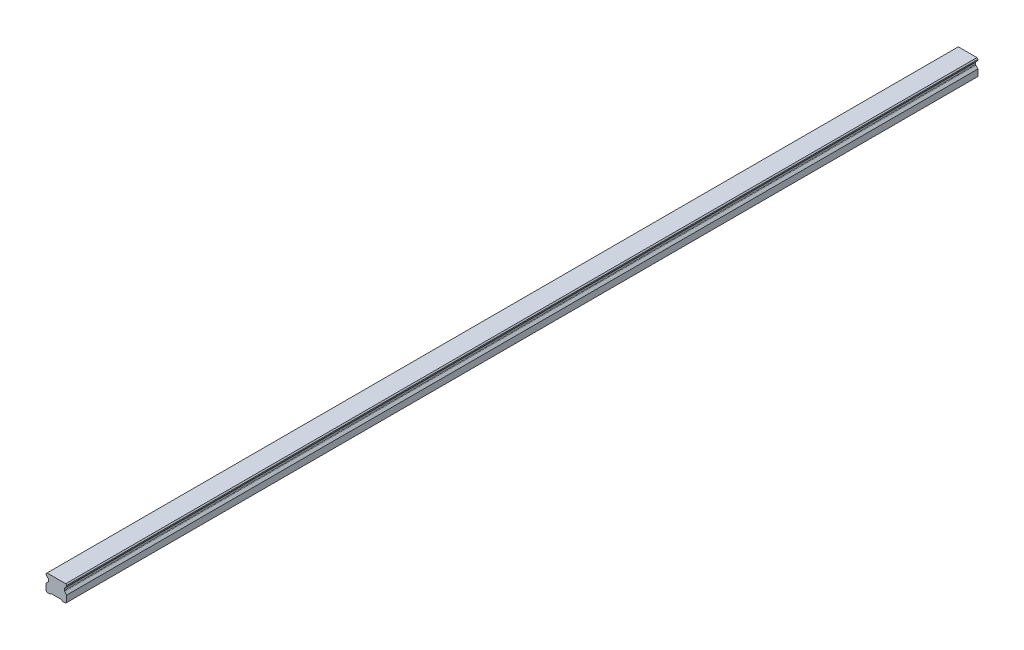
ISO-10303-21;
HEADER;
FILE_DESCRIPTION(('STEP AP214'),'2;1');
FILE_NAME('part.step','',(''),(''),'','','');
FILE_SCHEMA(('AUTOMOTIVE_DESIGN { 1 0 10303 214 1 1 1 1 }'));
ENDSEC;
DATA;
#1=APPLICATION_CONTEXT('core data for automotive mechanical design processes');
#2=APPLICATION_PROTOCOL_DEFINITION('international standard','automotive_design',2000,#1);
#3=PRODUCT_CONTEXT('',#1,'mechanical');
#4=PRODUCT('Part','Part','',(#3));
#5=PRODUCT_RELATED_PRODUCT_CATEGORY('part','',(#4));
#6=PRODUCT_DEFINITION_FORMATION('','',#4);
#7=PRODUCT_DEFINITION_CONTEXT('part definition',#1,'design');
#8=PRODUCT_DEFINITION('design','',#6,#7);
#9=PRODUCT_DEFINITION_SHAPE('','',#8);
#10=(LENGTH_UNIT() NAMED_UNIT(*) SI_UNIT(.MILLI.,.METRE.));
#11=(NAMED_UNIT(*) PLANE_ANGLE_UNIT() SI_UNIT($,.RADIAN.));
#12=(NAMED_UNIT(*) SI_UNIT($,.STERADIAN.) SOLID_ANGLE_UNIT());
#13=UNCERTAINTY_MEASURE_WITH_UNIT(LENGTH_MEASURE(1.E-05),#10,'distance_accuracy_value','');
#14=(GEOMETRIC_REPRESENTATION_CONTEXT(3) GLOBAL_UNCERTAINTY_ASSIGNED_CONTEXT((#13)) GLOBAL_UNIT_ASSIGNED_CONTEXT((#10,
#11,#12)) REPRESENTATION_CONTEXT('',''));
#15=CARTESIAN_POINT('',(0.,0.,0.));
#16=DIRECTION('',(0.,0.,1.));
#17=DIRECTION('',(1.,0.,0.));
#18=AXIS2_PLACEMENT_3D('',#15,#16,#17);
#19=CARTESIAN_POINT('',(0.,10.9999999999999,-420.));
#20=DIRECTION('',(0.,-1.,0.));
#21=DIRECTION('',(0.,0.,-1.));
#22=AXIS2_PLACEMENT_3D('',#19,#20,#21);
#23=PLANE('',#22);
#24=CARTESIAN_POINT('',(0.,10.9999999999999,-420.));
#25=DIRECTION('',(0.,-1.,0.));
#26=DIRECTION('',(0.,0.,-1.));
#27=AXIS2_PLACEMENT_3D('',#24,#25,#26);
#28=CIRCLE('',#27,2.5);
#29=CARTESIAN_POINT('',(0.,10.9999999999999,-422.5));
#30=VERTEX_POINT('',#29);
#31=EDGE_CURVE('E42',#30,#30,#28,.T.);
#32=ORIENTED_EDGE('',*,*,#31,.F.);
#33=EDGE_LOOP('',(#32));
#34=FACE_BOUND('',#33,.T.);
#35=CARTESIAN_POINT('',(0.,10.9999999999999,-420.));
#36=DIRECTION('',(0.,-1.,0.));
#37=DIRECTION('',(0.,0.,-1.));
#38=AXIS2_PLACEMENT_3D('',#35,#36,#37);
#39=CIRCLE('',#38,3.);
#40=CARTESIAN_POINT('',(0.,10.9999999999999,-423.));
#41=VERTEX_POINT('',#40);
#42=EDGE_CURVE('E11',#41,#41,#39,.T.);
#43=ORIENTED_EDGE('',*,*,#42,.T.);
#44=EDGE_LOOP('',(#43));
#45=FACE_BOUND('',#44,.T.);
#46=ADVANCED_FACE('F39',(#34,#45),#23,.T.);
#47=CARTESIAN_POINT('',(0.,10.9999999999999,-420.));
#48=DIRECTION('',(0.,-1.,0.));
#49=DIRECTION('',(0.,0.,-1.));
#50=AXIS2_PLACEMENT_3D('',#47,#48,#49);
#51=CYLINDRICAL_SURFACE('',#50,3.);
#52=ORIENTED_EDGE('',*,*,#42,.F.);
#53=EDGE_LOOP('',(#52));
#54=FACE_BOUND('',#53,.T.);
#55=CARTESIAN_POINT('',(0.,0.999999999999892,-420.));
#56=DIRECTION('',(0.,-1.,0.));
#57=DIRECTION('',(0.,0.,-1.));
#58=AXIS2_PLACEMENT_3D('',#55,#56,#57);
#59=CIRCLE('',#58,3.);
#60=CARTESIAN_POINT('',(0.,0.999999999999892,-423.));
#61=VERTEX_POINT('',#60);
#62=EDGE_CURVE('E48',#61,#61,#59,.T.);
#63=ORIENTED_EDGE('',*,*,#62,.T.);
#64=EDGE_LOOP('',(#63));
#65=FACE_BOUND('',#64,.T.);
#66=ADVANCED_FACE('F728',(#54,#65),#51,.F.);
#67=CARTESIAN_POINT('',(0.,10.9999999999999,-360.));
#68=DIRECTION('',(0.,-1.,0.));
#69=DIRECTION('',(0.,0.,-1.));
#70=AXIS2_PLACEMENT_3D('',#67,#68,#69);
#71=PLANE('',#70);
#72=CARTESIAN_POINT('',(0.,10.9999999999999,-360.));
#73=DIRECTION('',(0.,-1.,0.));
#74=DIRECTION('',(0.,0.,-1.));
#75=AXIS2_PLACEMENT_3D('',#72,#73,#74);
#76=CIRCLE('',#75,2.5);
#77=CARTESIAN_POINT('',(0.,10.9999999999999,-362.5));
#78=VERTEX_POINT('',#77);
#79=EDGE_CURVE('E714',#78,#78,#76,.T.);
#80=ORIENTED_EDGE('',*,*,#79,.F.);
#81=EDGE_LOOP('',(#80));
#82=FACE_BOUND('',#81,.T.);
#83=CARTESIAN_POINT('',(0.,10.9999999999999,-360.));
#84=DIRECTION('',(0.,-1.,0.));
#85=DIRECTION('',(0.,0.,-1.));
#86=AXIS2_PLACEMENT_3D('',#83,#84,#85);
#87=CIRCLE('',#86,3.);
#88=CARTESIAN_POINT('',(0.,10.9999999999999,-363.));
#89=VERTEX_POINT('',#88);
#90=EDGE_CURVE('E665',#89,#89,#87,.T.);
#91=ORIENTED_EDGE('',*,*,#90,.T.);
#92=EDGE_LOOP('',(#91));
#93=FACE_BOUND('',#92,.T.);
#94=ADVANCED_FACE('F733',(#82,#93),#71,.T.);
#95=CARTESIAN_POINT('',(0.,10.9999999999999,-360.));
#96=DIRECTION('',(0.,-1.,0.));
#97=DIRECTION('',(0.,0.,-1.));
#98=AXIS2_PLACEMENT_3D('',#95,#96,#97);
#99=CYLINDRICAL_SURFACE('',#98,3.);
#100=ORIENTED_EDGE('',*,*,#90,.F.);
#101=EDGE_LOOP('',(#100));
#102=FACE_BOUND('',#101,.T.);
#103=CARTESIAN_POINT('',(0.,0.999999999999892,-360.));
#104=DIRECTION('',(0.,-1.,0.));
#105=DIRECTION('',(0.,0.,-1.));
#106=AXIS2_PLACEMENT_3D('',#103,#104,#105);
#107=CIRCLE('',#106,3.);
#108=CARTESIAN_POINT('',(0.,0.999999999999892,-363.));
#109=VERTEX_POINT('',#108);
#110=EDGE_CURVE('E661',#109,#109,#107,.T.);
#111=ORIENTED_EDGE('',*,*,#110,.T.);
#112=EDGE_LOOP('',(#111));
#113=FACE_BOUND('',#112,.T.);
#114=ADVANCED_FACE('F924',(#102,#113),#99,.F.);
#115=CARTESIAN_POINT('',(0.,10.9999999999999,-300.));
#116=DIRECTION('',(0.,-1.,0.));
#117=DIRECTION('',(0.,0.,-1.));
#118=AXIS2_PLACEMENT_3D('',#115,#116,#117);
#119=PLANE('',#118);
#120=CARTESIAN_POINT('',(0.,10.9999999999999,-300.));
#121=DIRECTION('',(0.,-1.,0.));
#122=DIRECTION('',(0.,0.,-1.));
#123=AXIS2_PLACEMENT_3D('',#120,#121,#122);
#124=CIRCLE('',#123,2.5);
#125=CARTESIAN_POINT('',(0.,10.9999999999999,-302.5));
#126=VERTEX_POINT('',#125);
#127=EDGE_CURVE('E711',#126,#126,#124,.T.);
#128=ORIENTED_EDGE('',*,*,#127,.F.);
#129=EDGE_LOOP('',(#128));
#130=FACE_BOUND('',#129,.T.);
#131=CARTESIAN_POINT('',(0.,10.9999999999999,-300.));
#132=DIRECTION('',(0.,-1.,0.));
#133=DIRECTION('',(0.,0.,-1.));
#134=AXIS2_PLACEMENT_3D('',#131,#132,#133);
#135=CIRCLE('',#134,3.);
#136=CARTESIAN_POINT('',(0.,10.9999999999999,-303.));
#137=VERTEX_POINT('',#136);
#138=EDGE_CURVE('E657',#137,#137,#135,.T.);
#139=ORIENTED_EDGE('',*,*,#138,.T.);
#140=EDGE_LOOP('',(#139));
#141=FACE_BOUND('',#140,.T.);
#142=ADVANCED_FACE('F920',(#130,#141),#119,.T.);
#143=CARTESIAN_POINT('',(0.,10.9999999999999,-300.));
#144=DIRECTION('',(0.,-1.,0.));
#145=DIRECTION('',(0.,0.,-1.));
#146=AXIS2_PLACEMENT_3D('',#143,#144,#145);
#147=CYLINDRICAL_SURFACE('',#146,3.);
#148=ORIENTED_EDGE('',*,*,#138,.F.);
#149=EDGE_LOOP('',(#148));
#150=FACE_BOUND('',#149,.T.);
#151=CARTESIAN_POINT('',(0.,0.999999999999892,-300.));
#152=DIRECTION('',(0.,-1.,0.));
#153=DIRECTION('',(0.,0.,-1.));
#154=AXIS2_PLACEMENT_3D('',#151,#152,#153);
#155=CIRCLE('',#154,3.);
#156=CARTESIAN_POINT('',(0.,0.999999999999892,-303.));
#157=VERTEX_POINT('',#156);
#158=EDGE_CURVE('E653',#157,#157,#155,.T.);
#159=ORIENTED_EDGE('',*,*,#158,.T.);
#160=EDGE_LOOP('',(#159));
#161=FACE_BOUND('',#160,.T.);
#162=ADVANCED_FACE('F916',(#150,#161),#147,.F.);
#163=CARTESIAN_POINT('',(0.,10.9999999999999,-240.));
#164=DIRECTION('',(0.,-1.,0.));
#165=DIRECTION('',(0.,0.,-1.));
#166=AXIS2_PLACEMENT_3D('',#163,#164,#165);
#167=PLANE('',#166);
#168=CARTESIAN_POINT('',(0.,10.9999999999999,-240.));
#169=DIRECTION('',(0.,-1.,0.));
#170=DIRECTION('',(0.,0.,-1.));
#171=AXIS2_PLACEMENT_3D('',#168,#169,#170);
#172=CIRCLE('',#171,2.5);
#173=CARTESIAN_POINT('',(0.,10.9999999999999,-242.5));
#174=VERTEX_POINT('',#173);
#175=EDGE_CURVE('E707',#174,#174,#172,.T.);
#176=ORIENTED_EDGE('',*,*,#175,.F.);
#177=EDGE_LOOP('',(#176));
#178=FACE_BOUND('',#177,.T.);
#179=CARTESIAN_POINT('',(0.,10.9999999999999,-240.));
#180=DIRECTION('',(0.,-1.,0.));
#181=DIRECTION('',(0.,0.,-1.));
#182=AXIS2_PLACEMENT_3D('',#179,#180,#181);
#183=CIRCLE('',#182,3.);
#184=CARTESIAN_POINT('',(0.,10.9999999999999,-243.));
#185=VERTEX_POINT('',#184);
#186=EDGE_CURVE('E649',#185,#185,#183,.T.);
#187=ORIENTED_EDGE('',*,*,#186,.T.);
#188=EDGE_LOOP('',(#187));
#189=FACE_BOUND('',#188,.T.);
#190=ADVANCED_FACE('F912',(#178,#189),#167,.T.);
#191=CARTESIAN_POINT('',(0.,10.9999999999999,-240.));
#192=DIRECTION('',(0.,-1.,0.));
#193=DIRECTION('',(0.,0.,-1.));
#194=AXIS2_PLACEMENT_3D('',#191,#192,#193);
#195=CYLINDRICAL_SURFACE('',#194,3.);
#196=ORIENTED_EDGE('',*,*,#186,.F.);
#197=EDGE_LOOP('',(#196));
#198=FACE_BOUND('',#197,.T.);
#199=CARTESIAN_POINT('',(0.,0.999999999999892,-240.));
#200=DIRECTION('',(0.,-1.,0.));
#201=DIRECTION('',(0.,0.,-1.));
#202=AXIS2_PLACEMENT_3D('',#199,#200,#201);
#203=CIRCLE('',#202,3.);
#204=CARTESIAN_POINT('',(0.,0.999999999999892,-243.));
#205=VERTEX_POINT('',#204);
#206=EDGE_CURVE('E646',#205,#205,#203,.T.);
#207=ORIENTED_EDGE('',*,*,#206,.T.);
#208=EDGE_LOOP('',(#207));
#209=FACE_BOUND('',#208,.T.);
#210=ADVANCED_FACE('F908',(#198,#209),#195,.F.);
#211=CARTESIAN_POINT('',(0.,10.9999999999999,-180.));
#212=DIRECTION('',(0.,-1.,0.));
#213=DIRECTION('',(0.,0.,-1.));
#214=AXIS2_PLACEMENT_3D('',#211,#212,#213);
#215=PLANE('',#214);
#216=CARTESIAN_POINT('',(0.,10.9999999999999,-180.));
#217=DIRECTION('',(0.,-1.,0.));
#218=DIRECTION('',(0.,0.,-1.));
#219=AXIS2_PLACEMENT_3D('',#216,#217,#218);
#220=CIRCLE('',#219,2.5);
#221=CARTESIAN_POINT('',(0.,10.9999999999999,-182.5));
#222=VERTEX_POINT('',#221);
#223=EDGE_CURVE('E703',#222,#222,#220,.T.);
#224=ORIENTED_EDGE('',*,*,#223,.F.);
#225=EDGE_LOOP('',(#224));
#226=FACE_BOUND('',#225,.T.);
#227=CARTESIAN_POINT('',(0.,10.9999999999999,-180.));
#228=DIRECTION('',(0.,-1.,0.));
#229=DIRECTION('',(0.,0.,-1.));
#230=AXIS2_PLACEMENT_3D('',#227,#228,#229);
#231=CIRCLE('',#230,3.);
#232=CARTESIAN_POINT('',(0.,10.9999999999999,-183.));
#233=VERTEX_POINT('',#232);
#234=EDGE_CURVE('E642',#233,#233,#231,.T.);
#235=ORIENTED_EDGE('',*,*,#234,.T.);
#236=EDGE_LOOP('',(#235));
#237=FACE_BOUND('',#236,.T.);
#238=ADVANCED_FACE('F904',(#226,#237),#215,.T.);
#239=CARTESIAN_POINT('',(0.,10.9999999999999,-180.));
#240=DIRECTION('',(0.,-1.,0.));
#241=DIRECTION('',(0.,0.,-1.));
#242=AXIS2_PLACEMENT_3D('',#239,#240,#241);
#243=CYLINDRICAL_SURFACE('',#242,3.);
#244=ORIENTED_EDGE('',*,*,#234,.F.);
#245=EDGE_LOOP('',(#244));
#246=FACE_BOUND('',#245,.T.);
#247=CARTESIAN_POINT('',(0.,0.999999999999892,-180.));
#248=DIRECTION('',(0.,-1.,0.));
#249=DIRECTION('',(0.,0.,-1.));
#250=AXIS2_PLACEMENT_3D('',#247,#248,#249);
#251=CIRCLE('',#250,3.);
#252=CARTESIAN_POINT('',(0.,0.999999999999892,-183.));
#253=VERTEX_POINT('',#252);
#254=EDGE_CURVE('E638',#253,#253,#251,.T.);
#255=ORIENTED_EDGE('',*,*,#254,.T.);
#256=EDGE_LOOP('',(#255));
#257=FACE_BOUND('',#256,.T.);
#258=ADVANCED_FACE('F900',(#246,#257),#243,.F.);
#259=CARTESIAN_POINT('',(0.,10.9999999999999,-120.));
#260=DIRECTION('',(0.,-1.,0.));
#261=DIRECTION('',(0.,0.,-1.));
#262=AXIS2_PLACEMENT_3D('',#259,#260,#261);
#263=PLANE('',#262);
#264=CARTESIAN_POINT('',(0.,10.9999999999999,-120.));
#265=DIRECTION('',(0.,-1.,0.));
#266=DIRECTION('',(0.,0.,-1.));
#267=AXIS2_PLACEMENT_3D('',#264,#265,#266);
#268=CIRCLE('',#267,2.5);
#269=CARTESIAN_POINT('',(0.,10.9999999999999,-122.5));
#270=VERTEX_POINT('',#269);
#271=EDGE_CURVE('E699',#270,#270,#268,.T.);
#272=ORIENTED_EDGE('',*,*,#271,.F.);
#273=EDGE_LOOP('',(#272));
#274=FACE_BOUND('',#273,.T.);
#275=CARTESIAN_POINT('',(0.,10.9999999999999,-120.));
#276=DIRECTION('',(0.,-1.,0.));
#277=DIRECTION('',(0.,0.,-1.));
#278=AXIS2_PLACEMENT_3D('',#275,#276,#277);
#279=CIRCLE('',#278,3.);
#280=CARTESIAN_POINT('',(0.,10.9999999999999,-123.));
#281=VERTEX_POINT('',#280);
#282=EDGE_CURVE('E634',#281,#281,#279,.T.);
#283=ORIENTED_EDGE('',*,*,#282,.T.);
#284=EDGE_LOOP('',(#283));
#285=FACE_BOUND('',#284,.T.);
#286=ADVANCED_FACE('F896',(#274,#285),#263,.T.);
#287=CARTESIAN_POINT('',(0.,10.9999999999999,-120.));
#288=DIRECTION('',(0.,-1.,0.));
#289=DIRECTION('',(0.,0.,-1.));
#290=AXIS2_PLACEMENT_3D('',#287,#288,#289);
#291=CYLINDRICAL_SURFACE('',#290,3.);
#292=ORIENTED_EDGE('',*,*,#282,.F.);
#293=EDGE_LOOP('',(#292));
#294=FACE_BOUND('',#293,.T.);
#295=CARTESIAN_POINT('',(0.,0.999999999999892,-120.));
#296=DIRECTION('',(0.,-1.,0.));
#297=DIRECTION('',(0.,0.,-1.));
#298=AXIS2_PLACEMENT_3D('',#295,#296,#297);
#299=CIRCLE('',#298,3.);
#300=CARTESIAN_POINT('',(0.,0.999999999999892,-123.));
#301=VERTEX_POINT('',#300);
#302=EDGE_CURVE('E630',#301,#301,#299,.T.);
#303=ORIENTED_EDGE('',*,*,#302,.T.);
#304=EDGE_LOOP('',(#303));
#305=FACE_BOUND('',#304,.T.);
#306=ADVANCED_FACE('F892',(#294,#305),#291,.F.);
#307=CARTESIAN_POINT('',(0.,10.9999999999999,-60.));
#308=DIRECTION('',(0.,-1.,0.));
#309=DIRECTION('',(0.,0.,-1.));
#310=AXIS2_PLACEMENT_3D('',#307,#308,#309);
#311=PLANE('',#310);
#312=CARTESIAN_POINT('',(0.,10.9999999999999,-60.));
#313=DIRECTION('',(0.,-1.,0.));
#314=DIRECTION('',(0.,0.,-1.));
#315=AXIS2_PLACEMENT_3D('',#312,#313,#314);
#316=CIRCLE('',#315,2.5);
#317=CARTESIAN_POINT('',(0.,10.9999999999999,-62.5));
#318=VERTEX_POINT('',#317);
#319=EDGE_CURVE('E695',#318,#318,#316,.T.);
#320=ORIENTED_EDGE('',*,*,#319,.F.);
#321=EDGE_LOOP('',(#320));
#322=FACE_BOUND('',#321,.T.);
#323=CARTESIAN_POINT('',(0.,10.9999999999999,-60.));
#324=DIRECTION('',(0.,-1.,0.));
#325=DIRECTION('',(0.,0.,-1.));
#326=AXIS2_PLACEMENT_3D('',#323,#324,#325);
#327=CIRCLE('',#326,3.);
#328=CARTESIAN_POINT('',(0.,10.9999999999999,-63.));
#329=VERTEX_POINT('',#328);
#330=EDGE_CURVE('E626',#329,#329,#327,.T.);
#331=ORIENTED_EDGE('',*,*,#330,.T.);
#332=EDGE_LOOP('',(#331));
#333=FACE_BOUND('',#332,.T.);
#334=ADVANCED_FACE('F888',(#322,#333),#311,.T.);
#335=CARTESIAN_POINT('',(0.,10.9999999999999,-60.));
#336=DIRECTION('',(0.,-1.,0.));
#337=DIRECTION('',(0.,0.,-1.));
#338=AXIS2_PLACEMENT_3D('',#335,#336,#337);
#339=CYLINDRICAL_SURFACE('',#338,3.);
#340=ORIENTED_EDGE('',*,*,#330,.F.);
#341=EDGE_LOOP('',(#340));
#342=FACE_BOUND('',#341,.T.);
#343=CARTESIAN_POINT('',(0.,0.999999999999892,-60.));
#344=DIRECTION('',(0.,-1.,0.));
#345=DIRECTION('',(0.,0.,-1.));
#346=AXIS2_PLACEMENT_3D('',#343,#344,#345);
#347=CIRCLE('',#346,3.);
#348=CARTESIAN_POINT('',(0.,0.999999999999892,-63.));
#349=VERTEX_POINT('',#348);
#350=EDGE_CURVE('E622',#349,#349,#347,.T.);
#351=ORIENTED_EDGE('',*,*,#350,.T.);
#352=EDGE_LOOP('',(#351));
#353=FACE_BOUND('',#352,.T.);
#354=ADVANCED_FACE('F884',(#342,#353),#339,.F.);
#355=CARTESIAN_POINT('',(0.,10.9999999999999,0.));
#356=DIRECTION('',(0.,-1.,0.));
#357=DIRECTION('',(0.,0.,-1.));
#358=AXIS2_PLACEMENT_3D('',#355,#356,#357);
#359=PLANE('',#358);
#360=CARTESIAN_POINT('',(0.,10.9999999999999,0.));
#361=DIRECTION('',(0.,-1.,0.));
#362=DIRECTION('',(0.,0.,-1.));
#363=AXIS2_PLACEMENT_3D('',#360,#361,#362);
#364=CIRCLE('',#363,2.5);
#365=CARTESIAN_POINT('',(0.,10.9999999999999,-2.5));
#366=VERTEX_POINT('',#365);
#367=EDGE_CURVE('E691',#366,#366,#364,.T.);
#368=ORIENTED_EDGE('',*,*,#367,.F.);
#369=EDGE_LOOP('',(#368));
#370=FACE_BOUND('',#369,.T.);
#371=CARTESIAN_POINT('',(0.,10.9999999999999,0.));
#372=DIRECTION('',(0.,-1.,0.));
#373=DIRECTION('',(0.,0.,-1.));
#374=AXIS2_PLACEMENT_3D('',#371,#372,#373);
#375=CIRCLE('',#374,3.);
#376=CARTESIAN_POINT('',(0.,10.9999999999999,-3.));
#377=VERTEX_POINT('',#376);
#378=EDGE_CURVE('E618',#377,#377,#375,.T.);
#379=ORIENTED_EDGE('',*,*,#378,.T.);
#380=EDGE_LOOP('',(#379));
#381=FACE_BOUND('',#380,.T.);
#382=ADVANCED_FACE('F880',(#370,#381),#359,.T.);
#383=CARTESIAN_POINT('',(0.,10.9999999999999,0.));
#384=DIRECTION('',(0.,-1.,0.));
#385=DIRECTION('',(0.,0.,-1.));
#386=AXIS2_PLACEMENT_3D('',#383,#384,#385);
#387=CYLINDRICAL_SURFACE('',#386,3.);
#388=ORIENTED_EDGE('',*,*,#378,.F.);
#389=EDGE_LOOP('',(#388));
#390=FACE_BOUND('',#389,.T.);
#391=CARTESIAN_POINT('',(0.,0.999999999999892,0.));
#392=DIRECTION('',(0.,-1.,0.));
#393=DIRECTION('',(0.,0.,-1.));
#394=AXIS2_PLACEMENT_3D('',#391,#392,#393);
#395=CIRCLE('',#394,3.);
#396=CARTESIAN_POINT('',(0.,0.999999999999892,-3.));
#397=VERTEX_POINT('',#396);
#398=EDGE_CURVE('E614',#397,#397,#395,.T.);
#399=ORIENTED_EDGE('',*,*,#398,.T.);
#400=EDGE_LOOP('',(#399));
#401=FACE_BOUND('',#400,.T.);
#402=ADVANCED_FACE('F876',(#390,#401),#387,.F.);
#403=CARTESIAN_POINT('',(0.,10.9999999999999,60.));
#404=DIRECTION('',(0.,-1.,0.));
#405=DIRECTION('',(0.,0.,-1.));
#406=AXIS2_PLACEMENT_3D('',#403,#404,#405);
#407=PLANE('',#406);
#408=CARTESIAN_POINT('',(0.,10.9999999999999,60.));
#409=DIRECTION('',(0.,-1.,0.));
#410=DIRECTION('',(0.,0.,-1.));
#411=AXIS2_PLACEMENT_3D('',#408,#409,#410);
#412=CIRCLE('',#411,2.5);
#413=CARTESIAN_POINT('',(0.,10.9999999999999,57.5));
#414=VERTEX_POINT('',#413);
#415=EDGE_CURVE('E687',#414,#414,#412,.T.);
#416=ORIENTED_EDGE('',*,*,#415,.F.);
#417=EDGE_LOOP('',(#416));
#418=FACE_BOUND('',#417,.T.);
#419=CARTESIAN_POINT('',(0.,10.9999999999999,60.));
#420=DIRECTION('',(0.,-1.,0.));
#421=DIRECTION('',(0.,0.,-1.));
#422=AXIS2_PLACEMENT_3D('',#419,#420,#421);
#423=CIRCLE('',#422,3.);
#424=CARTESIAN_POINT('',(0.,10.9999999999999,57.));
#425=VERTEX_POINT('',#424);
#426=EDGE_CURVE('E610',#425,#425,#423,.T.);
#427=ORIENTED_EDGE('',*,*,#426,.T.);
#428=EDGE_LOOP('',(#427));
#429=FACE_BOUND('',#428,.T.);
#430=ADVANCED_FACE('F872',(#418,#429),#407,.T.);
#431=CARTESIAN_POINT('',(0.,10.9999999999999,60.));
#432=DIRECTION('',(0.,-1.,0.));
#433=DIRECTION('',(0.,0.,-1.));
#434=AXIS2_PLACEMENT_3D('',#431,#432,#433);
#435=CYLINDRICAL_SURFACE('',#434,3.);
#436=ORIENTED_EDGE('',*,*,#426,.F.);
#437=EDGE_LOOP('',(#436));
#438=FACE_BOUND('',#437,.T.);
#439=CARTESIAN_POINT('',(0.,0.999999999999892,60.));
#440=DIRECTION('',(0.,-1.,0.));
#441=DIRECTION('',(0.,0.,-1.));
#442=AXIS2_PLACEMENT_3D('',#439,#440,#441);
#443=CIRCLE('',#442,3.);
#444=CARTESIAN_POINT('',(0.,0.999999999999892,57.));
#445=VERTEX_POINT('',#444);
#446=EDGE_CURVE('E606',#445,#445,#443,.T.);
#447=ORIENTED_EDGE('',*,*,#446,.T.);
#448=EDGE_LOOP('',(#447));
#449=FACE_BOUND('',#448,.T.);
#450=ADVANCED_FACE('F868',(#438,#449),#435,.F.);
#451=CARTESIAN_POINT('',(0.,10.9999999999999,120.));
#452=DIRECTION('',(0.,-1.,0.));
#453=DIRECTION('',(0.,0.,-1.));
#454=AXIS2_PLACEMENT_3D('',#451,#452,#453);
#455=PLANE('',#454);
#456=CARTESIAN_POINT('',(0.,10.9999999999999,120.));
#457=DIRECTION('',(0.,-1.,0.));
#458=DIRECTION('',(0.,0.,-1.));
#459=AXIS2_PLACEMENT_3D('',#456,#457,#458);
#460=CIRCLE('',#459,2.5);
#461=CARTESIAN_POINT('',(0.,10.9999999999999,117.5));
#462=VERTEX_POINT('',#461);
#463=EDGE_CURVE('E683',#462,#462,#460,.T.);
#464=ORIENTED_EDGE('',*,*,#463,.F.);
#465=EDGE_LOOP('',(#464));
#466=FACE_BOUND('',#465,.T.);
#467=CARTESIAN_POINT('',(0.,10.9999999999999,120.));
#468=DIRECTION('',(0.,-1.,0.));
#469=DIRECTION('',(0.,0.,-1.));
#470=AXIS2_PLACEMENT_3D('',#467,#468,#469);
#471=CIRCLE('',#470,3.);
#472=CARTESIAN_POINT('',(0.,10.9999999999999,117.));
#473=VERTEX_POINT('',#472);
#474=EDGE_CURVE('E602',#473,#473,#471,.T.);
#475=ORIENTED_EDGE('',*,*,#474,.T.);
#476=EDGE_LOOP('',(#475));
#477=FACE_BOUND('',#476,.T.);
#478=ADVANCED_FACE('F864',(#466,#477),#455,.T.);
#479=CARTESIAN_POINT('',(0.,10.9999999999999,120.));
#480=DIRECTION('',(0.,-1.,0.));
#481=DIRECTION('',(0.,0.,-1.));
#482=AXIS2_PLACEMENT_3D('',#479,#480,#481);
#483=CYLINDRICAL_SURFACE('',#482,3.);
#484=ORIENTED_EDGE('',*,*,#474,.F.);
#485=EDGE_LOOP('',(#484));
#486=FACE_BOUND('',#485,.T.);
#487=CARTESIAN_POINT('',(0.,0.999999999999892,120.));
#488=DIRECTION('',(0.,-1.,0.));
#489=DIRECTION('',(0.,0.,-1.));
#490=AXIS2_PLACEMENT_3D('',#487,#488,#489);
#491=CIRCLE('',#490,3.);
#492=CARTESIAN_POINT('',(0.,0.999999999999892,117.));
#493=VERTEX_POINT('',#492);
#494=EDGE_CURVE('E598',#493,#493,#491,.T.);
#495=ORIENTED_EDGE('',*,*,#494,.T.);
#496=EDGE_LOOP('',(#495));
#497=FACE_BOUND('',#496,.T.);
#498=ADVANCED_FACE('F860',(#486,#497),#483,.F.);
#499=CARTESIAN_POINT('',(0.,10.9999999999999,180.));
#500=DIRECTION('',(0.,-1.,0.));
#501=DIRECTION('',(0.,0.,-1.));
#502=AXIS2_PLACEMENT_3D('',#499,#500,#501);
#503=PLANE('',#502);
#504=CARTESIAN_POINT('',(0.,10.9999999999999,180.));
#505=DIRECTION('',(0.,-1.,0.));
#506=DIRECTION('',(0.,0.,-1.));
#507=AXIS2_PLACEMENT_3D('',#504,#505,#506);
#508=CIRCLE('',#507,2.5);
#509=CARTESIAN_POINT('',(0.,10.9999999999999,177.5));
#510=VERTEX_POINT('',#509);
#511=EDGE_CURVE('E679',#510,#510,#508,.T.);
#512=ORIENTED_EDGE('',*,*,#511,.F.);
#513=EDGE_LOOP('',(#512));
#514=FACE_BOUND('',#513,.T.);
#515=CARTESIAN_POINT('',(0.,10.9999999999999,180.));
#516=DIRECTION('',(0.,-1.,0.));
#517=DIRECTION('',(0.,0.,-1.));
#518=AXIS2_PLACEMENT_3D('',#515,#516,#517);
#519=CIRCLE('',#518,3.);
#520=CARTESIAN_POINT('',(0.,10.9999999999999,177.));
#521=VERTEX_POINT('',#520);
#522=EDGE_CURVE('E594',#521,#521,#519,.T.);
#523=ORIENTED_EDGE('',*,*,#522,.T.);
#524=EDGE_LOOP('',(#523));
#525=FACE_BOUND('',#524,.T.);
#526=ADVANCED_FACE('F856',(#514,#525),#503,.T.);
#527=CARTESIAN_POINT('',(0.,10.9999999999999,180.));
#528=DIRECTION('',(0.,-1.,0.));
#529=DIRECTION('',(0.,0.,-1.));
#530=AXIS2_PLACEMENT_3D('',#527,#528,#529);
#531=CYLINDRICAL_SURFACE('',#530,3.);
#532=ORIENTED_EDGE('',*,*,#522,.F.);
#533=EDGE_LOOP('',(#532));
#534=FACE_BOUND('',#533,.T.);
#535=CARTESIAN_POINT('',(0.,0.999999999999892,180.));
#536=DIRECTION('',(0.,-1.,0.));
#537=DIRECTION('',(0.,0.,-1.));
#538=AXIS2_PLACEMENT_3D('',#535,#536,#537);
#539=CIRCLE('',#538,3.);
#540=CARTESIAN_POINT('',(0.,0.999999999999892,177.));
#541=VERTEX_POINT('',#540);
#542=EDGE_CURVE('E590',#541,#541,#539,.T.);
#543=ORIENTED_EDGE('',*,*,#542,.T.);
#544=EDGE_LOOP('',(#543));
#545=FACE_BOUND('',#544,.T.);
#546=ADVANCED_FACE('F852',(#534,#545),#531,.F.);
#547=CARTESIAN_POINT('',(0.,10.9999999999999,240.));
#548=DIRECTION('',(0.,-1.,0.));
#549=DIRECTION('',(0.,0.,-1.));
#550=AXIS2_PLACEMENT_3D('',#547,#548,#549);
#551=PLANE('',#550);
#552=CARTESIAN_POINT('',(0.,10.9999999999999,240.));
#553=DIRECTION('',(0.,-1.,0.));
#554=DIRECTION('',(0.,0.,-1.));
#555=AXIS2_PLACEMENT_3D('',#552,#553,#554);
#556=CIRCLE('',#555,2.5);
#557=CARTESIAN_POINT('',(0.,10.9999999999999,237.5));
#558=VERTEX_POINT('',#557);
#559=EDGE_CURVE('E675',#558,#558,#556,.T.);
#560=ORIENTED_EDGE('',*,*,#559,.F.);
#561=EDGE_LOOP('',(#560));
#562=FACE_BOUND('',#561,.T.);
#563=CARTESIAN_POINT('',(0.,10.9999999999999,240.));
#564=DIRECTION('',(0.,-1.,0.));
#565=DIRECTION('',(0.,0.,-1.));
#566=AXIS2_PLACEMENT_3D('',#563,#564,#565);
#567=CIRCLE('',#566,3.);
#568=CARTESIAN_POINT('',(0.,10.9999999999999,237.));
#569=VERTEX_POINT('',#568);
#570=EDGE_CURVE('E586',#569,#569,#567,.T.);
#571=ORIENTED_EDGE('',*,*,#570,.T.);
#572=EDGE_LOOP('',(#571));
#573=FACE_BOUND('',#572,.T.);
#574=ADVANCED_FACE('F848',(#562,#573),#551,.T.);
#575=CARTESIAN_POINT('',(0.,10.9999999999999,240.));
#576=DIRECTION('',(0.,-1.,0.));
#577=DIRECTION('',(0.,0.,-1.));
#578=AXIS2_PLACEMENT_3D('',#575,#576,#577);
#579=CYLINDRICAL_SURFACE('',#578,3.);
#580=ORIENTED_EDGE('',*,*,#570,.F.);
#581=EDGE_LOOP('',(#580));
#582=FACE_BOUND('',#581,.T.);
#583=CARTESIAN_POINT('',(0.,0.999999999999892,240.));
#584=DIRECTION('',(0.,-1.,0.));
#585=DIRECTION('',(0.,0.,-1.));
#586=AXIS2_PLACEMENT_3D('',#583,#584,#585);
#587=CIRCLE('',#586,3.);
#588=CARTESIAN_POINT('',(0.,0.999999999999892,237.));
#589=VERTEX_POINT('',#588);
#590=EDGE_CURVE('E582',#589,#589,#587,.T.);
#591=ORIENTED_EDGE('',*,*,#590,.T.);
#592=EDGE_LOOP('',(#591));
#593=FACE_BOUND('',#592,.T.);
#594=ADVANCED_FACE('F844',(#582,#593),#579,.F.);
#595=CARTESIAN_POINT('',(0.,10.9999999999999,300.));
#596=DIRECTION('',(0.,-1.,0.));
#597=DIRECTION('',(0.,0.,-1.));
#598=AXIS2_PLACEMENT_3D('',#595,#596,#597);
#599=PLANE('',#598);
#600=CARTESIAN_POINT('',(0.,10.9999999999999,300.));
#601=DIRECTION('',(0.,-1.,0.));
#602=DIRECTION('',(0.,0.,-1.));
#603=AXIS2_PLACEMENT_3D('',#600,#601,#602);
#604=CIRCLE('',#603,2.5);
#605=CARTESIAN_POINT('',(0.,10.9999999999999,297.5));
#606=VERTEX_POINT('',#605);
#607=EDGE_CURVE('E263',#606,#606,#604,.T.);
#608=ORIENTED_EDGE('',*,*,#607,.F.);
#609=EDGE_LOOP('',(#608));
#610=FACE_BOUND('',#609,.T.);
#611=CARTESIAN_POINT('',(0.,10.9999999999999,300.));
#612=DIRECTION('',(0.,-1.,0.));
#613=DIRECTION('',(0.,0.,-1.));
#614=AXIS2_PLACEMENT_3D('',#611,#612,#613);
#615=CIRCLE('',#614,3.);
#616=CARTESIAN_POINT('',(0.,10.9999999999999,297.));
#617=VERTEX_POINT('',#616);
#618=EDGE_CURVE('E578',#617,#617,#615,.T.);
#619=ORIENTED_EDGE('',*,*,#618,.T.);
#620=EDGE_LOOP('',(#619));
#621=FACE_BOUND('',#620,.T.);
#622=ADVANCED_FACE('F840',(#610,#621),#599,.T.);
#623=CARTESIAN_POINT('',(0.,10.9999999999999,300.));
#624=DIRECTION('',(0.,-1.,0.));
#625=DIRECTION('',(0.,0.,-1.));
#626=AXIS2_PLACEMENT_3D('',#623,#624,#625);
#627=CYLINDRICAL_SURFACE('',#626,3.);
#628=ORIENTED_EDGE('',*,*,#618,.F.);
#629=EDGE_LOOP('',(#628));
#630=FACE_BOUND('',#629,.T.);
#631=CARTESIAN_POINT('',(0.,0.999999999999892,300.));
#632=DIRECTION('',(0.,-1.,0.));
#633=DIRECTION('',(0.,0.,-1.));
#634=AXIS2_PLACEMENT_3D('',#631,#632,#633);
#635=CIRCLE('',#634,3.);
#636=CARTESIAN_POINT('',(0.,0.999999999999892,297.));
#637=VERTEX_POINT('',#636);
#638=EDGE_CURVE('E574',#637,#637,#635,.T.);
#639=ORIENTED_EDGE('',*,*,#638,.T.);
#640=EDGE_LOOP('',(#639));
#641=FACE_BOUND('',#640,.T.);
#642=ADVANCED_FACE('F837',(#630,#641),#627,.F.);
#643=CARTESIAN_POINT('',(10.,0.,440.));
#644=DIRECTION('',(0.,1.,0.));
#645=DIRECTION('',(-1.,0.,0.));
#646=AXIS2_PLACEMENT_3D('',#643,#644,#645);
#647=PLANE('',#646);
#648=DIRECTION('',(1.,0.,0.));
#649=VECTOR('',#648,1.);
#650=CARTESIAN_POINT('',(10.,0.,-440.));
#651=LINE('',#650,#649);
#652=CARTESIAN_POINT('',(-9.,0.,-440.));
#653=VERTEX_POINT('',#652);
#654=CARTESIAN_POINT('',(-5.99999999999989,0.,-440.));
#655=VERTEX_POINT('',#654);
#656=EDGE_CURVE('E457',#653,#655,#651,.T.);
#657=ORIENTED_EDGE('',*,*,#656,.T.);
#658=DIRECTION('',(0.,0.,1.));
#659=VECTOR('',#658,1.);
#660=CARTESIAN_POINT('',(-5.99999999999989,0.,-440.));
#661=LINE('',#660,#659);
#662=CARTESIAN_POINT('',(-5.99999999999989,0.,440.));
#663=VERTEX_POINT('',#662);
#664=EDGE_CURVE('E362',#655,#663,#661,.T.);
#665=ORIENTED_EDGE('',*,*,#664,.T.);
#666=DIRECTION('',(1.,0.,0.));
#667=VECTOR('',#666,1.);
#668=CARTESIAN_POINT('',(10.,0.,440.));
#669=LINE('',#668,#667);
#670=CARTESIAN_POINT('',(-9.,0.,440.));
#671=VERTEX_POINT('',#670);
#672=EDGE_CURVE('E438',#671,#663,#669,.T.);
#673=ORIENTED_EDGE('',*,*,#672,.F.);
#674=DIRECTION('',(0.,0.,-1.));
#675=VECTOR('',#674,1.);
#676=CARTESIAN_POINT('',(-9.,0.,440.));
#677=LINE('',#676,#675);
#678=EDGE_CURVE('E509',#671,#653,#677,.T.);
#679=ORIENTED_EDGE('',*,*,#678,.T.);
#680=EDGE_LOOP('',(#657,#665,#673,#679));
#681=FACE_BOUND('',#680,.T.);
#682=ADVANCED_FACE('F802',(#681),#647,.F.);
#683=CARTESIAN_POINT('',(-10.,16.3,440.));
#684=DIRECTION('',(1.,0.,0.));
#685=DIRECTION('',(0.,1.,0.));
#686=AXIS2_PLACEMENT_3D('',#683,#684,#685);
#687=PLANE('',#686);
#688=DIRECTION('',(0.,-1.,0.));
#689=VECTOR('',#688,1.);
#690=CARTESIAN_POINT('',(-10.,16.3,440.));
#691=LINE('',#690,#689);
#692=CARTESIAN_POINT('',(-10.,15.3,440.));
#693=VERTEX_POINT('',#692);
#694=CARTESIAN_POINT('',(-10.,14.3,440.));
#695=VERTEX_POINT('',#694);
#696=EDGE_CURVE('E432',#693,#695,#691,.T.);
#697=ORIENTED_EDGE('',*,*,#696,.F.);
#698=DIRECTION('',(0.,0.,-1.));
#699=VECTOR('',#698,1.);
#700=CARTESIAN_POINT('',(-10.,15.3,440.));
#701=LINE('',#700,#699);
#702=CARTESIAN_POINT('',(-10.,15.3,-440.));
#703=VERTEX_POINT('',#702);
#704=EDGE_CURVE('E451',#693,#703,#701,.T.);
#705=ORIENTED_EDGE('',*,*,#704,.T.);
#706=DIRECTION('',(0.,-1.,0.));
#707=VECTOR('',#706,1.);
#708=CARTESIAN_POINT('',(-10.,16.3,-440.));
#709=LINE('',#708,#707);
#710=CARTESIAN_POINT('',(-10.,14.3,-440.));
#711=VERTEX_POINT('',#710);
#712=EDGE_CURVE('E452',#703,#711,#709,.T.);
#713=ORIENTED_EDGE('',*,*,#712,.T.);
#714=DIRECTION('',(0.,0.,1.));
#715=VECTOR('',#714,1.);
#716=CARTESIAN_POINT('',(-10.,14.3,-440.));
#717=LINE('',#716,#715);
#718=EDGE_CURVE('E386',#711,#695,#717,.T.);
#719=ORIENTED_EDGE('',*,*,#718,.T.);
#720=EDGE_LOOP('',(#697,#705,#713,#719));
#721=FACE_BOUND('',#720,.T.);
#722=ADVANCED_FACE('F806',(#721),#687,.F.);
#723=CARTESIAN_POINT('',(10.,16.3,440.));
#724=DIRECTION('',(-1.,0.,0.));
#725=DIRECTION('',(0.,-1.,0.));
#726=AXIS2_PLACEMENT_3D('',#723,#724,#725);
#727=PLANE('',#726);
#728=DIRECTION('',(0.,1.,0.));
#729=VECTOR('',#728,1.);
#730=CARTESIAN_POINT('',(10.,16.3,440.));
#731=LINE('',#730,#729);
#732=CARTESIAN_POINT('',(10.,0.999999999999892,440.));
#733=VERTEX_POINT('',#732);
#734=CARTESIAN_POINT('',(10.,7.3,440.));
#735=VERTEX_POINT('',#734);
#736=EDGE_CURVE('E443',#733,#735,#731,.T.);
#737=ORIENTED_EDGE('',*,*,#736,.F.);
#738=DIRECTION('',(0.,0.,-1.));
#739=VECTOR('',#738,1.);
#740=CARTESIAN_POINT('',(10.,0.999999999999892,440.));
#741=LINE('',#740,#739);
#742=CARTESIAN_POINT('',(10.,0.999999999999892,-440.));
#743=VERTEX_POINT('',#742);
#744=EDGE_CURVE('E516',#733,#743,#741,.T.);
#745=ORIENTED_EDGE('',*,*,#744,.T.);
#746=DIRECTION('',(0.,1.,0.));
#747=VECTOR('',#746,1.);
#748=CARTESIAN_POINT('',(10.,16.3,-440.));
#749=LINE('',#748,#747);
#750=CARTESIAN_POINT('',(10.,7.3,-440.));
#751=VERTEX_POINT('',#750);
#752=EDGE_CURVE('E462',#743,#751,#749,.T.);
#753=ORIENTED_EDGE('',*,*,#752,.T.);
#754=DIRECTION('',(0.,0.,1.));
#755=VECTOR('',#754,1.);
#756=CARTESIAN_POINT('',(10.,7.3,-440.));
#757=LINE('',#756,#755);
#758=EDGE_CURVE('E417',#751,#735,#757,.T.);
#759=ORIENTED_EDGE('',*,*,#758,.T.);
#760=EDGE_LOOP('',(#737,#745,#753,#759));
#761=FACE_BOUND('',#760,.T.);
#762=ADVANCED_FACE('F797',(#761),#727,.F.);
#763=CARTESIAN_POINT('',(-10.,7.3,-440.));
#764=VERTEX_POINT('',#763);
#765=CARTESIAN_POINT('',(-10.,0.999999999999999,-440.));
#766=VERTEX_POINT('',#765);
#767=EDGE_CURVE('E401',#764,#766,#709,.T.);
#768=ORIENTED_EDGE('',*,*,#767,.T.);
#769=DIRECTION('',(0.,0.,1.));
#770=VECTOR('',#769,1.);
#771=CARTESIAN_POINT('',(-10.,0.999999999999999,440.));
#772=LINE('',#771,#770);
#773=CARTESIAN_POINT('',(-10.,0.999999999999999,440.));
#774=VERTEX_POINT('',#773);
#775=EDGE_CURVE('E513',#766,#774,#772,.T.);
#776=ORIENTED_EDGE('',*,*,#775,.T.);
#777=CARTESIAN_POINT('',(-10.,7.3,440.));
#778=VERTEX_POINT('',#777);
#779=EDGE_CURVE('E437',#778,#774,#691,.T.);
#780=ORIENTED_EDGE('',*,*,#779,.F.);
#781=DIRECTION('',(0.,0.,1.));
#782=VECTOR('',#781,1.);
#783=CARTESIAN_POINT('',(-10.,7.3,-440.));
#784=LINE('',#783,#782);
#785=EDGE_CURVE('E398',#764,#778,#784,.T.);
#786=ORIENTED_EDGE('',*,*,#785,.F.);
#787=EDGE_LOOP('',(#768,#776,#780,#786));
#788=FACE_BOUND('',#787,.T.);
#789=ADVANCED_FACE('F800',(#788),#687,.F.);
#790=CARTESIAN_POINT('',(5.99999999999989,0.,440.));
#791=VERTEX_POINT('',#790);
#792=CARTESIAN_POINT('',(9.,0.,440.));
#793=VERTEX_POINT('',#792);
#794=EDGE_CURVE('E436',#791,#793,#669,.T.);
#795=ORIENTED_EDGE('',*,*,#794,.F.);
#796=DIRECTION('',(0.,0.,1.));
#797=VECTOR('',#796,1.);
#798=CARTESIAN_POINT('',(5.99999999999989,0.,-440.));
#799=LINE('',#798,#797);
#800=CARTESIAN_POINT('',(5.99999999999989,0.,-440.));
#801=VERTEX_POINT('',#800);
#802=EDGE_CURVE('E352',#801,#791,#799,.T.);
#803=ORIENTED_EDGE('',*,*,#802,.F.);
#804=CARTESIAN_POINT('',(9.,0.,-440.));
#805=VERTEX_POINT('',#804);
#806=EDGE_CURVE('E456',#801,#805,#651,.T.);
#807=ORIENTED_EDGE('',*,*,#806,.T.);
#808=DIRECTION('',(0.,0.,1.));
#809=VECTOR('',#808,1.);
#810=CARTESIAN_POINT('',(9.,0.,440.));
#811=LINE('',#810,#809);
#812=EDGE_CURVE('E505',#805,#793,#811,.T.);
#813=ORIENTED_EDGE('',*,*,#812,.T.);
#814=EDGE_LOOP('',(#795,#803,#807,#813));
#815=FACE_BOUND('',#814,.T.);
#816=ADVANCED_FACE('F795',(#815),#647,.F.);
#817=CARTESIAN_POINT('',(10.,14.3,-440.));
#818=VERTEX_POINT('',#817);
#819=CARTESIAN_POINT('',(10.,15.3,-440.));
#820=VERTEX_POINT('',#819);
#821=EDGE_CURVE('E461',#818,#820,#749,.T.);
#822=ORIENTED_EDGE('',*,*,#821,.T.);
#823=DIRECTION('',(0.,0.,1.));
#824=VECTOR('',#823,1.);
#825=CARTESIAN_POINT('',(10.,15.3,440.));
#826=LINE('',#825,#824);
#827=CARTESIAN_POINT('',(10.,15.3,440.));
#828=VERTEX_POINT('',#827);
#829=EDGE_CURVE('E520',#820,#828,#826,.T.);
#830=ORIENTED_EDGE('',*,*,#829,.T.);
#831=CARTESIAN_POINT('',(10.,14.3,440.));
#832=VERTEX_POINT('',#831);
#833=EDGE_CURVE('E442',#832,#828,#731,.T.);
#834=ORIENTED_EDGE('',*,*,#833,.F.);
#835=DIRECTION('',(0.,0.,1.));
#836=VECTOR('',#835,1.);
#837=CARTESIAN_POINT('',(10.,14.3,-440.));
#838=LINE('',#837,#836);
#839=EDGE_CURVE('E391',#818,#832,#838,.T.);
#840=ORIENTED_EDGE('',*,*,#839,.F.);
#841=EDGE_LOOP('',(#822,#830,#834,#840));
#842=FACE_BOUND('',#841,.T.);
#843=ADVANCED_FACE('F791',(#842),#727,.F.);
#844=CARTESIAN_POINT('',(10.,16.3,440.));
#845=DIRECTION('',(0.,-1.,0.));
#846=DIRECTION('',(0.,0.,-1.));
#847=AXIS2_PLACEMENT_3D('',#844,#845,#846);
#848=PLANE('',#847);
#849=DIRECTION('',(-1.,0.,0.));
#850=VECTOR('',#849,1.);
#851=CARTESIAN_POINT('',(10.,16.3,-440.));
#852=LINE('',#851,#850);
#853=CARTESIAN_POINT('',(9.00000000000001,16.3,-440.));
#854=VERTEX_POINT('',#853);
#855=CARTESIAN_POINT('',(-9.,16.3,-440.));
#856=VERTEX_POINT('',#855);
#857=EDGE_CURVE('E466',#854,#856,#852,.T.);
#858=ORIENTED_EDGE('',*,*,#857,.T.);
#859=DIRECTION('',(0.,0.,1.));
#860=VECTOR('',#859,1.);
#861=CARTESIAN_POINT('',(-9.,16.3,440.));
#862=LINE('',#861,#860);
#863=CARTESIAN_POINT('',(-9.,16.3,440.));
#864=VERTEX_POINT('',#863);
#865=EDGE_CURVE('E490',#856,#864,#862,.T.);
#866=ORIENTED_EDGE('',*,*,#865,.T.);
#867=DIRECTION('',(-1.,0.,0.));
#868=VECTOR('',#867,1.);
#869=CARTESIAN_POINT('',(10.,16.3,440.));
#870=LINE('',#869,#868);
#871=CARTESIAN_POINT('',(9.00000000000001,16.3,440.));
#872=VERTEX_POINT('',#871);
#873=EDGE_CURVE('E447',#872,#864,#870,.T.);
#874=ORIENTED_EDGE('',*,*,#873,.F.);
#875=DIRECTION('',(0.,0.,-1.));
#876=VECTOR('',#875,1.);
#877=CARTESIAN_POINT('',(9.00000000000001,16.3,440.));
#878=LINE('',#877,#876);
#879=EDGE_CURVE('E486',#872,#854,#878,.T.);
#880=ORIENTED_EDGE('',*,*,#879,.T.);
#881=EDGE_LOOP('',(#858,#866,#874,#880));
#882=FACE_BOUND('',#881,.T.);
#883=ADVANCED_FACE('F785',(#882),#848,.F.);
#884=CARTESIAN_POINT('',(0.,0.,440.));
#885=DIRECTION('',(0.,0.,-1.));
#886=DIRECTION('',(-1.,0.,0.));
#887=AXIS2_PLACEMENT_3D('',#884,#885,#886);
#888=PLANE('',#887);
#889=ORIENTED_EDGE('',*,*,#672,.T.);
#890=DIRECTION('',(-0.707106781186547,-0.707106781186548,0.));
#891=VECTOR('',#890,1.);
#892=CARTESIAN_POINT('',(-5.99999999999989,0.,440.));
#893=LINE('',#892,#891);
#894=CARTESIAN_POINT('',(-5.,0.999999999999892,440.));
#895=VERTEX_POINT('',#894);
#896=EDGE_CURVE('E345',#895,#663,#893,.T.);
#897=ORIENTED_EDGE('',*,*,#896,.F.);
#898=DIRECTION('',(-1.,0.,0.));
#899=VECTOR('',#898,1.);
#900=CARTESIAN_POINT('',(-5.,0.999999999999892,440.));
#901=LINE('',#900,#899);
#902=CARTESIAN_POINT('',(5.,0.999999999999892,440.));
#903=VERTEX_POINT('',#902);
#904=EDGE_CURVE('E356',#903,#895,#901,.T.);
#905=ORIENTED_EDGE('',*,*,#904,.F.);
#906=DIRECTION('',(-0.707106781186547,0.707106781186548,0.));
#907=VECTOR('',#906,1.);
#908=CARTESIAN_POINT('',(5.,0.999999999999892,440.));
#909=LINE('',#908,#907);
#910=EDGE_CURVE('E338',#791,#903,#909,.T.);
#911=ORIENTED_EDGE('',*,*,#910,.F.);
#912=ORIENTED_EDGE('',*,*,#794,.T.);
#913=DIRECTION('',(-0.707106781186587,-0.707106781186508,0.));
#914=VECTOR('',#913,1.);
#915=CARTESIAN_POINT('',(10.,0.999999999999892,440.));
#916=LINE('',#915,#914);
#917=EDGE_CURVE('E496',#793,#733,#916,.F.);
#918=ORIENTED_EDGE('',*,*,#917,.T.);
#919=ORIENTED_EDGE('',*,*,#736,.T.);
#920=DIRECTION('',(0.707106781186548,-0.707106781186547,0.));
#921=VECTOR('',#920,1.);
#922=CARTESIAN_POINT('',(10.,7.3,440.));
#923=LINE('',#922,#921);
#924=CARTESIAN_POINT('',(7.95955988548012,9.34044011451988,440.));
#925=VERTEX_POINT('',#924);
#926=EDGE_CURVE('E366',#925,#735,#923,.T.);
#927=ORIENTED_EDGE('',*,*,#926,.F.);
#928=CARTESIAN_POINT('',(8.66666666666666,10.0475468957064,440.));
#929=DIRECTION('',(0.,0.,-1.));
#930=DIRECTION('',(-1.,0.,0.));
#931=AXIS2_PLACEMENT_3D('',#928,#929,#930);
#932=CIRCLE('',#931,1.);
#933=CARTESIAN_POINT('',(7.66666666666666,10.0475468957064,440.));
#934=VERTEX_POINT('',#933);
#935=EDGE_CURVE('E551',#925,#934,#932,.T.);
#936=ORIENTED_EDGE('',*,*,#935,.T.);
#937=DIRECTION('',(0.,-1.,0.));
#938=VECTOR('',#937,1.);
#939=CARTESIAN_POINT('',(7.66666666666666,9.63333333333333,440.));
#940=LINE('',#939,#938);
#941=CARTESIAN_POINT('',(7.66666666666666,11.5524531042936,440.));
#942=VERTEX_POINT('',#941);
#943=EDGE_CURVE('E409',#942,#934,#940,.T.);
#944=ORIENTED_EDGE('',*,*,#943,.F.);
#945=CARTESIAN_POINT('',(8.66666666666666,11.5524531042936,440.));
#946=DIRECTION('',(0.,0.,-1.));
#947=DIRECTION('',(-1.,0.,0.));
#948=AXIS2_PLACEMENT_3D('',#945,#946,#947);
#949=CIRCLE('',#948,1.);
#950=CARTESIAN_POINT('',(7.95955988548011,12.2595598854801,440.));
#951=VERTEX_POINT('',#950);
#952=EDGE_CURVE('E557',#942,#951,#949,.T.);
#953=ORIENTED_EDGE('',*,*,#952,.T.);
#954=DIRECTION('',(-0.707106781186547,-0.707106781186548,0.));
#955=VECTOR('',#954,1.);
#956=CARTESIAN_POINT('',(7.66666666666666,11.9666666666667,440.));
#957=LINE('',#956,#955);
#958=EDGE_CURVE('E420',#832,#951,#957,.T.);
#959=ORIENTED_EDGE('',*,*,#958,.F.);
#960=ORIENTED_EDGE('',*,*,#833,.T.);
#961=DIRECTION('',(0.707106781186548,-0.707106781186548,0.));
#962=VECTOR('',#961,1.);
#963=CARTESIAN_POINT('',(9.00000000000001,16.3,440.));
#964=LINE('',#963,#962);
#965=EDGE_CURVE('E493',#828,#872,#964,.F.);
#966=ORIENTED_EDGE('',*,*,#965,.T.);
#967=ORIENTED_EDGE('',*,*,#873,.T.);
#968=DIRECTION('',(0.707106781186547,0.707106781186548,0.));
#969=VECTOR('',#968,1.);
#970=CARTESIAN_POINT('',(-10.,15.3,440.));
#971=LINE('',#970,#969);
#972=EDGE_CURVE('E502',#864,#693,#971,.F.);
#973=ORIENTED_EDGE('',*,*,#972,.T.);
#974=ORIENTED_EDGE('',*,*,#696,.T.);
#975=DIRECTION('',(-0.707106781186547,0.707106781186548,0.));
#976=VECTOR('',#975,1.);
#977=CARTESIAN_POINT('',(-7.66666666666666,11.9666666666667,440.));
#978=LINE('',#977,#976);
#979=CARTESIAN_POINT('',(-7.95955988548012,12.2595598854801,440.));
#980=VERTEX_POINT('',#979);
#981=EDGE_CURVE('E387',#980,#695,#978,.T.);
#982=ORIENTED_EDGE('',*,*,#981,.F.);
#983=CARTESIAN_POINT('',(-8.66666666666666,11.5524531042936,440.));
#984=DIRECTION('',(0.,0.,-1.));
#985=DIRECTION('',(-1.,0.,0.));
#986=AXIS2_PLACEMENT_3D('',#983,#984,#985);
#987=CIRCLE('',#986,1.);
#988=CARTESIAN_POINT('',(-7.66666666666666,11.5524531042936,440.));
#989=VERTEX_POINT('',#988);
#990=EDGE_CURVE('E569',#980,#989,#987,.T.);
#991=ORIENTED_EDGE('',*,*,#990,.T.);
#992=DIRECTION('',(0.,1.,0.));
#993=VECTOR('',#992,1.);
#994=CARTESIAN_POINT('',(-7.66666666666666,9.63333333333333,440.));
#995=LINE('',#994,#993);
#996=CARTESIAN_POINT('',(-7.66666666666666,10.0475468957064,440.));
#997=VERTEX_POINT('',#996);
#998=EDGE_CURVE('E379',#997,#989,#995,.T.);
#999=ORIENTED_EDGE('',*,*,#998,.F.);
#1000=CARTESIAN_POINT('',(-8.66666666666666,10.0475468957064,440.));
#1001=DIRECTION('',(0.,0.,-1.));
#1002=DIRECTION('',(-1.,0.,0.));
#1003=AXIS2_PLACEMENT_3D('',#1000,#1001,#1002);
#1004=CIRCLE('',#1003,1.);
#1005=CARTESIAN_POINT('',(-7.95955988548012,9.34044011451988,440.));
#1006=VERTEX_POINT('',#1005);
#1007=EDGE_CURVE('E563',#997,#1006,#1004,.T.);
#1008=ORIENTED_EDGE('',*,*,#1007,.T.);
#1009=DIRECTION('',(0.707106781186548,0.707106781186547,0.));
#1010=VECTOR('',#1009,1.);
#1011=CARTESIAN_POINT('',(-10.,7.3,440.));
#1012=LINE('',#1011,#1010);
#1013=EDGE_CURVE('E390',#778,#1006,#1012,.T.);
#1014=ORIENTED_EDGE('',*,*,#1013,.F.);
#1015=ORIENTED_EDGE('',*,*,#779,.T.);
#1016=DIRECTION('',(-0.707106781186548,0.707106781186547,0.));
#1017=VECTOR('',#1016,1.);
#1018=CARTESIAN_POINT('',(-9.,0.,440.));
#1019=LINE('',#1018,#1017);
#1020=EDGE_CURVE('E499',#774,#671,#1019,.F.);
#1021=ORIENTED_EDGE('',*,*,#1020,.T.);
#1022=EDGE_LOOP('',(#889,#897,#905,#911,#912,#918,#919,#927,#936,#944,#953,#959,#960,#966,#967,
#973,#974,#982,#991,#999,#1008,#1014,#1015,#1021));
#1023=FACE_BOUND('',#1022,.T.);
#1024=ADVANCED_FACE('F782',(#1023),#888,.F.);
#1025=CARTESIAN_POINT('',(0.,0.,-440.));
#1026=DIRECTION('',(0.,0.,-1.));
#1027=DIRECTION('',(-1.,0.,0.));
#1028=AXIS2_PLACEMENT_3D('',#1025,#1026,#1027);
#1029=PLANE('',#1028);
#1030=DIRECTION('',(-0.707106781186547,-0.707106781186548,0.));
#1031=VECTOR('',#1030,1.);
#1032=CARTESIAN_POINT('',(-5.99999999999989,0.,-440.));
#1033=LINE('',#1032,#1031);
#1034=CARTESIAN_POINT('',(-5.,0.999999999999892,-440.));
#1035=VERTEX_POINT('',#1034);
#1036=EDGE_CURVE('E348',#1035,#655,#1033,.T.);
#1037=ORIENTED_EDGE('',*,*,#1036,.T.);
#1038=ORIENTED_EDGE('',*,*,#656,.F.);
#1039=DIRECTION('',(0.707106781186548,-0.707106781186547,0.));
#1040=VECTOR('',#1039,1.);
#1041=CARTESIAN_POINT('',(-4.49999999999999,-4.5,-440.));
#1042=LINE('',#1041,#1040);
#1043=EDGE_CURVE('E480',#653,#766,#1042,.F.);
#1044=ORIENTED_EDGE('',*,*,#1043,.T.);
#1045=ORIENTED_EDGE('',*,*,#767,.F.);
#1046=DIRECTION('',(0.707106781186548,0.707106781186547,0.));
#1047=VECTOR('',#1046,1.);
#1048=CARTESIAN_POINT('',(-10.,7.3,-440.));
#1049=LINE('',#1048,#1047);
#1050=CARTESIAN_POINT('',(-7.95955988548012,9.34044011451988,-440.));
#1051=VERTEX_POINT('',#1050);
#1052=EDGE_CURVE('E378',#764,#1051,#1049,.T.);
#1053=ORIENTED_EDGE('',*,*,#1052,.T.);
#1054=CARTESIAN_POINT('',(-8.66666666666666,10.0475468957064,-440.));
#1055=DIRECTION('',(0.,0.,-1.));
#1056=DIRECTION('',(-1.,0.,0.));
#1057=AXIS2_PLACEMENT_3D('',#1054,#1055,#1056);
#1058=CIRCLE('',#1057,1.);
#1059=CARTESIAN_POINT('',(-7.66666666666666,10.0475468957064,-440.));
#1060=VERTEX_POINT('',#1059);
#1061=EDGE_CURVE('E566',#1051,#1060,#1058,.F.);
#1062=ORIENTED_EDGE('',*,*,#1061,.T.);
#1063=DIRECTION('',(0.,1.,0.));
#1064=VECTOR('',#1063,1.);
#1065=CARTESIAN_POINT('',(-7.66666666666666,9.63333333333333,-440.));
#1066=LINE('',#1065,#1064);
#1067=CARTESIAN_POINT('',(-7.66666666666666,11.5524531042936,-440.));
#1068=VERTEX_POINT('',#1067);
#1069=EDGE_CURVE('E383',#1060,#1068,#1066,.T.);
#1070=ORIENTED_EDGE('',*,*,#1069,.T.);
#1071=CARTESIAN_POINT('',(-8.66666666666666,11.5524531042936,-440.));
#1072=DIRECTION('',(0.,0.,-1.));
#1073=DIRECTION('',(-1.,0.,0.));
#1074=AXIS2_PLACEMENT_3D('',#1071,#1072,#1073);
#1075=CIRCLE('',#1074,1.);
#1076=CARTESIAN_POINT('',(-7.95955988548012,12.2595598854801,-440.));
#1077=VERTEX_POINT('',#1076);
#1078=EDGE_CURVE('E64',#1068,#1077,#1075,.F.);
#1079=ORIENTED_EDGE('',*,*,#1078,.T.);
#1080=DIRECTION('',(-0.707106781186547,0.707106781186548,0.));
#1081=VECTOR('',#1080,1.);
#1082=CARTESIAN_POINT('',(-7.66666666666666,11.9666666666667,-440.));
#1083=LINE('',#1082,#1081);
#1084=EDGE_CURVE('E375',#1077,#711,#1083,.T.);
#1085=ORIENTED_EDGE('',*,*,#1084,.T.);
#1086=ORIENTED_EDGE('',*,*,#712,.F.);
#1087=DIRECTION('',(-0.707106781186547,-0.707106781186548,0.));
#1088=VECTOR('',#1087,1.);
#1089=CARTESIAN_POINT('',(-12.65,12.65,-440.));
#1090=LINE('',#1089,#1088);
#1091=EDGE_CURVE('E483',#703,#856,#1090,.F.);
#1092=ORIENTED_EDGE('',*,*,#1091,.T.);
#1093=ORIENTED_EDGE('',*,*,#857,.F.);
#1094=DIRECTION('',(-0.707106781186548,0.707106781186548,0.));
#1095=VECTOR('',#1094,1.);
#1096=CARTESIAN_POINT('',(12.65,12.65,-440.));
#1097=LINE('',#1096,#1095);
#1098=EDGE_CURVE('E473',#854,#820,#1097,.F.);
#1099=ORIENTED_EDGE('',*,*,#1098,.T.);
#1100=ORIENTED_EDGE('',*,*,#821,.F.);
#1101=DIRECTION('',(-0.707106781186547,-0.707106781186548,0.));
#1102=VECTOR('',#1101,1.);
#1103=CARTESIAN_POINT('',(7.66666666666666,11.9666666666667,-440.));
#1104=LINE('',#1103,#1102);
#1105=CARTESIAN_POINT('',(7.95955988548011,12.2595598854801,-440.));
#1106=VERTEX_POINT('',#1105);
#1107=EDGE_CURVE('E408',#818,#1106,#1104,.T.);
#1108=ORIENTED_EDGE('',*,*,#1107,.T.);
#1109=CARTESIAN_POINT('',(8.66666666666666,11.5524531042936,-440.));
#1110=DIRECTION('',(0.,0.,-1.));
#1111=DIRECTION('',(-1.,0.,0.));
#1112=AXIS2_PLACEMENT_3D('',#1109,#1110,#1111);
#1113=CIRCLE('',#1112,1.);
#1114=CARTESIAN_POINT('',(7.66666666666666,11.5524531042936,-440.));
#1115=VERTEX_POINT('',#1114);
#1116=EDGE_CURVE('E560',#1106,#1115,#1113,.F.);
#1117=ORIENTED_EDGE('',*,*,#1116,.T.);
#1118=DIRECTION('',(0.,-1.,0.));
#1119=VECTOR('',#1118,1.);
#1120=CARTESIAN_POINT('',(7.66666666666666,9.63333333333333,-440.));
#1121=LINE('',#1120,#1119);
#1122=CARTESIAN_POINT('',(7.66666666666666,10.0475468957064,-440.));
#1123=VERTEX_POINT('',#1122);
#1124=EDGE_CURVE('E413',#1115,#1123,#1121,.T.);
#1125=ORIENTED_EDGE('',*,*,#1124,.T.);
#1126=CARTESIAN_POINT('',(8.66666666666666,10.0475468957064,-440.));
#1127=DIRECTION('',(0.,0.,-1.));
#1128=DIRECTION('',(-1.,0.,0.));
#1129=AXIS2_PLACEMENT_3D('',#1126,#1127,#1128);
#1130=CIRCLE('',#1129,1.);
#1131=CARTESIAN_POINT('',(7.95955988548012,9.34044011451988,-440.));
#1132=VERTEX_POINT('',#1131);
#1133=EDGE_CURVE('E554',#1123,#1132,#1130,.F.);
#1134=ORIENTED_EDGE('',*,*,#1133,.T.);
#1135=DIRECTION('',(0.707106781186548,-0.707106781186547,0.));
#1136=VECTOR('',#1135,1.);
#1137=CARTESIAN_POINT('',(10.,7.3,-440.));
#1138=LINE('',#1137,#1136);
#1139=EDGE_CURVE('E405',#1132,#751,#1138,.T.);
#1140=ORIENTED_EDGE('',*,*,#1139,.T.);
#1141=ORIENTED_EDGE('',*,*,#752,.F.);
#1142=DIRECTION('',(0.707106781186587,0.707106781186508,0.));
#1143=VECTOR('',#1142,1.);
#1144=CARTESIAN_POINT('',(4.4999999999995,-4.5,-440.));
#1145=LINE('',#1144,#1143);
#1146=EDGE_CURVE('E476',#743,#805,#1145,.F.);
#1147=ORIENTED_EDGE('',*,*,#1146,.T.);
#1148=ORIENTED_EDGE('',*,*,#806,.F.);
#1149=DIRECTION('',(-0.707106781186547,0.707106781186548,0.));
#1150=VECTOR('',#1149,1.);
#1151=CARTESIAN_POINT('',(5.,0.999999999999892,-440.));
#1152=LINE('',#1151,#1150);
#1153=CARTESIAN_POINT('',(5.,0.999999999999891,-440.));
#1154=VERTEX_POINT('',#1153);
#1155=EDGE_CURVE('E341',#801,#1154,#1152,.T.);
#1156=ORIENTED_EDGE('',*,*,#1155,.T.);
#1157=DIRECTION('',(-1.,0.,0.));
#1158=VECTOR('',#1157,1.);
#1159=CARTESIAN_POINT('',(-5.,0.999999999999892,-440.));
#1160=LINE('',#1159,#1158);
#1161=EDGE_CURVE('E56',#1154,#1035,#1160,.T.);
#1162=ORIENTED_EDGE('',*,*,#1161,.T.);
#1163=EDGE_LOOP('',(#1037,#1038,#1044,#1045,#1053,#1062,#1070,#1079,#1085,#1086,#1092,#1093,
#1099,#1100,#1108,#1117,#1125,#1134,#1140,#1141,#1147,#1148,#1156,#1162));
#1164=FACE_BOUND('',#1163,.T.);
#1165=ADVANCED_FACE('F780',(#1164),#1029,.T.);
#1166=CARTESIAN_POINT('',(10.,7.3,-440.));
#1167=DIRECTION('',(-0.707106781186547,-0.707106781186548,0.));
#1168=DIRECTION('',(0.707106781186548,-0.707106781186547,0.));
#1169=AXIS2_PLACEMENT_3D('',#1166,#1167,#1168);
#1170=PLANE('',#1169);
#1171=ORIENTED_EDGE('',*,*,#1139,.F.);
#1172=DIRECTION('',(0.,0.,1.));
#1173=VECTOR('',#1172,1.);
#1174=CARTESIAN_POINT('',(7.95955988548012,9.34044011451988,440.));
#1175=LINE('',#1174,#1173);
#1176=EDGE_CURVE('E523',#1132,#925,#1175,.T.);
#1177=ORIENTED_EDGE('',*,*,#1176,.T.);
#1178=ORIENTED_EDGE('',*,*,#926,.T.);
#1179=ORIENTED_EDGE('',*,*,#758,.F.);
#1180=EDGE_LOOP('',(#1171,#1177,#1178,#1179));
#1181=FACE_BOUND('',#1180,.T.);
#1182=ADVANCED_FACE('F773',(#1181),#1170,.F.);
#1183=CARTESIAN_POINT('',(7.66666666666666,9.63333333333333,-440.));
#1184=DIRECTION('',(-1.,0.,0.));
#1185=DIRECTION('',(0.,-1.,0.));
#1186=AXIS2_PLACEMENT_3D('',#1183,#1184,#1185);
#1187=PLANE('',#1186);
#1188=ORIENTED_EDGE('',*,*,#943,.T.);
#1189=DIRECTION('',(0.,0.,1.));
#1190=VECTOR('',#1189,1.);
#1191=CARTESIAN_POINT('',(7.66666666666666,10.0475468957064,-440.));
#1192=LINE('',#1191,#1190);
#1193=EDGE_CURVE('E531',#934,#1123,#1192,.F.);
#1194=ORIENTED_EDGE('',*,*,#1193,.T.);
#1195=ORIENTED_EDGE('',*,*,#1124,.F.);
#1196=DIRECTION('',(0.,0.,1.));
#1197=VECTOR('',#1196,1.);
#1198=CARTESIAN_POINT('',(7.66666666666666,11.5524531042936,440.));
#1199=LINE('',#1198,#1197);
#1200=EDGE_CURVE('E527',#1115,#942,#1199,.T.);
#1201=ORIENTED_EDGE('',*,*,#1200,.T.);
#1202=EDGE_LOOP('',(#1188,#1194,#1195,#1201));
#1203=FACE_BOUND('',#1202,.T.);
#1204=ADVANCED_FACE('F770',(#1203),#1187,.F.);
#1205=CARTESIAN_POINT('',(7.66666666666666,11.9666666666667,-440.));
#1206=DIRECTION('',(-0.707106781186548,0.707106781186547,0.));
#1207=DIRECTION('',(-0.707106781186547,-0.707106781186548,0.));
#1208=AXIS2_PLACEMENT_3D('',#1205,#1206,#1207);
#1209=PLANE('',#1208);
#1210=ORIENTED_EDGE('',*,*,#958,.T.);
#1211=DIRECTION('',(0.,0.,1.));
#1212=VECTOR('',#1211,1.);
#1213=CARTESIAN_POINT('',(7.95955988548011,12.2595598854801,-440.));
#1214=LINE('',#1213,#1212);
#1215=EDGE_CURVE('E534',#951,#1106,#1214,.F.);
#1216=ORIENTED_EDGE('',*,*,#1215,.T.);
#1217=ORIENTED_EDGE('',*,*,#1107,.F.);
#1218=ORIENTED_EDGE('',*,*,#839,.T.);
#1219=EDGE_LOOP('',(#1210,#1216,#1217,#1218));
#1220=FACE_BOUND('',#1219,.T.);
#1221=ADVANCED_FACE('F768',(#1220),#1209,.F.);
#1222=CARTESIAN_POINT('',(-7.66666666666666,11.9666666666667,-440.));
#1223=DIRECTION('',(0.707106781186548,0.707106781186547,0.));
#1224=DIRECTION('',(-0.707106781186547,0.707106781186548,0.));
#1225=AXIS2_PLACEMENT_3D('',#1222,#1223,#1224);
#1226=PLANE('',#1225);
#1227=ORIENTED_EDGE('',*,*,#1084,.F.);
#1228=DIRECTION('',(0.,0.,1.));
#1229=VECTOR('',#1228,1.);
#1230=CARTESIAN_POINT('',(-7.95955988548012,12.2595598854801,440.));
#1231=LINE('',#1230,#1229);
#1232=EDGE_CURVE('E547',#1077,#980,#1231,.T.);
#1233=ORIENTED_EDGE('',*,*,#1232,.T.);
#1234=ORIENTED_EDGE('',*,*,#981,.T.);
#1235=ORIENTED_EDGE('',*,*,#718,.F.);
#1236=EDGE_LOOP('',(#1227,#1233,#1234,#1235));
#1237=FACE_BOUND('',#1236,.T.);
#1238=ADVANCED_FACE('F760',(#1237),#1226,.F.);
#1239=CARTESIAN_POINT('',(-7.66666666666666,9.63333333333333,-440.));
#1240=DIRECTION('',(1.,0.,0.));
#1241=DIRECTION('',(0.,1.,0.));
#1242=AXIS2_PLACEMENT_3D('',#1239,#1240,#1241);
#1243=PLANE('',#1242);
#1244=ORIENTED_EDGE('',*,*,#1069,.F.);
#1245=DIRECTION('',(0.,0.,1.));
#1246=VECTOR('',#1245,1.);
#1247=CARTESIAN_POINT('',(-7.66666666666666,10.0475468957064,440.));
#1248=LINE('',#1247,#1246);
#1249=EDGE_CURVE('E540',#1060,#997,#1248,.T.);
#1250=ORIENTED_EDGE('',*,*,#1249,.T.);
#1251=ORIENTED_EDGE('',*,*,#998,.T.);
#1252=DIRECTION('',(0.,0.,1.));
#1253=VECTOR('',#1252,1.);
#1254=CARTESIAN_POINT('',(-7.66666666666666,11.5524531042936,-440.));
#1255=LINE('',#1254,#1253);
#1256=EDGE_CURVE('E537',#989,#1068,#1255,.F.);
#1257=ORIENTED_EDGE('',*,*,#1256,.T.);
#1258=EDGE_LOOP('',(#1244,#1250,#1251,#1257));
#1259=FACE_BOUND('',#1258,.T.);
#1260=ADVANCED_FACE('F756',(#1259),#1243,.F.);
#1261=CARTESIAN_POINT('',(-10.,7.3,-440.));
#1262=DIRECTION('',(0.707106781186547,-0.707106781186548,0.));
#1263=DIRECTION('',(0.707106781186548,0.707106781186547,0.));
#1264=AXIS2_PLACEMENT_3D('',#1261,#1262,#1263);
#1265=PLANE('',#1264);
#1266=ORIENTED_EDGE('',*,*,#1013,.T.);
#1267=DIRECTION('',(0.,0.,1.));
#1268=VECTOR('',#1267,1.);
#1269=CARTESIAN_POINT('',(-7.95955988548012,9.34044011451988,-440.));
#1270=LINE('',#1269,#1268);
#1271=EDGE_CURVE('E544',#1006,#1051,#1270,.F.);
#1272=ORIENTED_EDGE('',*,*,#1271,.T.);
#1273=ORIENTED_EDGE('',*,*,#1052,.F.);
#1274=ORIENTED_EDGE('',*,*,#785,.T.);
#1275=EDGE_LOOP('',(#1266,#1272,#1273,#1274));
#1276=FACE_BOUND('',#1275,.T.);
#1277=ADVANCED_FACE('F759',(#1276),#1265,.F.);
#1278=CARTESIAN_POINT('',(-10.,15.3,440.));
#1279=DIRECTION('',(0.707106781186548,-0.707106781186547,0.));
#1280=DIRECTION('',(0.,0.,-1.));
#1281=AXIS2_PLACEMENT_3D('',#1278,#1279,#1280);
#1282=PLANE('',#1281);
#1283=ORIENTED_EDGE('',*,*,#972,.F.);
#1284=ORIENTED_EDGE('',*,*,#865,.F.);
#1285=ORIENTED_EDGE('',*,*,#1091,.F.);
#1286=ORIENTED_EDGE('',*,*,#704,.F.);
#1287=EDGE_LOOP('',(#1283,#1284,#1285,#1286));
#1288=FACE_BOUND('',#1287,.T.);
#1289=ADVANCED_FACE('F764',(#1288),#1282,.F.);
#1290=CARTESIAN_POINT('',(-9.,0.,440.));
#1291=DIRECTION('',(0.707106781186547,0.707106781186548,0.));
#1292=DIRECTION('',(0.,0.,-1.));
#1293=AXIS2_PLACEMENT_3D('',#1290,#1291,#1292);
#1294=PLANE('',#1293);
#1295=ORIENTED_EDGE('',*,*,#1020,.F.);
#1296=ORIENTED_EDGE('',*,*,#775,.F.);
#1297=ORIENTED_EDGE('',*,*,#1043,.F.);
#1298=ORIENTED_EDGE('',*,*,#678,.F.);
#1299=EDGE_LOOP('',(#1295,#1296,#1297,#1298));
#1300=FACE_BOUND('',#1299,.T.);
#1301=ADVANCED_FACE('F809',(#1300),#1294,.F.);
#1302=CARTESIAN_POINT('',(10.,0.999999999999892,440.));
#1303=DIRECTION('',(-0.707106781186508,0.707106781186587,0.));
#1304=DIRECTION('',(0.,0.,-1.));
#1305=AXIS2_PLACEMENT_3D('',#1302,#1303,#1304);
#1306=PLANE('',#1305);
#1307=ORIENTED_EDGE('',*,*,#917,.F.);
#1308=ORIENTED_EDGE('',*,*,#812,.F.);
#1309=ORIENTED_EDGE('',*,*,#1146,.F.);
#1310=ORIENTED_EDGE('',*,*,#744,.F.);
#1311=EDGE_LOOP('',(#1307,#1308,#1309,#1310));
#1312=FACE_BOUND('',#1311,.T.);
#1313=ADVANCED_FACE('F813',(#1312),#1306,.F.);
#1314=CARTESIAN_POINT('',(9.00000000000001,16.3,440.));
#1315=DIRECTION('',(-0.707106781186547,-0.707106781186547,0.));
#1316=DIRECTION('',(0.,0.,-1.));
#1317=AXIS2_PLACEMENT_3D('',#1314,#1315,#1316);
#1318=PLANE('',#1317);
#1319=ORIENTED_EDGE('',*,*,#965,.F.);
#1320=ORIENTED_EDGE('',*,*,#829,.F.);
#1321=ORIENTED_EDGE('',*,*,#1098,.F.);
#1322=ORIENTED_EDGE('',*,*,#879,.F.);
#1323=EDGE_LOOP('',(#1319,#1320,#1321,#1322));
#1324=FACE_BOUND('',#1323,.T.);
#1325=ADVANCED_FACE('F817',(#1324),#1318,.F.);
#1326=CARTESIAN_POINT('',(8.66666666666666,10.0475468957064,-440.));
#1327=DIRECTION('',(0.,0.,-1.));
#1328=DIRECTION('',(-1.,0.,0.));
#1329=AXIS2_PLACEMENT_3D('',#1326,#1327,#1328);
#1330=CYLINDRICAL_SURFACE('',#1329,1.);
#1331=ORIENTED_EDGE('',*,*,#1133,.F.);
#1332=ORIENTED_EDGE('',*,*,#1193,.F.);
#1333=ORIENTED_EDGE('',*,*,#935,.F.);
#1334=ORIENTED_EDGE('',*,*,#1176,.F.);
#1335=EDGE_LOOP('',(#1331,#1332,#1333,#1334));
#1336=FACE_BOUND('',#1335,.T.);
#1337=ADVANCED_FACE('F821',(#1336),#1330,.F.);
#1338=CARTESIAN_POINT('',(8.66666666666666,11.5524531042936,-440.));
#1339=DIRECTION('',(0.,0.,-1.));
#1340=DIRECTION('',(-1.,0.,0.));
#1341=AXIS2_PLACEMENT_3D('',#1338,#1339,#1340);
#1342=CYLINDRICAL_SURFACE('',#1341,1.);
#1343=ORIENTED_EDGE('',*,*,#1116,.F.);
#1344=ORIENTED_EDGE('',*,*,#1215,.F.);
#1345=ORIENTED_EDGE('',*,*,#952,.F.);
#1346=ORIENTED_EDGE('',*,*,#1200,.F.);
#1347=EDGE_LOOP('',(#1343,#1344,#1345,#1346));
#1348=FACE_BOUND('',#1347,.T.);
#1349=ADVANCED_FACE('F825',(#1348),#1342,.F.);
#1350=CARTESIAN_POINT('',(-8.66666666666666,10.0475468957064,-440.));
#1351=DIRECTION('',(0.,0.,-1.));
#1352=DIRECTION('',(-1.,0.,0.));
#1353=AXIS2_PLACEMENT_3D('',#1350,#1351,#1352);
#1354=CYLINDRICAL_SURFACE('',#1353,1.);
#1355=ORIENTED_EDGE('',*,*,#1061,.F.);
#1356=ORIENTED_EDGE('',*,*,#1271,.F.);
#1357=ORIENTED_EDGE('',*,*,#1007,.F.);
#1358=ORIENTED_EDGE('',*,*,#1249,.F.);
#1359=EDGE_LOOP('',(#1355,#1356,#1357,#1358));
#1360=FACE_BOUND('',#1359,.T.);
#1361=ADVANCED_FACE('F829',(#1360),#1354,.F.);
#1362=CARTESIAN_POINT('',(-8.66666666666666,11.5524531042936,-440.));
#1363=DIRECTION('',(0.,0.,-1.));
#1364=DIRECTION('',(-1.,0.,0.));
#1365=AXIS2_PLACEMENT_3D('',#1362,#1363,#1364);
#1366=CYLINDRICAL_SURFACE('',#1365,1.);
#1367=ORIENTED_EDGE('',*,*,#1078,.F.);
#1368=ORIENTED_EDGE('',*,*,#1256,.F.);
#1369=ORIENTED_EDGE('',*,*,#990,.F.);
#1370=ORIENTED_EDGE('',*,*,#1232,.F.);
#1371=EDGE_LOOP('',(#1367,#1368,#1369,#1370));
#1372=FACE_BOUND('',#1371,.T.);
#1373=ADVANCED_FACE('F749',(#1372),#1366,.F.);
#1374=CARTESIAN_POINT('',(-5.99999999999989,0.,-440.));
#1375=DIRECTION('',(-0.707106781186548,0.707106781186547,0.));
#1376=DIRECTION('',(-0.707106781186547,-0.707106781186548,0.));
#1377=AXIS2_PLACEMENT_3D('',#1374,#1375,#1376);
#1378=PLANE('',#1377);
#1379=ORIENTED_EDGE('',*,*,#896,.T.);
#1380=ORIENTED_EDGE('',*,*,#664,.F.);
#1381=ORIENTED_EDGE('',*,*,#1036,.F.);
#1382=DIRECTION('',(0.,0.,1.));
#1383=VECTOR('',#1382,1.);
#1384=CARTESIAN_POINT('',(-5.,0.999999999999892,-440.));
#1385=LINE('',#1384,#1383);
#1386=EDGE_CURVE('E367',#1035,#895,#1385,.T.);
#1387=ORIENTED_EDGE('',*,*,#1386,.T.);
#1388=EDGE_LOOP('',(#1379,#1380,#1381,#1387));
#1389=FACE_BOUND('',#1388,.T.);
#1390=ADVANCED_FACE('F739',(#1389),#1378,.F.);
#1391=CARTESIAN_POINT('',(-5.,0.999999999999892,-440.));
#1392=DIRECTION('',(0.,1.,0.));
#1393=DIRECTION('',(0.,0.,1.));
#1394=AXIS2_PLACEMENT_3D('',#1391,#1392,#1393);
#1395=PLANE('',#1394);
#1396=CARTESIAN_POINT('',(0.,0.999999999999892,360.));
#1397=DIRECTION('',(0.,-1.,0.));
#1398=DIRECTION('',(0.,0.,-1.));
#1399=AXIS2_PLACEMENT_3D('',#1396,#1397,#1398);
#1400=CIRCLE('',#1399,3.);
#1401=CARTESIAN_POINT('',(0.,0.999999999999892,357.));
#1402=VERTEX_POINT('',#1401);
#1403=EDGE_CURVE('E317',#1402,#1402,#1400,.T.);
#1404=ORIENTED_EDGE('',*,*,#1403,.F.);
#1405=EDGE_LOOP('',(#1404));
#1406=FACE_BOUND('',#1405,.T.);
#1407=CARTESIAN_POINT('',(0.,0.999999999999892,420.));
#1408=DIRECTION('',(0.,-1.,0.));
#1409=DIRECTION('',(0.,0.,-1.));
#1410=AXIS2_PLACEMENT_3D('',#1407,#1408,#1409);
#1411=CIRCLE('',#1410,3.);
#1412=CARTESIAN_POINT('',(0.,0.999999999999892,417.));
#1413=VERTEX_POINT('',#1412);
#1414=EDGE_CURVE('E333',#1413,#1413,#1411,.T.);
#1415=ORIENTED_EDGE('',*,*,#1414,.F.);
#1416=EDGE_LOOP('',(#1415));
#1417=FACE_BOUND('',#1416,.T.);
#1418=ORIENTED_EDGE('',*,*,#904,.T.);
#1419=ORIENTED_EDGE('',*,*,#1386,.F.);
#1420=ORIENTED_EDGE('',*,*,#1161,.F.);
#1421=DIRECTION('',(0.,0.,1.));
#1422=VECTOR('',#1421,1.);
#1423=CARTESIAN_POINT('',(5.,0.999999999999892,-440.));
#1424=LINE('',#1423,#1422);
#1425=EDGE_CURVE('E370',#1154,#903,#1424,.T.);
#1426=ORIENTED_EDGE('',*,*,#1425,.T.);
#1427=EDGE_LOOP('',(#1418,#1419,#1420,#1426));
#1428=FACE_BOUND('',#1427,.T.);
#1429=ORIENTED_EDGE('',*,*,#638,.F.);
#1430=EDGE_LOOP('',(#1429));
#1431=FACE_BOUND('',#1430,.T.);
#1432=ORIENTED_EDGE('',*,*,#590,.F.);
#1433=EDGE_LOOP('',(#1432));
#1434=FACE_BOUND('',#1433,.T.);
#1435=ORIENTED_EDGE('',*,*,#542,.F.);
#1436=EDGE_LOOP('',(#1435));
#1437=FACE_BOUND('',#1436,.T.);
#1438=ORIENTED_EDGE('',*,*,#494,.F.);
#1439=EDGE_LOOP('',(#1438));
#1440=FACE_BOUND('',#1439,.T.);
#1441=ORIENTED_EDGE('',*,*,#446,.F.);
#1442=EDGE_LOOP('',(#1441));
#1443=FACE_BOUND('',#1442,.T.);
#1444=ORIENTED_EDGE('',*,*,#398,.F.);
#1445=EDGE_LOOP('',(#1444));
#1446=FACE_BOUND('',#1445,.T.);
#1447=ORIENTED_EDGE('',*,*,#350,.F.);
#1448=EDGE_LOOP('',(#1447));
#1449=FACE_BOUND('',#1448,.T.);
#1450=ORIENTED_EDGE('',*,*,#302,.F.);
#1451=EDGE_LOOP('',(#1450));
#1452=FACE_BOUND('',#1451,.T.);
#1453=ORIENTED_EDGE('',*,*,#254,.F.);
#1454=EDGE_LOOP('',(#1453));
#1455=FACE_BOUND('',#1454,.T.);
#1456=ORIENTED_EDGE('',*,*,#206,.F.);
#1457=EDGE_LOOP('',(#1456));
#1458=FACE_BOUND('',#1457,.T.);
#1459=ORIENTED_EDGE('',*,*,#158,.F.);
#1460=EDGE_LOOP('',(#1459));
#1461=FACE_BOUND('',#1460,.T.);
#1462=ORIENTED_EDGE('',*,*,#110,.F.);
#1463=EDGE_LOOP('',(#1462));
#1464=FACE_BOUND('',#1463,.T.);
#1465=ORIENTED_EDGE('',*,*,#62,.F.);
#1466=EDGE_LOOP('',(#1465));
#1467=FACE_BOUND('',#1466,.T.);
#1468=ADVANCED_FACE('F736',(#1406,#1417,#1428,#1431,#1434,#1437,#1440,#1443,#1446,#1449,#1452,
#1455,#1458,#1461,#1464,#1467),#1395,.F.);
#1469=CARTESIAN_POINT('',(5.,0.999999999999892,-440.));
#1470=DIRECTION('',(0.707106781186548,0.707106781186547,0.));
#1471=DIRECTION('',(-0.707106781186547,0.707106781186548,0.));
#1472=AXIS2_PLACEMENT_3D('',#1469,#1470,#1471);
#1473=PLANE('',#1472);
#1474=ORIENTED_EDGE('',*,*,#910,.T.);
#1475=ORIENTED_EDGE('',*,*,#1425,.F.);
#1476=ORIENTED_EDGE('',*,*,#1155,.F.);
#1477=ORIENTED_EDGE('',*,*,#802,.T.);
#1478=EDGE_LOOP('',(#1474,#1475,#1476,#1477));
#1479=FACE_BOUND('',#1478,.T.);
#1480=ADVANCED_FACE('F738',(#1479),#1473,.F.);
#1481=CARTESIAN_POINT('',(0.,10.9999999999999,420.));
#1482=DIRECTION('',(0.,-1.,0.));
#1483=DIRECTION('',(0.,0.,-1.));
#1484=AXIS2_PLACEMENT_3D('',#1481,#1482,#1483);
#1485=CYLINDRICAL_SURFACE('',#1484,3.);
#1486=CARTESIAN_POINT('',(0.,10.9999999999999,420.));
#1487=DIRECTION('',(0.,-1.,0.));
#1488=DIRECTION('',(0.,0.,-1.));
#1489=AXIS2_PLACEMENT_3D('',#1486,#1487,#1488);
#1490=CIRCLE('',#1489,3.);
#1491=CARTESIAN_POINT('',(0.,10.9999999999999,417.));
#1492=VERTEX_POINT('',#1491);
#1493=EDGE_CURVE('E334',#1492,#1492,#1490,.T.);
#1494=ORIENTED_EDGE('',*,*,#1493,.F.);
#1495=EDGE_LOOP('',(#1494));
#1496=FACE_BOUND('',#1495,.T.);
#1497=ORIENTED_EDGE('',*,*,#1414,.T.);
#1498=EDGE_LOOP('',(#1497));
#1499=FACE_BOUND('',#1498,.T.);
#1500=ADVANCED_FACE('F746',(#1496,#1499),#1485,.F.);
#1501=CARTESIAN_POINT('',(0.,10.9999999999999,420.));
#1502=DIRECTION('',(0.,-1.,0.));
#1503=DIRECTION('',(0.,0.,-1.));
#1504=AXIS2_PLACEMENT_3D('',#1501,#1502,#1503);
#1505=PLANE('',#1504);
#1506=CARTESIAN_POINT('',(0.,10.9999999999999,420.));
#1507=DIRECTION('',(0.,-1.,0.));
#1508=DIRECTION('',(0.,0.,-1.));
#1509=AXIS2_PLACEMENT_3D('',#1506,#1507,#1508);
#1510=CIRCLE('',#1509,2.5);
#1511=CARTESIAN_POINT('',(0.,10.9999999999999,417.5));
#1512=VERTEX_POINT('',#1511);
#1513=EDGE_CURVE('E329',#1512,#1512,#1510,.T.);
#1514=ORIENTED_EDGE('',*,*,#1513,.F.);
#1515=EDGE_LOOP('',(#1514));
#1516=FACE_BOUND('',#1515,.T.);
#1517=ORIENTED_EDGE('',*,*,#1493,.T.);
#1518=EDGE_LOOP('',(#1517));
#1519=FACE_BOUND('',#1518,.T.);
#1520=ADVANCED_FACE('F1103',(#1516,#1519),#1505,.T.);
#1521=CARTESIAN_POINT('',(0.,13.9999999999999,420.));
#1522=DIRECTION('',(0.,-1.,0.));
#1523=DIRECTION('',(0.,0.,-1.));
#1524=AXIS2_PLACEMENT_3D('',#1521,#1522,#1523);
#1525=CYLINDRICAL_SURFACE('',#1524,2.5);
#1526=CARTESIAN_POINT('',(0.,13.9999999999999,420.));
#1527=DIRECTION('',(0.,-1.,0.));
#1528=DIRECTION('',(0.,0.,-1.));
#1529=AXIS2_PLACEMENT_3D('',#1526,#1527,#1528);
#1530=CIRCLE('',#1529,2.5);
#1531=CARTESIAN_POINT('',(0.,13.9999999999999,417.5));
#1532=VERTEX_POINT('',#1531);
#1533=EDGE_CURVE('E325',#1532,#1532,#1530,.T.);
#1534=CARTESIAN_POINT('',(0.,10.9999999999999,417.5));
#1535=CARTESIAN_POINT('',(0.,11.0312499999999,417.5));
#1536=CARTESIAN_POINT('',(0.,11.0624999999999,417.5));
#1537=CARTESIAN_POINT('',(0.,11.1249999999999,417.5));
#1538=CARTESIAN_POINT('',(0.,11.1562499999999,417.5));
#1539=CARTESIAN_POINT('',(0.,11.2187499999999,417.5));
#1540=CARTESIAN_POINT('',(0.,11.2499999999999,417.5));
#1541=CARTESIAN_POINT('',(0.,11.3124999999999,417.5));
#1542=CARTESIAN_POINT('',(0.,11.3437499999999,417.5));
#1543=CARTESIAN_POINT('',(0.,11.4062499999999,417.5));
#1544=CARTESIAN_POINT('',(0.,11.4374999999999,417.5));
#1545=CARTESIAN_POINT('',(0.,11.4999999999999,417.5));
#1546=CARTESIAN_POINT('',(0.,11.5312499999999,417.5));
#1547=CARTESIAN_POINT('',(0.,11.5937499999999,417.5));
#1548=CARTESIAN_POINT('',(0.,11.6249999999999,417.5));
#1549=CARTESIAN_POINT('',(0.,11.6874999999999,417.5));
#1550=CARTESIAN_POINT('',(0.,11.7187499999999,417.5));
#1551=CARTESIAN_POINT('',(0.,11.7812499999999,417.5));
#1552=CARTESIAN_POINT('',(0.,11.8124999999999,417.5));
#1553=CARTESIAN_POINT('',(0.,11.8749999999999,417.5));
#1554=CARTESIAN_POINT('',(0.,11.9062499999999,417.5));
#1555=CARTESIAN_POINT('',(0.,11.9687499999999,417.5));
#1556=CARTESIAN_POINT('',(0.,11.9999999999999,417.5));
#1557=CARTESIAN_POINT('',(0.,12.0624999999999,417.5));
#1558=CARTESIAN_POINT('',(0.,12.0937499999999,417.5));
#1559=CARTESIAN_POINT('',(0.,12.1562499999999,417.5));
#1560=CARTESIAN_POINT('',(0.,12.1874999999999,417.5));
#1561=CARTESIAN_POINT('',(0.,12.2499999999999,417.5));
#1562=CARTESIAN_POINT('',(0.,12.2812499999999,417.5));
#1563=CARTESIAN_POINT('',(0.,12.3437499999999,417.5));
#1564=CARTESIAN_POINT('',(0.,12.3749999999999,417.5));
#1565=CARTESIAN_POINT('',(0.,12.4374999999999,417.5));
#1566=CARTESIAN_POINT('',(0.,12.4687499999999,417.5));
#1567=CARTESIAN_POINT('',(0.,12.5312499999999,417.5));
#1568=CARTESIAN_POINT('',(0.,12.5624999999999,417.5));
#1569=CARTESIAN_POINT('',(0.,12.6249999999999,417.5));
#1570=CARTESIAN_POINT('',(0.,12.6562499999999,417.5));
#1571=CARTESIAN_POINT('',(0.,12.7187499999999,417.5));
#1572=CARTESIAN_POINT('',(0.,12.7499999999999,417.5));
#1573=CARTESIAN_POINT('',(0.,12.8124999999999,417.5));
#1574=CARTESIAN_POINT('',(0.,12.8437499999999,417.5));
#1575=CARTESIAN_POINT('',(0.,12.9062499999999,417.5));
#1576=CARTESIAN_POINT('',(0.,12.9374999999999,417.5));
#1577=CARTESIAN_POINT('',(0.,12.9999999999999,417.5));
#1578=CARTESIAN_POINT('',(0.,13.0312499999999,417.5));
#1579=CARTESIAN_POINT('',(0.,13.0937499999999,417.5));
#1580=CARTESIAN_POINT('',(0.,13.1249999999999,417.5));
#1581=CARTESIAN_POINT('',(0.,13.1874999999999,417.5));
#1582=CARTESIAN_POINT('',(0.,13.2187499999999,417.5));
#1583=CARTESIAN_POINT('',(0.,13.2812499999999,417.5));
#1584=CARTESIAN_POINT('',(0.,13.3124999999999,417.5));
#1585=CARTESIAN_POINT('',(0.,13.3749999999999,417.5));
#1586=CARTESIAN_POINT('',(0.,13.4062499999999,417.5));
#1587=CARTESIAN_POINT('',(0.,13.4687499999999,417.5));
#1588=CARTESIAN_POINT('',(0.,13.4999999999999,417.5));
#1589=CARTESIAN_POINT('',(0.,13.5624999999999,417.5));
#1590=CARTESIAN_POINT('',(0.,13.5937499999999,417.5));
#1591=CARTESIAN_POINT('',(0.,13.6562499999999,417.5));
#1592=CARTESIAN_POINT('',(0.,13.6874999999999,417.5));
#1593=CARTESIAN_POINT('',(0.,13.7499999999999,417.5));
#1594=CARTESIAN_POINT('',(0.,13.7812499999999,417.5));
#1595=CARTESIAN_POINT('',(0.,13.8437499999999,417.5));
#1596=CARTESIAN_POINT('',(0.,13.8749999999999,417.5));
#1597=CARTESIAN_POINT('',(0.,13.9374999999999,417.5));
#1598=CARTESIAN_POINT('',(0.,13.9687499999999,417.5));
#1599=CARTESIAN_POINT('',(0.,13.9999999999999,417.5));
#1600=B_SPLINE_CURVE_WITH_KNOTS('',3,(#1534,#1535,#1536,#1537,#1538,#1539,#1540,#1541,#1542,
#1543,#1544,#1545,#1546,#1547,#1548,#1549,#1550,#1551,#1552,#1553,#1554,#1555,#1556,#1557,#1558,
#1559,#1560,#1561,#1562,#1563,#1564,#1565,#1566,#1567,#1568,#1569,#1570,#1571,#1572,#1573,#1574,
#1575,#1576,#1577,#1578,#1579,#1580,#1581,#1582,#1583,#1584,#1585,#1586,#1587,#1588,#1589,#1590,
#1591,#1592,#1593,#1594,#1595,#1596,#1597,#1598,#1599),.UNSPECIFIED.,.F.,.F.,(4,2,2,2,2,2,2,2,2,
2,2,2,2,2,2,2,2,2,2,2,2,2,2,2,2,2,2,2,2,2,2,2,4),(0.,0.0937500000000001,0.1875,
0.281249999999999,0.374999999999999,0.468749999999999,0.562499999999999,0.656249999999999,
0.749999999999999,0.843749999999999,0.937499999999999,1.03125,1.125,1.21875,1.3125,1.40625,1.5,
1.59375,1.6875,1.78125,1.875,1.96875,2.0625,2.15625,2.25,2.34375,2.4375,2.53125,2.625,2.71875,
2.8125,2.90625,3.),.UNSPECIFIED.);
#1601=EDGE_CURVE('BSEAM1111',#1512,#1532,#1600,.T.);
#1602=ORIENTED_EDGE('',*,*,#1513,.T.);
#1603=ORIENTED_EDGE('',*,*,#1533,.F.);
#1604=ORIENTED_EDGE('',*,*,#1601,.T.);
#1605=ORIENTED_EDGE('',*,*,#1601,.F.);
#1606=EDGE_LOOP('',(#1602,#1604,#1603,#1605));
#1607=FACE_BOUND('',#1606,.T.);
#1608=ADVANCED_FACE('F1111',(#1607),#1525,.F.);
#1609=CARTESIAN_POINT('',(0.,13.9999999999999,420.));
#1610=DIRECTION('',(0.,-1.,0.));
#1611=DIRECTION('',(0.,0.,-1.));
#1612=AXIS2_PLACEMENT_3D('',#1609,#1610,#1611);
#1613=CONICAL_SURFACE('',#1612,2.5,1.0471975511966);
#1614=CARTESIAN_POINT('',(0.,15.4433756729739,420.));
#1615=VERTEX_POINT('',#1614);
#1616=VERTEX_LOOP('',#1615);
#1617=FACE_BOUND('',#1616,.T.);
#1618=ORIENTED_EDGE('',*,*,#1533,.T.);
#1619=EDGE_LOOP('',(#1618));
#1620=FACE_BOUND('',#1619,.T.);
#1621=ADVANCED_FACE('F1120',(#1617,#1620),#1613,.F.);
#1622=CARTESIAN_POINT('',(0.,10.9999999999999,360.));
#1623=DIRECTION('',(0.,-1.,0.));
#1624=DIRECTION('',(0.,0.,-1.));
#1625=AXIS2_PLACEMENT_3D('',#1622,#1623,#1624);
#1626=CYLINDRICAL_SURFACE('',#1625,3.);
#1627=CARTESIAN_POINT('',(0.,10.9999999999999,360.));
#1628=DIRECTION('',(0.,-1.,0.));
#1629=DIRECTION('',(0.,0.,-1.));
#1630=AXIS2_PLACEMENT_3D('',#1627,#1628,#1629);
#1631=CIRCLE('',#1630,3.);
#1632=CARTESIAN_POINT('',(0.,10.9999999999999,357.));
#1633=VERTEX_POINT('',#1632);
#1634=EDGE_CURVE('E321',#1633,#1633,#1631,.T.);
#1635=ORIENTED_EDGE('',*,*,#1634,.F.);
#1636=EDGE_LOOP('',(#1635));
#1637=FACE_BOUND('',#1636,.T.);
#1638=ORIENTED_EDGE('',*,*,#1403,.T.);
#1639=EDGE_LOOP('',(#1638));
#1640=FACE_BOUND('',#1639,.T.);
#1641=ADVANCED_FACE('F1129',(#1637,#1640),#1626,.F.);
#1642=CARTESIAN_POINT('',(0.,10.9999999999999,360.));
#1643=DIRECTION('',(0.,-1.,0.));
#1644=DIRECTION('',(0.,0.,-1.));
#1645=AXIS2_PLACEMENT_3D('',#1642,#1643,#1644);
#1646=PLANE('',#1645);
#1647=CARTESIAN_POINT('',(0.,10.9999999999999,360.));
#1648=DIRECTION('',(0.,-1.,0.));
#1649=DIRECTION('',(0.,0.,-1.));
#1650=AXIS2_PLACEMENT_3D('',#1647,#1648,#1649);
#1651=CIRCLE('',#1650,2.5);
#1652=CARTESIAN_POINT('',(0.,10.9999999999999,357.5));
#1653=VERTEX_POINT('',#1652);
#1654=EDGE_CURVE('E256',#1653,#1653,#1651,.T.);
#1655=ORIENTED_EDGE('',*,*,#1654,.F.);
#1656=EDGE_LOOP('',(#1655));
#1657=FACE_BOUND('',#1656,.T.);
#1658=ORIENTED_EDGE('',*,*,#1634,.T.);
#1659=EDGE_LOOP('',(#1658));
#1660=FACE_BOUND('',#1659,.T.);
#1661=ADVANCED_FACE('F1138',(#1657,#1660),#1646,.T.);
#1662=CARTESIAN_POINT('',(0.,13.9999999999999,360.));
#1663=DIRECTION('',(0.,-1.,0.));
#1664=DIRECTION('',(0.,0.,-1.));
#1665=AXIS2_PLACEMENT_3D('',#1662,#1663,#1664);
#1666=CYLINDRICAL_SURFACE('',#1665,2.5);
#1667=CARTESIAN_POINT('',(0.,13.9999999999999,360.));
#1668=DIRECTION('',(0.,-1.,0.));
#1669=DIRECTION('',(0.,0.,-1.));
#1670=AXIS2_PLACEMENT_3D('',#1667,#1668,#1669);
#1671=CIRCLE('',#1670,2.5);
#1672=CARTESIAN_POINT('',(0.,13.9999999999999,357.5));
#1673=VERTEX_POINT('',#1672);
#1674=EDGE_CURVE('E253',#1673,#1673,#1671,.T.);
#1675=CARTESIAN_POINT('',(0.,10.9999999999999,357.5));
#1676=CARTESIAN_POINT('',(0.,11.0312499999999,357.5));
#1677=CARTESIAN_POINT('',(0.,11.0624999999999,357.5));
#1678=CARTESIAN_POINT('',(0.,11.1249999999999,357.5));
#1679=CARTESIAN_POINT('',(0.,11.1562499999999,357.5));
#1680=CARTESIAN_POINT('',(0.,11.2187499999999,357.5));
#1681=CARTESIAN_POINT('',(0.,11.2499999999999,357.5));
#1682=CARTESIAN_POINT('',(0.,11.3124999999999,357.5));
#1683=CARTESIAN_POINT('',(0.,11.3437499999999,357.5));
#1684=CARTESIAN_POINT('',(0.,11.4062499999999,357.5));
#1685=CARTESIAN_POINT('',(0.,11.4374999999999,357.5));
#1686=CARTESIAN_POINT('',(0.,11.4999999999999,357.5));
#1687=CARTESIAN_POINT('',(0.,11.5312499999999,357.5));
#1688=CARTESIAN_POINT('',(0.,11.5937499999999,357.5));
#1689=CARTESIAN_POINT('',(0.,11.6249999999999,357.5));
#1690=CARTESIAN_POINT('',(0.,11.6874999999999,357.5));
#1691=CARTESIAN_POINT('',(0.,11.7187499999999,357.5));
#1692=CARTESIAN_POINT('',(0.,11.7812499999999,357.5));
#1693=CARTESIAN_POINT('',(0.,11.8124999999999,357.5));
#1694=CARTESIAN_POINT('',(0.,11.8749999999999,357.5));
#1695=CARTESIAN_POINT('',(0.,11.9062499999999,357.5));
#1696=CARTESIAN_POINT('',(0.,11.9687499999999,357.5));
#1697=CARTESIAN_POINT('',(0.,11.9999999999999,357.5));
#1698=CARTESIAN_POINT('',(0.,12.0624999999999,357.5));
#1699=CARTESIAN_POINT('',(0.,12.0937499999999,357.5));
#1700=CARTESIAN_POINT('',(0.,12.1562499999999,357.5));
#1701=CARTESIAN_POINT('',(0.,12.1874999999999,357.5));
#1702=CARTESIAN_POINT('',(0.,12.2499999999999,357.5));
#1703=CARTESIAN_POINT('',(0.,12.2812499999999,357.5));
#1704=CARTESIAN_POINT('',(0.,12.3437499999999,357.5));
#1705=CARTESIAN_POINT('',(0.,12.3749999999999,357.5));
#1706=CARTESIAN_POINT('',(0.,12.4374999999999,357.5));
#1707=CARTESIAN_POINT('',(0.,12.4687499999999,357.5));
#1708=CARTESIAN_POINT('',(0.,12.5312499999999,357.5));
#1709=CARTESIAN_POINT('',(0.,12.5624999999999,357.5));
#1710=CARTESIAN_POINT('',(0.,12.6249999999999,357.5));
#1711=CARTESIAN_POINT('',(0.,12.6562499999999,357.5));
#1712=CARTESIAN_POINT('',(0.,12.7187499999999,357.5));
#1713=CARTESIAN_POINT('',(0.,12.7499999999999,357.5));
#1714=CARTESIAN_POINT('',(0.,12.8124999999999,357.5));
#1715=CARTESIAN_POINT('',(0.,12.8437499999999,357.5));
#1716=CARTESIAN_POINT('',(0.,12.9062499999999,357.5));
#1717=CARTESIAN_POINT('',(0.,12.9374999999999,357.5));
#1718=CARTESIAN_POINT('',(0.,12.9999999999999,357.5));
#1719=CARTESIAN_POINT('',(0.,13.0312499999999,357.5));
#1720=CARTESIAN_POINT('',(0.,13.0937499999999,357.5));
#1721=CARTESIAN_POINT('',(0.,13.1249999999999,357.5));
#1722=CARTESIAN_POINT('',(0.,13.1874999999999,357.5));
#1723=CARTESIAN_POINT('',(0.,13.2187499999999,357.5));
#1724=CARTESIAN_POINT('',(0.,13.2812499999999,357.5));
#1725=CARTESIAN_POINT('',(0.,13.3124999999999,357.5));
#1726=CARTESIAN_POINT('',(0.,13.3749999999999,357.5));
#1727=CARTESIAN_POINT('',(0.,13.4062499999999,357.5));
#1728=CARTESIAN_POINT('',(0.,13.4687499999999,357.5));
#1729=CARTESIAN_POINT('',(0.,13.4999999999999,357.5));
#1730=CARTESIAN_POINT('',(0.,13.5624999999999,357.5));
#1731=CARTESIAN_POINT('',(0.,13.5937499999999,357.5));
#1732=CARTESIAN_POINT('',(0.,13.6562499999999,357.5));
#1733=CARTESIAN_POINT('',(0.,13.6874999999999,357.5));
#1734=CARTESIAN_POINT('',(0.,13.7499999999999,357.5));
#1735=CARTESIAN_POINT('',(0.,13.7812499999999,357.5));
#1736=CARTESIAN_POINT('',(0.,13.8437499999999,357.5));
#1737=CARTESIAN_POINT('',(0.,13.8749999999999,357.5));
#1738=CARTESIAN_POINT('',(0.,13.9374999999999,357.5));
#1739=CARTESIAN_POINT('',(0.,13.9687499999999,357.5));
#1740=CARTESIAN_POINT('',(0.,13.9999999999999,357.5));
#1741=B_SPLINE_CURVE_WITH_KNOTS('',3,(#1675,#1676,#1677,#1678,#1679,#1680,#1681,#1682,#1683,
#1684,#1685,#1686,#1687,#1688,#1689,#1690,#1691,#1692,#1693,#1694,#1695,#1696,#1697,#1698,#1699,
#1700,#1701,#1702,#1703,#1704,#1705,#1706,#1707,#1708,#1709,#1710,#1711,#1712,#1713,#1714,#1715,
#1716,#1717,#1718,#1719,#1720,#1721,#1722,#1723,#1724,#1725,#1726,#1727,#1728,#1729,#1730,#1731,
#1732,#1733,#1734,#1735,#1736,#1737,#1738,#1739,#1740),.UNSPECIFIED.,.F.,.F.,(4,2,2,2,2,2,2,2,2,
2,2,2,2,2,2,2,2,2,2,2,2,2,2,2,2,2,2,2,2,2,2,2,4),(0.,0.0937500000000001,0.1875,
0.281249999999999,0.374999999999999,0.468749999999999,0.562499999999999,0.656249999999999,
0.749999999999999,0.843749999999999,0.937499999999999,1.03125,1.125,1.21875,1.3125,1.40625,1.5,
1.59375,1.6875,1.78125,1.875,1.96875,2.0625,2.15625,2.25,2.34375,2.4375,2.53125,2.625,2.71875,
2.8125,2.90625,3.),.UNSPECIFIED.);
#1742=EDGE_CURVE('BSEAM1147',#1653,#1673,#1741,.T.);
#1743=ORIENTED_EDGE('',*,*,#1654,.T.);
#1744=ORIENTED_EDGE('',*,*,#1674,.F.);
#1745=ORIENTED_EDGE('',*,*,#1742,.T.);
#1746=ORIENTED_EDGE('',*,*,#1742,.F.);
#1747=EDGE_LOOP('',(#1743,#1745,#1744,#1746));
#1748=FACE_BOUND('',#1747,.T.);
#1749=ADVANCED_FACE('F1147',(#1748),#1666,.F.);
#1750=CARTESIAN_POINT('',(0.,13.9999999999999,300.));
#1751=DIRECTION('',(0.,-1.,0.));
#1752=DIRECTION('',(0.,0.,-1.));
#1753=AXIS2_PLACEMENT_3D('',#1750,#1751,#1752);
#1754=CYLINDRICAL_SURFACE('',#1753,2.5);
#1755=CARTESIAN_POINT('',(0.,13.9999999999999,300.));
#1756=DIRECTION('',(0.,-1.,0.));
#1757=DIRECTION('',(0.,0.,-1.));
#1758=AXIS2_PLACEMENT_3D('',#1755,#1756,#1757);
#1759=CIRCLE('',#1758,2.5);
#1760=CARTESIAN_POINT('',(0.,13.9999999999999,297.5));
#1761=VERTEX_POINT('',#1760);
#1762=EDGE_CURVE('E257',#1761,#1761,#1759,.T.);
#1763=CARTESIAN_POINT('',(0.,10.9999999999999,297.5));
#1764=CARTESIAN_POINT('',(0.,11.0312499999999,297.5));
#1765=CARTESIAN_POINT('',(0.,11.0624999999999,297.5));
#1766=CARTESIAN_POINT('',(0.,11.1249999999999,297.5));
#1767=CARTESIAN_POINT('',(0.,11.1562499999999,297.5));
#1768=CARTESIAN_POINT('',(0.,11.2187499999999,297.5));
#1769=CARTESIAN_POINT('',(0.,11.2499999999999,297.5));
#1770=CARTESIAN_POINT('',(0.,11.3124999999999,297.5));
#1771=CARTESIAN_POINT('',(0.,11.3437499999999,297.5));
#1772=CARTESIAN_POINT('',(0.,11.4062499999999,297.5));
#1773=CARTESIAN_POINT('',(0.,11.4374999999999,297.5));
#1774=CARTESIAN_POINT('',(0.,11.4999999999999,297.5));
#1775=CARTESIAN_POINT('',(0.,11.5312499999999,297.5));
#1776=CARTESIAN_POINT('',(0.,11.5937499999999,297.5));
#1777=CARTESIAN_POINT('',(0.,11.6249999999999,297.5));
#1778=CARTESIAN_POINT('',(0.,11.6874999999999,297.5));
#1779=CARTESIAN_POINT('',(0.,11.7187499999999,297.5));
#1780=CARTESIAN_POINT('',(0.,11.7812499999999,297.5));
#1781=CARTESIAN_POINT('',(0.,11.8124999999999,297.5));
#1782=CARTESIAN_POINT('',(0.,11.8749999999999,297.5));
#1783=CARTESIAN_POINT('',(0.,11.9062499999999,297.5));
#1784=CARTESIAN_POINT('',(0.,11.9687499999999,297.5));
#1785=CARTESIAN_POINT('',(0.,11.9999999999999,297.5));
#1786=CARTESIAN_POINT('',(0.,12.0624999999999,297.5));
#1787=CARTESIAN_POINT('',(0.,12.0937499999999,297.5));
#1788=CARTESIAN_POINT('',(0.,12.1562499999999,297.5));
#1789=CARTESIAN_POINT('',(0.,12.1874999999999,297.5));
#1790=CARTESIAN_POINT('',(0.,12.2499999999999,297.5));
#1791=CARTESIAN_POINT('',(0.,12.2812499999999,297.5));
#1792=CARTESIAN_POINT('',(0.,12.3437499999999,297.5));
#1793=CARTESIAN_POINT('',(0.,12.3749999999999,297.5));
#1794=CARTESIAN_POINT('',(0.,12.4374999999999,297.5));
#1795=CARTESIAN_POINT('',(0.,12.4687499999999,297.5));
#1796=CARTESIAN_POINT('',(0.,12.5312499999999,297.5));
#1797=CARTESIAN_POINT('',(0.,12.5624999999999,297.5));
#1798=CARTESIAN_POINT('',(0.,12.6249999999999,297.5));
#1799=CARTESIAN_POINT('',(0.,12.6562499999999,297.5));
#1800=CARTESIAN_POINT('',(0.,12.7187499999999,297.5));
#1801=CARTESIAN_POINT('',(0.,12.7499999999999,297.5));
#1802=CARTESIAN_POINT('',(0.,12.8124999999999,297.5));
#1803=CARTESIAN_POINT('',(0.,12.8437499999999,297.5));
#1804=CARTESIAN_POINT('',(0.,12.9062499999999,297.5));
#1805=CARTESIAN_POINT('',(0.,12.9374999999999,297.5));
#1806=CARTESIAN_POINT('',(0.,12.9999999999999,297.5));
#1807=CARTESIAN_POINT('',(0.,13.0312499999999,297.5));
#1808=CARTESIAN_POINT('',(0.,13.0937499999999,297.5));
#1809=CARTESIAN_POINT('',(0.,13.1249999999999,297.5));
#1810=CARTESIAN_POINT('',(0.,13.1874999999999,297.5));
#1811=CARTESIAN_POINT('',(0.,13.2187499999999,297.5));
#1812=CARTESIAN_POINT('',(0.,13.2812499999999,297.5));
#1813=CARTESIAN_POINT('',(0.,13.3124999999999,297.5));
#1814=CARTESIAN_POINT('',(0.,13.3749999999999,297.5));
#1815=CARTESIAN_POINT('',(0.,13.4062499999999,297.5));
#1816=CARTESIAN_POINT('',(0.,13.4687499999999,297.5));
#1817=CARTESIAN_POINT('',(0.,13.4999999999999,297.5));
#1818=CARTESIAN_POINT('',(0.,13.5624999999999,297.5));
#1819=CARTESIAN_POINT('',(0.,13.5937499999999,297.5));
#1820=CARTESIAN_POINT('',(0.,13.6562499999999,297.5));
#1821=CARTESIAN_POINT('',(0.,13.6874999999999,297.5));
#1822=CARTESIAN_POINT('',(0.,13.7499999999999,297.5));
#1823=CARTESIAN_POINT('',(0.,13.7812499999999,297.5));
#1824=CARTESIAN_POINT('',(0.,13.8437499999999,297.5));
#1825=CARTESIAN_POINT('',(0.,13.8749999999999,297.5));
#1826=CARTESIAN_POINT('',(0.,13.9374999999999,297.5));
#1827=CARTESIAN_POINT('',(0.,13.9687499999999,297.5));
#1828=CARTESIAN_POINT('',(0.,13.9999999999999,297.5));
#1829=B_SPLINE_CURVE_WITH_KNOTS('',3,(#1763,#1764,#1765,#1766,#1767,#1768,#1769,#1770,#1771,
#1772,#1773,#1774,#1775,#1776,#1777,#1778,#1779,#1780,#1781,#1782,#1783,#1784,#1785,#1786,#1787,
#1788,#1789,#1790,#1791,#1792,#1793,#1794,#1795,#1796,#1797,#1798,#1799,#1800,#1801,#1802,#1803,
#1804,#1805,#1806,#1807,#1808,#1809,#1810,#1811,#1812,#1813,#1814,#1815,#1816,#1817,#1818,#1819,
#1820,#1821,#1822,#1823,#1824,#1825,#1826,#1827,#1828),.UNSPECIFIED.,.F.,.F.,(4,2,2,2,2,2,2,2,2,
2,2,2,2,2,2,2,2,2,2,2,2,2,2,2,2,2,2,2,2,2,2,2,4),(0.,0.0937500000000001,0.1875,
0.281249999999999,0.374999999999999,0.468749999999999,0.562499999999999,0.656249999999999,
0.749999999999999,0.843749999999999,0.937499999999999,1.03125,1.125,1.21875,1.3125,1.40625,1.5,
1.59375,1.6875,1.78125,1.875,1.96875,2.0625,2.15625,2.25,2.34375,2.4375,2.53125,2.625,2.71875,
2.8125,2.90625,3.),.UNSPECIFIED.);
#1830=EDGE_CURVE('BSEAM1156',#606,#1761,#1829,.T.);
#1831=ORIENTED_EDGE('',*,*,#607,.T.);
#1832=ORIENTED_EDGE('',*,*,#1762,.F.);
#1833=ORIENTED_EDGE('',*,*,#1830,.T.);
#1834=ORIENTED_EDGE('',*,*,#1830,.F.);
#1835=EDGE_LOOP('',(#1831,#1833,#1832,#1834));
#1836=FACE_BOUND('',#1835,.T.);
#1837=ADVANCED_FACE('F1156',(#1836),#1754,.F.);
#1838=CARTESIAN_POINT('',(0.,13.9999999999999,240.));
#1839=DIRECTION('',(0.,-1.,0.));
#1840=DIRECTION('',(0.,0.,-1.));
#1841=AXIS2_PLACEMENT_3D('',#1838,#1839,#1840);
#1842=CYLINDRICAL_SURFACE('',#1841,2.5);
#1843=CARTESIAN_POINT('',(0.,13.9999999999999,240.));
#1844=DIRECTION('',(0.,-1.,0.));
#1845=DIRECTION('',(0.,0.,-1.));
#1846=AXIS2_PLACEMENT_3D('',#1843,#1844,#1845);
#1847=CIRCLE('',#1846,2.5);
#1848=CARTESIAN_POINT('',(0.,13.9999999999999,237.5));
#1849=VERTEX_POINT('',#1848);
#1850=EDGE_CURVE('E267',#1849,#1849,#1847,.T.);
#1851=CARTESIAN_POINT('',(0.,10.9999999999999,237.5));
#1852=CARTESIAN_POINT('',(0.,11.0312499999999,237.5));
#1853=CARTESIAN_POINT('',(0.,11.0624999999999,237.5));
#1854=CARTESIAN_POINT('',(0.,11.1249999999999,237.5));
#1855=CARTESIAN_POINT('',(0.,11.1562499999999,237.5));
#1856=CARTESIAN_POINT('',(0.,11.2187499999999,237.5));
#1857=CARTESIAN_POINT('',(0.,11.2499999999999,237.5));
#1858=CARTESIAN_POINT('',(0.,11.3124999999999,237.5));
#1859=CARTESIAN_POINT('',(0.,11.3437499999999,237.5));
#1860=CARTESIAN_POINT('',(0.,11.4062499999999,237.5));
#1861=CARTESIAN_POINT('',(0.,11.4374999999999,237.5));
#1862=CARTESIAN_POINT('',(0.,11.4999999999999,237.5));
#1863=CARTESIAN_POINT('',(0.,11.5312499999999,237.5));
#1864=CARTESIAN_POINT('',(0.,11.5937499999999,237.5));
#1865=CARTESIAN_POINT('',(0.,11.6249999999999,237.5));
#1866=CARTESIAN_POINT('',(0.,11.6874999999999,237.5));
#1867=CARTESIAN_POINT('',(0.,11.7187499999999,237.5));
#1868=CARTESIAN_POINT('',(0.,11.7812499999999,237.5));
#1869=CARTESIAN_POINT('',(0.,11.8124999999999,237.5));
#1870=CARTESIAN_POINT('',(0.,11.8749999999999,237.5));
#1871=CARTESIAN_POINT('',(0.,11.9062499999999,237.5));
#1872=CARTESIAN_POINT('',(0.,11.9687499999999,237.5));
#1873=CARTESIAN_POINT('',(0.,11.9999999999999,237.5));
#1874=CARTESIAN_POINT('',(0.,12.0624999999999,237.5));
#1875=CARTESIAN_POINT('',(0.,12.0937499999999,237.5));
#1876=CARTESIAN_POINT('',(0.,12.1562499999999,237.5));
#1877=CARTESIAN_POINT('',(0.,12.1874999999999,237.5));
#1878=CARTESIAN_POINT('',(0.,12.2499999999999,237.5));
#1879=CARTESIAN_POINT('',(0.,12.2812499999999,237.5));
#1880=CARTESIAN_POINT('',(0.,12.3437499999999,237.5));
#1881=CARTESIAN_POINT('',(0.,12.3749999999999,237.5));
#1882=CARTESIAN_POINT('',(0.,12.4374999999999,237.5));
#1883=CARTESIAN_POINT('',(0.,12.4687499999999,237.5));
#1884=CARTESIAN_POINT('',(0.,12.5312499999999,237.5));
#1885=CARTESIAN_POINT('',(0.,12.5624999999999,237.5));
#1886=CARTESIAN_POINT('',(0.,12.6249999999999,237.5));
#1887=CARTESIAN_POINT('',(0.,12.6562499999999,237.5));
#1888=CARTESIAN_POINT('',(0.,12.7187499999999,237.5));
#1889=CARTESIAN_POINT('',(0.,12.7499999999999,237.5));
#1890=CARTESIAN_POINT('',(0.,12.8124999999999,237.5));
#1891=CARTESIAN_POINT('',(0.,12.8437499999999,237.5));
#1892=CARTESIAN_POINT('',(0.,12.9062499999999,237.5));
#1893=CARTESIAN_POINT('',(0.,12.9374999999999,237.5));
#1894=CARTESIAN_POINT('',(0.,12.9999999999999,237.5));
#1895=CARTESIAN_POINT('',(0.,13.0312499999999,237.5));
#1896=CARTESIAN_POINT('',(0.,13.0937499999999,237.5));
#1897=CARTESIAN_POINT('',(0.,13.1249999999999,237.5));
#1898=CARTESIAN_POINT('',(0.,13.1874999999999,237.5));
#1899=CARTESIAN_POINT('',(0.,13.2187499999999,237.5));
#1900=CARTESIAN_POINT('',(0.,13.2812499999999,237.5));
#1901=CARTESIAN_POINT('',(0.,13.3124999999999,237.5));
#1902=CARTESIAN_POINT('',(0.,13.3749999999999,237.5));
#1903=CARTESIAN_POINT('',(0.,13.4062499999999,237.5));
#1904=CARTESIAN_POINT('',(0.,13.4687499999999,237.5));
#1905=CARTESIAN_POINT('',(0.,13.4999999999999,237.5));
#1906=CARTESIAN_POINT('',(0.,13.5624999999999,237.5));
#1907=CARTESIAN_POINT('',(0.,13.5937499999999,237.5));
#1908=CARTESIAN_POINT('',(0.,13.6562499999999,237.5));
#1909=CARTESIAN_POINT('',(0.,13.6874999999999,237.5));
#1910=CARTESIAN_POINT('',(0.,13.7499999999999,237.5));
#1911=CARTESIAN_POINT('',(0.,13.7812499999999,237.5));
#1912=CARTESIAN_POINT('',(0.,13.8437499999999,237.5));
#1913=CARTESIAN_POINT('',(0.,13.8749999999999,237.5));
#1914=CARTESIAN_POINT('',(0.,13.9374999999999,237.5));
#1915=CARTESIAN_POINT('',(0.,13.9687499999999,237.5));
#1916=CARTESIAN_POINT('',(0.,13.9999999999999,237.5));
#1917=B_SPLINE_CURVE_WITH_KNOTS('',3,(#1851,#1852,#1853,#1854,#1855,#1856,#1857,#1858,#1859,
#1860,#1861,#1862,#1863,#1864,#1865,#1866,#1867,#1868,#1869,#1870,#1871,#1872,#1873,#1874,#1875,
#1876,#1877,#1878,#1879,#1880,#1881,#1882,#1883,#1884,#1885,#1886,#1887,#1888,#1889,#1890,#1891,
#1892,#1893,#1894,#1895,#1896,#1897,#1898,#1899,#1900,#1901,#1902,#1903,#1904,#1905,#1906,#1907,
#1908,#1909,#1910,#1911,#1912,#1913,#1914,#1915,#1916),.UNSPECIFIED.,.F.,.F.,(4,2,2,2,2,2,2,2,2,
2,2,2,2,2,2,2,2,2,2,2,2,2,2,2,2,2,2,2,2,2,2,2,4),(0.,0.0937500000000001,0.1875,
0.281249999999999,0.374999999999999,0.468749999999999,0.562499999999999,0.656249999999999,
0.749999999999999,0.843749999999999,0.937499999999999,1.03125,1.125,1.21875,1.3125,1.40625,1.5,
1.59375,1.6875,1.78125,1.875,1.96875,2.0625,2.15625,2.25,2.34375,2.4375,2.53125,2.625,2.71875,
2.8125,2.90625,3.),.UNSPECIFIED.);
#1918=EDGE_CURVE('BSEAM1165',#558,#1849,#1917,.T.);
#1919=ORIENTED_EDGE('',*,*,#559,.T.);
#1920=ORIENTED_EDGE('',*,*,#1850,.F.);
#1921=ORIENTED_EDGE('',*,*,#1918,.T.);
#1922=ORIENTED_EDGE('',*,*,#1918,.F.);
#1923=EDGE_LOOP('',(#1919,#1921,#1920,#1922));
#1924=FACE_BOUND('',#1923,.T.);
#1925=ADVANCED_FACE('F1165',(#1924),#1842,.F.);
#1926=CARTESIAN_POINT('',(0.,13.9999999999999,180.));
#1927=DIRECTION('',(0.,-1.,0.));
#1928=DIRECTION('',(0.,0.,-1.));
#1929=AXIS2_PLACEMENT_3D('',#1926,#1927,#1928);
#1930=CYLINDRICAL_SURFACE('',#1929,2.5);
#1931=CARTESIAN_POINT('',(0.,13.9999999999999,180.));
#1932=DIRECTION('',(0.,-1.,0.));
#1933=DIRECTION('',(0.,0.,-1.));
#1934=AXIS2_PLACEMENT_3D('',#1931,#1932,#1933);
#1935=CIRCLE('',#1934,2.5);
#1936=CARTESIAN_POINT('',(0.,13.9999999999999,177.5));
#1937=VERTEX_POINT('',#1936);
#1938=EDGE_CURVE('E273',#1937,#1937,#1935,.T.);
#1939=CARTESIAN_POINT('',(0.,10.9999999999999,177.5));
#1940=CARTESIAN_POINT('',(0.,11.0312499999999,177.5));
#1941=CARTESIAN_POINT('',(0.,11.0624999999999,177.5));
#1942=CARTESIAN_POINT('',(0.,11.1249999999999,177.5));
#1943=CARTESIAN_POINT('',(0.,11.1562499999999,177.5));
#1944=CARTESIAN_POINT('',(0.,11.2187499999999,177.5));
#1945=CARTESIAN_POINT('',(0.,11.2499999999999,177.5));
#1946=CARTESIAN_POINT('',(0.,11.3124999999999,177.5));
#1947=CARTESIAN_POINT('',(0.,11.3437499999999,177.5));
#1948=CARTESIAN_POINT('',(0.,11.4062499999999,177.5));
#1949=CARTESIAN_POINT('',(0.,11.4374999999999,177.5));
#1950=CARTESIAN_POINT('',(0.,11.4999999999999,177.5));
#1951=CARTESIAN_POINT('',(0.,11.5312499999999,177.5));
#1952=CARTESIAN_POINT('',(0.,11.5937499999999,177.5));
#1953=CARTESIAN_POINT('',(0.,11.6249999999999,177.5));
#1954=CARTESIAN_POINT('',(0.,11.6874999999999,177.5));
#1955=CARTESIAN_POINT('',(0.,11.7187499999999,177.5));
#1956=CARTESIAN_POINT('',(0.,11.7812499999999,177.5));
#1957=CARTESIAN_POINT('',(0.,11.8124999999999,177.5));
#1958=CARTESIAN_POINT('',(0.,11.8749999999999,177.5));
#1959=CARTESIAN_POINT('',(0.,11.9062499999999,177.5));
#1960=CARTESIAN_POINT('',(0.,11.9687499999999,177.5));
#1961=CARTESIAN_POINT('',(0.,11.9999999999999,177.5));
#1962=CARTESIAN_POINT('',(0.,12.0624999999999,177.5));
#1963=CARTESIAN_POINT('',(0.,12.0937499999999,177.5));
#1964=CARTESIAN_POINT('',(0.,12.1562499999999,177.5));
#1965=CARTESIAN_POINT('',(0.,12.1874999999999,177.5));
#1966=CARTESIAN_POINT('',(0.,12.2499999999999,177.5));
#1967=CARTESIAN_POINT('',(0.,12.2812499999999,177.5));
#1968=CARTESIAN_POINT('',(0.,12.3437499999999,177.5));
#1969=CARTESIAN_POINT('',(0.,12.3749999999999,177.5));
#1970=CARTESIAN_POINT('',(0.,12.4374999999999,177.5));
#1971=CARTESIAN_POINT('',(0.,12.4687499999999,177.5));
#1972=CARTESIAN_POINT('',(0.,12.5312499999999,177.5));
#1973=CARTESIAN_POINT('',(0.,12.5624999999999,177.5));
#1974=CARTESIAN_POINT('',(0.,12.6249999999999,177.5));
#1975=CARTESIAN_POINT('',(0.,12.6562499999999,177.5));
#1976=CARTESIAN_POINT('',(0.,12.7187499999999,177.5));
#1977=CARTESIAN_POINT('',(0.,12.7499999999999,177.5));
#1978=CARTESIAN_POINT('',(0.,12.8124999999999,177.5));
#1979=CARTESIAN_POINT('',(0.,12.8437499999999,177.5));
#1980=CARTESIAN_POINT('',(0.,12.9062499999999,177.5));
#1981=CARTESIAN_POINT('',(0.,12.9374999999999,177.5));
#1982=CARTESIAN_POINT('',(0.,12.9999999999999,177.5));
#1983=CARTESIAN_POINT('',(0.,13.0312499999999,177.5));
#1984=CARTESIAN_POINT('',(0.,13.0937499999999,177.5));
#1985=CARTESIAN_POINT('',(0.,13.1249999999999,177.5));
#1986=CARTESIAN_POINT('',(0.,13.1874999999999,177.5));
#1987=CARTESIAN_POINT('',(0.,13.2187499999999,177.5));
#1988=CARTESIAN_POINT('',(0.,13.2812499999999,177.5));
#1989=CARTESIAN_POINT('',(0.,13.3124999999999,177.5));
#1990=CARTESIAN_POINT('',(0.,13.3749999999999,177.5));
#1991=CARTESIAN_POINT('',(0.,13.4062499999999,177.5));
#1992=CARTESIAN_POINT('',(0.,13.4687499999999,177.5));
#1993=CARTESIAN_POINT('',(0.,13.4999999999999,177.5));
#1994=CARTESIAN_POINT('',(0.,13.5624999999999,177.5));
#1995=CARTESIAN_POINT('',(0.,13.5937499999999,177.5));
#1996=CARTESIAN_POINT('',(0.,13.6562499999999,177.5));
#1997=CARTESIAN_POINT('',(0.,13.6874999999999,177.5));
#1998=CARTESIAN_POINT('',(0.,13.7499999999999,177.5));
#1999=CARTESIAN_POINT('',(0.,13.7812499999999,177.5));
#2000=CARTESIAN_POINT('',(0.,13.8437499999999,177.5));
#2001=CARTESIAN_POINT('',(0.,13.8749999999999,177.5));
#2002=CARTESIAN_POINT('',(0.,13.9374999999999,177.5));
#2003=CARTESIAN_POINT('',(0.,13.9687499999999,177.5));
#2004=CARTESIAN_POINT('',(0.,13.9999999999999,177.5));
#2005=B_SPLINE_CURVE_WITH_KNOTS('',3,(#1939,#1940,#1941,#1942,#1943,#1944,#1945,#1946,#1947,
#1948,#1949,#1950,#1951,#1952,#1953,#1954,#1955,#1956,#1957,#1958,#1959,#1960,#1961,#1962,#1963,
#1964,#1965,#1966,#1967,#1968,#1969,#1970,#1971,#1972,#1973,#1974,#1975,#1976,#1977,#1978,#1979,
#1980,#1981,#1982,#1983,#1984,#1985,#1986,#1987,#1988,#1989,#1990,#1991,#1992,#1993,#1994,#1995,
#1996,#1997,#1998,#1999,#2000,#2001,#2002,#2003,#2004),.UNSPECIFIED.,.F.,.F.,(4,2,2,2,2,2,2,2,2,
2,2,2,2,2,2,2,2,2,2,2,2,2,2,2,2,2,2,2,2,2,2,2,4),(0.,0.0937500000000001,0.1875,
0.281249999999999,0.374999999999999,0.468749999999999,0.562499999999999,0.656249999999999,
0.749999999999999,0.843749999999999,0.937499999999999,1.03125,1.125,1.21875,1.3125,1.40625,1.5,
1.59375,1.6875,1.78125,1.875,1.96875,2.0625,2.15625,2.25,2.34375,2.4375,2.53125,2.625,2.71875,
2.8125,2.90625,3.),.UNSPECIFIED.);
#2006=EDGE_CURVE('BSEAM1174',#510,#1937,#2005,.T.);
#2007=ORIENTED_EDGE('',*,*,#511,.T.);
#2008=ORIENTED_EDGE('',*,*,#1938,.F.);
#2009=ORIENTED_EDGE('',*,*,#2006,.T.);
#2010=ORIENTED_EDGE('',*,*,#2006,.F.);
#2011=EDGE_LOOP('',(#2007,#2009,#2008,#2010));
#2012=FACE_BOUND('',#2011,.T.);
#2013=ADVANCED_FACE('F1174',(#2012),#1930,.F.);
#2014=CARTESIAN_POINT('',(0.,13.9999999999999,120.));
#2015=DIRECTION('',(0.,-1.,0.));
#2016=DIRECTION('',(0.,0.,-1.));
#2017=AXIS2_PLACEMENT_3D('',#2014,#2015,#2016);
#2018=CYLINDRICAL_SURFACE('',#2017,2.5);
#2019=CARTESIAN_POINT('',(0.,13.9999999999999,120.));
#2020=DIRECTION('',(0.,-1.,0.));
#2021=DIRECTION('',(0.,0.,-1.));
#2022=AXIS2_PLACEMENT_3D('',#2019,#2020,#2021);
#2023=CIRCLE('',#2022,2.5);
#2024=CARTESIAN_POINT('',(0.,13.9999999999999,117.5));
#2025=VERTEX_POINT('',#2024);
#2026=EDGE_CURVE('E277',#2025,#2025,#2023,.T.);
#2027=CARTESIAN_POINT('',(0.,10.9999999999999,117.5));
#2028=CARTESIAN_POINT('',(0.,11.0312499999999,117.5));
#2029=CARTESIAN_POINT('',(0.,11.0624999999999,117.5));
#2030=CARTESIAN_POINT('',(0.,11.1249999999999,117.5));
#2031=CARTESIAN_POINT('',(0.,11.1562499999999,117.5));
#2032=CARTESIAN_POINT('',(0.,11.2187499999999,117.5));
#2033=CARTESIAN_POINT('',(0.,11.2499999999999,117.5));
#2034=CARTESIAN_POINT('',(0.,11.3124999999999,117.5));
#2035=CARTESIAN_POINT('',(0.,11.3437499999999,117.5));
#2036=CARTESIAN_POINT('',(0.,11.4062499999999,117.5));
#2037=CARTESIAN_POINT('',(0.,11.4374999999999,117.5));
#2038=CARTESIAN_POINT('',(0.,11.4999999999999,117.5));
#2039=CARTESIAN_POINT('',(0.,11.5312499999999,117.5));
#2040=CARTESIAN_POINT('',(0.,11.5937499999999,117.5));
#2041=CARTESIAN_POINT('',(0.,11.6249999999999,117.5));
#2042=CARTESIAN_POINT('',(0.,11.6874999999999,117.5));
#2043=CARTESIAN_POINT('',(0.,11.7187499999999,117.5));
#2044=CARTESIAN_POINT('',(0.,11.7812499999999,117.5));
#2045=CARTESIAN_POINT('',(0.,11.8124999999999,117.5));
#2046=CARTESIAN_POINT('',(0.,11.8749999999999,117.5));
#2047=CARTESIAN_POINT('',(0.,11.9062499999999,117.5));
#2048=CARTESIAN_POINT('',(0.,11.9687499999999,117.5));
#2049=CARTESIAN_POINT('',(0.,11.9999999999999,117.5));
#2050=CARTESIAN_POINT('',(0.,12.0624999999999,117.5));
#2051=CARTESIAN_POINT('',(0.,12.0937499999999,117.5));
#2052=CARTESIAN_POINT('',(0.,12.1562499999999,117.5));
#2053=CARTESIAN_POINT('',(0.,12.1874999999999,117.5));
#2054=CARTESIAN_POINT('',(0.,12.2499999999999,117.5));
#2055=CARTESIAN_POINT('',(0.,12.2812499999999,117.5));
#2056=CARTESIAN_POINT('',(0.,12.3437499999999,117.5));
#2057=CARTESIAN_POINT('',(0.,12.3749999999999,117.5));
#2058=CARTESIAN_POINT('',(0.,12.4374999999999,117.5));
#2059=CARTESIAN_POINT('',(0.,12.4687499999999,117.5));
#2060=CARTESIAN_POINT('',(0.,12.5312499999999,117.5));
#2061=CARTESIAN_POINT('',(0.,12.5624999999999,117.5));
#2062=CARTESIAN_POINT('',(0.,12.6249999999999,117.5));
#2063=CARTESIAN_POINT('',(0.,12.6562499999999,117.5));
#2064=CARTESIAN_POINT('',(0.,12.7187499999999,117.5));
#2065=CARTESIAN_POINT('',(0.,12.7499999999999,117.5));
#2066=CARTESIAN_POINT('',(0.,12.8124999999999,117.5));
#2067=CARTESIAN_POINT('',(0.,12.8437499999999,117.5));
#2068=CARTESIAN_POINT('',(0.,12.9062499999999,117.5));
#2069=CARTESIAN_POINT('',(0.,12.9374999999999,117.5));
#2070=CARTESIAN_POINT('',(0.,12.9999999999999,117.5));
#2071=CARTESIAN_POINT('',(0.,13.0312499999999,117.5));
#2072=CARTESIAN_POINT('',(0.,13.0937499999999,117.5));
#2073=CARTESIAN_POINT('',(0.,13.1249999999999,117.5));
#2074=CARTESIAN_POINT('',(0.,13.1874999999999,117.5));
#2075=CARTESIAN_POINT('',(0.,13.2187499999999,117.5));
#2076=CARTESIAN_POINT('',(0.,13.2812499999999,117.5));
#2077=CARTESIAN_POINT('',(0.,13.3124999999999,117.5));
#2078=CARTESIAN_POINT('',(0.,13.3749999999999,117.5));
#2079=CARTESIAN_POINT('',(0.,13.4062499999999,117.5));
#2080=CARTESIAN_POINT('',(0.,13.4687499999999,117.5));
#2081=CARTESIAN_POINT('',(0.,13.4999999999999,117.5));
#2082=CARTESIAN_POINT('',(0.,13.5624999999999,117.5));
#2083=CARTESIAN_POINT('',(0.,13.5937499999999,117.5));
#2084=CARTESIAN_POINT('',(0.,13.6562499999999,117.5));
#2085=CARTESIAN_POINT('',(0.,13.6874999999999,117.5));
#2086=CARTESIAN_POINT('',(0.,13.7499999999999,117.5));
#2087=CARTESIAN_POINT('',(0.,13.7812499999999,117.5));
#2088=CARTESIAN_POINT('',(0.,13.8437499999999,117.5));
#2089=CARTESIAN_POINT('',(0.,13.8749999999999,117.5));
#2090=CARTESIAN_POINT('',(0.,13.9374999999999,117.5));
#2091=CARTESIAN_POINT('',(0.,13.9687499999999,117.5));
#2092=CARTESIAN_POINT('',(0.,13.9999999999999,117.5));
#2093=B_SPLINE_CURVE_WITH_KNOTS('',3,(#2027,#2028,#2029,#2030,#2031,#2032,#2033,#2034,#2035,
#2036,#2037,#2038,#2039,#2040,#2041,#2042,#2043,#2044,#2045,#2046,#2047,#2048,#2049,#2050,#2051,
#2052,#2053,#2054,#2055,#2056,#2057,#2058,#2059,#2060,#2061,#2062,#2063,#2064,#2065,#2066,#2067,
#2068,#2069,#2070,#2071,#2072,#2073,#2074,#2075,#2076,#2077,#2078,#2079,#2080,#2081,#2082,#2083,
#2084,#2085,#2086,#2087,#2088,#2089,#2090,#2091,#2092),.UNSPECIFIED.,.F.,.F.,(4,2,2,2,2,2,2,2,2,
2,2,2,2,2,2,2,2,2,2,2,2,2,2,2,2,2,2,2,2,2,2,2,4),(0.,0.0937500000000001,0.1875,
0.281249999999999,0.374999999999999,0.468749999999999,0.562499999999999,0.656249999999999,
0.749999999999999,0.843749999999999,0.937499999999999,1.03125,1.125,1.21875,1.3125,1.40625,1.5,
1.59375,1.6875,1.78125,1.875,1.96875,2.0625,2.15625,2.25,2.34375,2.4375,2.53125,2.625,2.71875,
2.8125,2.90625,3.),.UNSPECIFIED.);
#2094=EDGE_CURVE('BSEAM1183',#462,#2025,#2093,.T.);
#2095=ORIENTED_EDGE('',*,*,#463,.T.);
#2096=ORIENTED_EDGE('',*,*,#2026,.F.);
#2097=ORIENTED_EDGE('',*,*,#2094,.T.);
#2098=ORIENTED_EDGE('',*,*,#2094,.F.);
#2099=EDGE_LOOP('',(#2095,#2097,#2096,#2098));
#2100=FACE_BOUND('',#2099,.T.);
#2101=ADVANCED_FACE('F1183',(#2100),#2018,.F.);
#2102=CARTESIAN_POINT('',(0.,13.9999999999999,60.));
#2103=DIRECTION('',(0.,-1.,0.));
#2104=DIRECTION('',(0.,0.,-1.));
#2105=AXIS2_PLACEMENT_3D('',#2102,#2103,#2104);
#2106=CYLINDRICAL_SURFACE('',#2105,2.5);
#2107=CARTESIAN_POINT('',(0.,13.9999999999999,60.));
#2108=DIRECTION('',(0.,-1.,0.));
#2109=DIRECTION('',(0.,0.,-1.));
#2110=AXIS2_PLACEMENT_3D('',#2107,#2108,#2109);
#2111=CIRCLE('',#2110,2.5);
#2112=CARTESIAN_POINT('',(0.,13.9999999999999,57.5));
#2113=VERTEX_POINT('',#2112);
#2114=EDGE_CURVE('E281',#2113,#2113,#2111,.T.);
#2115=CARTESIAN_POINT('',(0.,10.9999999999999,57.5));
#2116=CARTESIAN_POINT('',(0.,11.0312499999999,57.5));
#2117=CARTESIAN_POINT('',(0.,11.0624999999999,57.5));
#2118=CARTESIAN_POINT('',(0.,11.1249999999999,57.5));
#2119=CARTESIAN_POINT('',(0.,11.1562499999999,57.5));
#2120=CARTESIAN_POINT('',(0.,11.2187499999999,57.5));
#2121=CARTESIAN_POINT('',(0.,11.2499999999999,57.5));
#2122=CARTESIAN_POINT('',(0.,11.3124999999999,57.5));
#2123=CARTESIAN_POINT('',(0.,11.3437499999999,57.5));
#2124=CARTESIAN_POINT('',(0.,11.4062499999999,57.5));
#2125=CARTESIAN_POINT('',(0.,11.4374999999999,57.5));
#2126=CARTESIAN_POINT('',(0.,11.4999999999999,57.5));
#2127=CARTESIAN_POINT('',(0.,11.5312499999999,57.5));
#2128=CARTESIAN_POINT('',(0.,11.5937499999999,57.5));
#2129=CARTESIAN_POINT('',(0.,11.6249999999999,57.5));
#2130=CARTESIAN_POINT('',(0.,11.6874999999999,57.5));
#2131=CARTESIAN_POINT('',(0.,11.7187499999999,57.5));
#2132=CARTESIAN_POINT('',(0.,11.7812499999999,57.5));
#2133=CARTESIAN_POINT('',(0.,11.8124999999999,57.5));
#2134=CARTESIAN_POINT('',(0.,11.8749999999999,57.5));
#2135=CARTESIAN_POINT('',(0.,11.9062499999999,57.5));
#2136=CARTESIAN_POINT('',(0.,11.9687499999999,57.5));
#2137=CARTESIAN_POINT('',(0.,11.9999999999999,57.5));
#2138=CARTESIAN_POINT('',(0.,12.0624999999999,57.5));
#2139=CARTESIAN_POINT('',(0.,12.0937499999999,57.5));
#2140=CARTESIAN_POINT('',(0.,12.1562499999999,57.5));
#2141=CARTESIAN_POINT('',(0.,12.1874999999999,57.5));
#2142=CARTESIAN_POINT('',(0.,12.2499999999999,57.5));
#2143=CARTESIAN_POINT('',(0.,12.2812499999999,57.5));
#2144=CARTESIAN_POINT('',(0.,12.3437499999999,57.5));
#2145=CARTESIAN_POINT('',(0.,12.3749999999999,57.5));
#2146=CARTESIAN_POINT('',(0.,12.4374999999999,57.5));
#2147=CARTESIAN_POINT('',(0.,12.4687499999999,57.5));
#2148=CARTESIAN_POINT('',(0.,12.5312499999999,57.5));
#2149=CARTESIAN_POINT('',(0.,12.5624999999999,57.5));
#2150=CARTESIAN_POINT('',(0.,12.6249999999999,57.5));
#2151=CARTESIAN_POINT('',(0.,12.6562499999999,57.5));
#2152=CARTESIAN_POINT('',(0.,12.7187499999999,57.5));
#2153=CARTESIAN_POINT('',(0.,12.7499999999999,57.5));
#2154=CARTESIAN_POINT('',(0.,12.8124999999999,57.5));
#2155=CARTESIAN_POINT('',(0.,12.8437499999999,57.5));
#2156=CARTESIAN_POINT('',(0.,12.9062499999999,57.5));
#2157=CARTESIAN_POINT('',(0.,12.9374999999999,57.5));
#2158=CARTESIAN_POINT('',(0.,12.9999999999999,57.5));
#2159=CARTESIAN_POINT('',(0.,13.0312499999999,57.5));
#2160=CARTESIAN_POINT('',(0.,13.0937499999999,57.5));
#2161=CARTESIAN_POINT('',(0.,13.1249999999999,57.5));
#2162=CARTESIAN_POINT('',(0.,13.1874999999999,57.5));
#2163=CARTESIAN_POINT('',(0.,13.2187499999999,57.5));
#2164=CARTESIAN_POINT('',(0.,13.2812499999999,57.5));
#2165=CARTESIAN_POINT('',(0.,13.3124999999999,57.5));
#2166=CARTESIAN_POINT('',(0.,13.3749999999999,57.5));
#2167=CARTESIAN_POINT('',(0.,13.4062499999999,57.5));
#2168=CARTESIAN_POINT('',(0.,13.4687499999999,57.5));
#2169=CARTESIAN_POINT('',(0.,13.4999999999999,57.5));
#2170=CARTESIAN_POINT('',(0.,13.5624999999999,57.5));
#2171=CARTESIAN_POINT('',(0.,13.5937499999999,57.5));
#2172=CARTESIAN_POINT('',(0.,13.6562499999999,57.5));
#2173=CARTESIAN_POINT('',(0.,13.6874999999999,57.5));
#2174=CARTESIAN_POINT('',(0.,13.7499999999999,57.5));
#2175=CARTESIAN_POINT('',(0.,13.7812499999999,57.5));
#2176=CARTESIAN_POINT('',(0.,13.8437499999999,57.5));
#2177=CARTESIAN_POINT('',(0.,13.8749999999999,57.5));
#2178=CARTESIAN_POINT('',(0.,13.9374999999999,57.5));
#2179=CARTESIAN_POINT('',(0.,13.9687499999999,57.5));
#2180=CARTESIAN_POINT('',(0.,13.9999999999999,57.5));
#2181=B_SPLINE_CURVE_WITH_KNOTS('',3,(#2115,#2116,#2117,#2118,#2119,#2120,#2121,#2122,#2123,
#2124,#2125,#2126,#2127,#2128,#2129,#2130,#2131,#2132,#2133,#2134,#2135,#2136,#2137,#2138,#2139,
#2140,#2141,#2142,#2143,#2144,#2145,#2146,#2147,#2148,#2149,#2150,#2151,#2152,#2153,#2154,#2155,
#2156,#2157,#2158,#2159,#2160,#2161,#2162,#2163,#2164,#2165,#2166,#2167,#2168,#2169,#2170,#2171,
#2172,#2173,#2174,#2175,#2176,#2177,#2178,#2179,#2180),.UNSPECIFIED.,.F.,.F.,(4,2,2,2,2,2,2,2,2,
2,2,2,2,2,2,2,2,2,2,2,2,2,2,2,2,2,2,2,2,2,2,2,4),(0.,0.0937500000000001,0.1875,
0.281249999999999,0.374999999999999,0.468749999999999,0.562499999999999,0.656249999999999,
0.749999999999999,0.843749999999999,0.937499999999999,1.03125,1.125,1.21875,1.3125,1.40625,1.5,
1.59375,1.6875,1.78125,1.875,1.96875,2.0625,2.15625,2.25,2.34375,2.4375,2.53125,2.625,2.71875,
2.8125,2.90625,3.),.UNSPECIFIED.);
#2182=EDGE_CURVE('BSEAM1192',#414,#2113,#2181,.T.);
#2183=ORIENTED_EDGE('',*,*,#415,.T.);
#2184=ORIENTED_EDGE('',*,*,#2114,.F.);
#2185=ORIENTED_EDGE('',*,*,#2182,.T.);
#2186=ORIENTED_EDGE('',*,*,#2182,.F.);
#2187=EDGE_LOOP('',(#2183,#2185,#2184,#2186));
#2188=FACE_BOUND('',#2187,.T.);
#2189=ADVANCED_FACE('F1192',(#2188),#2106,.F.);
#2190=CARTESIAN_POINT('',(0.,13.9999999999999,0.));
#2191=DIRECTION('',(0.,-1.,0.));
#2192=DIRECTION('',(0.,0.,-1.));
#2193=AXIS2_PLACEMENT_3D('',#2190,#2191,#2192);
#2194=CYLINDRICAL_SURFACE('',#2193,2.5);
#2195=CARTESIAN_POINT('',(0.,13.9999999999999,0.));
#2196=DIRECTION('',(0.,-1.,0.));
#2197=DIRECTION('',(0.,0.,-1.));
#2198=AXIS2_PLACEMENT_3D('',#2195,#2196,#2197);
#2199=CIRCLE('',#2198,2.5);
#2200=CARTESIAN_POINT('',(0.,13.9999999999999,-2.5));
#2201=VERTEX_POINT('',#2200);
#2202=EDGE_CURVE('E285',#2201,#2201,#2199,.T.);
#2203=CARTESIAN_POINT('',(0.,10.9999999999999,-2.5));
#2204=CARTESIAN_POINT('',(0.,11.0312499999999,-2.5));
#2205=CARTESIAN_POINT('',(0.,11.0624999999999,-2.5));
#2206=CARTESIAN_POINT('',(0.,11.1249999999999,-2.5));
#2207=CARTESIAN_POINT('',(0.,11.1562499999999,-2.5));
#2208=CARTESIAN_POINT('',(0.,11.2187499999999,-2.5));
#2209=CARTESIAN_POINT('',(0.,11.2499999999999,-2.5));
#2210=CARTESIAN_POINT('',(0.,11.3124999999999,-2.5));
#2211=CARTESIAN_POINT('',(0.,11.3437499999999,-2.5));
#2212=CARTESIAN_POINT('',(0.,11.4062499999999,-2.5));
#2213=CARTESIAN_POINT('',(0.,11.4374999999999,-2.5));
#2214=CARTESIAN_POINT('',(0.,11.4999999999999,-2.5));
#2215=CARTESIAN_POINT('',(0.,11.5312499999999,-2.5));
#2216=CARTESIAN_POINT('',(0.,11.5937499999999,-2.5));
#2217=CARTESIAN_POINT('',(0.,11.6249999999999,-2.5));
#2218=CARTESIAN_POINT('',(0.,11.6874999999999,-2.5));
#2219=CARTESIAN_POINT('',(0.,11.7187499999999,-2.5));
#2220=CARTESIAN_POINT('',(0.,11.7812499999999,-2.5));
#2221=CARTESIAN_POINT('',(0.,11.8124999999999,-2.5));
#2222=CARTESIAN_POINT('',(0.,11.8749999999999,-2.5));
#2223=CARTESIAN_POINT('',(0.,11.9062499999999,-2.5));
#2224=CARTESIAN_POINT('',(0.,11.9687499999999,-2.5));
#2225=CARTESIAN_POINT('',(0.,11.9999999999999,-2.5));
#2226=CARTESIAN_POINT('',(0.,12.0624999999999,-2.5));
#2227=CARTESIAN_POINT('',(0.,12.0937499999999,-2.5));
#2228=CARTESIAN_POINT('',(0.,12.1562499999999,-2.5));
#2229=CARTESIAN_POINT('',(0.,12.1874999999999,-2.5));
#2230=CARTESIAN_POINT('',(0.,12.2499999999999,-2.5));
#2231=CARTESIAN_POINT('',(0.,12.2812499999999,-2.5));
#2232=CARTESIAN_POINT('',(0.,12.3437499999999,-2.5));
#2233=CARTESIAN_POINT('',(0.,12.3749999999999,-2.5));
#2234=CARTESIAN_POINT('',(0.,12.4374999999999,-2.5));
#2235=CARTESIAN_POINT('',(0.,12.4687499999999,-2.5));
#2236=CARTESIAN_POINT('',(0.,12.5312499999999,-2.5));
#2237=CARTESIAN_POINT('',(0.,12.5624999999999,-2.5));
#2238=CARTESIAN_POINT('',(0.,12.6249999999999,-2.5));
#2239=CARTESIAN_POINT('',(0.,12.6562499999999,-2.5));
#2240=CARTESIAN_POINT('',(0.,12.7187499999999,-2.5));
#2241=CARTESIAN_POINT('',(0.,12.7499999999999,-2.5));
#2242=CARTESIAN_POINT('',(0.,12.8124999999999,-2.5));
#2243=CARTESIAN_POINT('',(0.,12.8437499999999,-2.5));
#2244=CARTESIAN_POINT('',(0.,12.9062499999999,-2.5));
#2245=CARTESIAN_POINT('',(0.,12.9374999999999,-2.5));
#2246=CARTESIAN_POINT('',(0.,12.9999999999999,-2.5));
#2247=CARTESIAN_POINT('',(0.,13.0312499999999,-2.5));
#2248=CARTESIAN_POINT('',(0.,13.0937499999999,-2.5));
#2249=CARTESIAN_POINT('',(0.,13.1249999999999,-2.5));
#2250=CARTESIAN_POINT('',(0.,13.1874999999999,-2.5));
#2251=CARTESIAN_POINT('',(0.,13.2187499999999,-2.5));
#2252=CARTESIAN_POINT('',(0.,13.2812499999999,-2.5));
#2253=CARTESIAN_POINT('',(0.,13.3124999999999,-2.5));
#2254=CARTESIAN_POINT('',(0.,13.3749999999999,-2.5));
#2255=CARTESIAN_POINT('',(0.,13.4062499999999,-2.5));
#2256=CARTESIAN_POINT('',(0.,13.4687499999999,-2.5));
#2257=CARTESIAN_POINT('',(0.,13.4999999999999,-2.5));
#2258=CARTESIAN_POINT('',(0.,13.5624999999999,-2.5));
#2259=CARTESIAN_POINT('',(0.,13.5937499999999,-2.5));
#2260=CARTESIAN_POINT('',(0.,13.6562499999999,-2.5));
#2261=CARTESIAN_POINT('',(0.,13.6874999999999,-2.5));
#2262=CARTESIAN_POINT('',(0.,13.7499999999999,-2.5));
#2263=CARTESIAN_POINT('',(0.,13.7812499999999,-2.5));
#2264=CARTESIAN_POINT('',(0.,13.8437499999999,-2.5));
#2265=CARTESIAN_POINT('',(0.,13.8749999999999,-2.5));
#2266=CARTESIAN_POINT('',(0.,13.9374999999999,-2.5));
#2267=CARTESIAN_POINT('',(0.,13.9687499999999,-2.5));
#2268=CARTESIAN_POINT('',(0.,13.9999999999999,-2.5));
#2269=B_SPLINE_CURVE_WITH_KNOTS('',3,(#2203,#2204,#2205,#2206,#2207,#2208,#2209,#2210,#2211,
#2212,#2213,#2214,#2215,#2216,#2217,#2218,#2219,#2220,#2221,#2222,#2223,#2224,#2225,#2226,#2227,
#2228,#2229,#2230,#2231,#2232,#2233,#2234,#2235,#2236,#2237,#2238,#2239,#2240,#2241,#2242,#2243,
#2244,#2245,#2246,#2247,#2248,#2249,#2250,#2251,#2252,#2253,#2254,#2255,#2256,#2257,#2258,#2259,
#2260,#2261,#2262,#2263,#2264,#2265,#2266,#2267,#2268),.UNSPECIFIED.,.F.,.F.,(4,2,2,2,2,2,2,2,2,
2,2,2,2,2,2,2,2,2,2,2,2,2,2,2,2,2,2,2,2,2,2,2,4),(0.,0.0937500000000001,0.1875,
0.281249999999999,0.374999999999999,0.468749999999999,0.562499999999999,0.656249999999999,
0.749999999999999,0.843749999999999,0.937499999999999,1.03125,1.125,1.21875,1.3125,1.40625,1.5,
1.59375,1.6875,1.78125,1.875,1.96875,2.0625,2.15625,2.25,2.34375,2.4375,2.53125,2.625,2.71875,
2.8125,2.90625,3.),.UNSPECIFIED.);
#2270=EDGE_CURVE('BSEAM1201',#366,#2201,#2269,.T.);
#2271=ORIENTED_EDGE('',*,*,#367,.T.);
#2272=ORIENTED_EDGE('',*,*,#2202,.F.);
#2273=ORIENTED_EDGE('',*,*,#2270,.T.);
#2274=ORIENTED_EDGE('',*,*,#2270,.F.);
#2275=EDGE_LOOP('',(#2271,#2273,#2272,#2274));
#2276=FACE_BOUND('',#2275,.T.);
#2277=ADVANCED_FACE('F1201',(#2276),#2194,.F.);
#2278=CARTESIAN_POINT('',(0.,13.9999999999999,-60.));
#2279=DIRECTION('',(0.,-1.,0.));
#2280=DIRECTION('',(0.,0.,-1.));
#2281=AXIS2_PLACEMENT_3D('',#2278,#2279,#2280);
#2282=CYLINDRICAL_SURFACE('',#2281,2.5);
#2283=CARTESIAN_POINT('',(0.,13.9999999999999,-60.));
#2284=DIRECTION('',(0.,-1.,0.));
#2285=DIRECTION('',(0.,0.,-1.));
#2286=AXIS2_PLACEMENT_3D('',#2283,#2284,#2285);
#2287=CIRCLE('',#2286,2.5);
#2288=CARTESIAN_POINT('',(0.,13.9999999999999,-62.5));
#2289=VERTEX_POINT('',#2288);
#2290=EDGE_CURVE('E289',#2289,#2289,#2287,.T.);
#2291=CARTESIAN_POINT('',(0.,10.9999999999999,-62.5));
#2292=CARTESIAN_POINT('',(0.,11.0312499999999,-62.5));
#2293=CARTESIAN_POINT('',(0.,11.0624999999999,-62.5));
#2294=CARTESIAN_POINT('',(0.,11.1249999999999,-62.5));
#2295=CARTESIAN_POINT('',(0.,11.1562499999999,-62.5));
#2296=CARTESIAN_POINT('',(0.,11.2187499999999,-62.5));
#2297=CARTESIAN_POINT('',(0.,11.2499999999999,-62.5));
#2298=CARTESIAN_POINT('',(0.,11.3124999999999,-62.5));
#2299=CARTESIAN_POINT('',(0.,11.3437499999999,-62.5));
#2300=CARTESIAN_POINT('',(0.,11.4062499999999,-62.5));
#2301=CARTESIAN_POINT('',(0.,11.4374999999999,-62.5));
#2302=CARTESIAN_POINT('',(0.,11.4999999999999,-62.5));
#2303=CARTESIAN_POINT('',(0.,11.5312499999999,-62.5));
#2304=CARTESIAN_POINT('',(0.,11.5937499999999,-62.5));
#2305=CARTESIAN_POINT('',(0.,11.6249999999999,-62.5));
#2306=CARTESIAN_POINT('',(0.,11.6874999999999,-62.5));
#2307=CARTESIAN_POINT('',(0.,11.7187499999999,-62.5));
#2308=CARTESIAN_POINT('',(0.,11.7812499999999,-62.5));
#2309=CARTESIAN_POINT('',(0.,11.8124999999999,-62.5));
#2310=CARTESIAN_POINT('',(0.,11.8749999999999,-62.5));
#2311=CARTESIAN_POINT('',(0.,11.9062499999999,-62.5));
#2312=CARTESIAN_POINT('',(0.,11.9687499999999,-62.5));
#2313=CARTESIAN_POINT('',(0.,11.9999999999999,-62.5));
#2314=CARTESIAN_POINT('',(0.,12.0624999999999,-62.5));
#2315=CARTESIAN_POINT('',(0.,12.0937499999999,-62.5));
#2316=CARTESIAN_POINT('',(0.,12.1562499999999,-62.5));
#2317=CARTESIAN_POINT('',(0.,12.1874999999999,-62.5));
#2318=CARTESIAN_POINT('',(0.,12.2499999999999,-62.5));
#2319=CARTESIAN_POINT('',(0.,12.2812499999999,-62.5));
#2320=CARTESIAN_POINT('',(0.,12.3437499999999,-62.5));
#2321=CARTESIAN_POINT('',(0.,12.3749999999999,-62.5));
#2322=CARTESIAN_POINT('',(0.,12.4374999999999,-62.5));
#2323=CARTESIAN_POINT('',(0.,12.4687499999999,-62.5));
#2324=CARTESIAN_POINT('',(0.,12.5312499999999,-62.5));
#2325=CARTESIAN_POINT('',(0.,12.5624999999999,-62.5));
#2326=CARTESIAN_POINT('',(0.,12.6249999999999,-62.5));
#2327=CARTESIAN_POINT('',(0.,12.6562499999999,-62.5));
#2328=CARTESIAN_POINT('',(0.,12.7187499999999,-62.5));
#2329=CARTESIAN_POINT('',(0.,12.7499999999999,-62.5));
#2330=CARTESIAN_POINT('',(0.,12.8124999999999,-62.5));
#2331=CARTESIAN_POINT('',(0.,12.8437499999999,-62.5));
#2332=CARTESIAN_POINT('',(0.,12.9062499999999,-62.5));
#2333=CARTESIAN_POINT('',(0.,12.9374999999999,-62.5));
#2334=CARTESIAN_POINT('',(0.,12.9999999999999,-62.5));
#2335=CARTESIAN_POINT('',(0.,13.0312499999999,-62.5));
#2336=CARTESIAN_POINT('',(0.,13.0937499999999,-62.5));
#2337=CARTESIAN_POINT('',(0.,13.1249999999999,-62.5));
#2338=CARTESIAN_POINT('',(0.,13.1874999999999,-62.5));
#2339=CARTESIAN_POINT('',(0.,13.2187499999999,-62.5));
#2340=CARTESIAN_POINT('',(0.,13.2812499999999,-62.5));
#2341=CARTESIAN_POINT('',(0.,13.3124999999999,-62.5));
#2342=CARTESIAN_POINT('',(0.,13.3749999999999,-62.5));
#2343=CARTESIAN_POINT('',(0.,13.4062499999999,-62.5));
#2344=CARTESIAN_POINT('',(0.,13.4687499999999,-62.5));
#2345=CARTESIAN_POINT('',(0.,13.4999999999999,-62.5));
#2346=CARTESIAN_POINT('',(0.,13.5624999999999,-62.5));
#2347=CARTESIAN_POINT('',(0.,13.5937499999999,-62.5));
#2348=CARTESIAN_POINT('',(0.,13.6562499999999,-62.5));
#2349=CARTESIAN_POINT('',(0.,13.6874999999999,-62.5));
#2350=CARTESIAN_POINT('',(0.,13.7499999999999,-62.5));
#2351=CARTESIAN_POINT('',(0.,13.7812499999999,-62.5));
#2352=CARTESIAN_POINT('',(0.,13.8437499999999,-62.5));
#2353=CARTESIAN_POINT('',(0.,13.8749999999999,-62.5));
#2354=CARTESIAN_POINT('',(0.,13.9374999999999,-62.5));
#2355=CARTESIAN_POINT('',(0.,13.9687499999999,-62.5));
#2356=CARTESIAN_POINT('',(0.,13.9999999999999,-62.5));
#2357=B_SPLINE_CURVE_WITH_KNOTS('',3,(#2291,#2292,#2293,#2294,#2295,#2296,#2297,#2298,#2299,
#2300,#2301,#2302,#2303,#2304,#2305,#2306,#2307,#2308,#2309,#2310,#2311,#2312,#2313,#2314,#2315,
#2316,#2317,#2318,#2319,#2320,#2321,#2322,#2323,#2324,#2325,#2326,#2327,#2328,#2329,#2330,#2331,
#2332,#2333,#2334,#2335,#2336,#2337,#2338,#2339,#2340,#2341,#2342,#2343,#2344,#2345,#2346,#2347,
#2348,#2349,#2350,#2351,#2352,#2353,#2354,#2355,#2356),.UNSPECIFIED.,.F.,.F.,(4,2,2,2,2,2,2,2,2,
2,2,2,2,2,2,2,2,2,2,2,2,2,2,2,2,2,2,2,2,2,2,2,4),(0.,0.0937500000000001,0.1875,
0.281249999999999,0.374999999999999,0.468749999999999,0.562499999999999,0.656249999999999,
0.749999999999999,0.843749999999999,0.937499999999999,1.03125,1.125,1.21875,1.3125,1.40625,1.5,
1.59375,1.6875,1.78125,1.875,1.96875,2.0625,2.15625,2.25,2.34375,2.4375,2.53125,2.625,2.71875,
2.8125,2.90625,3.),.UNSPECIFIED.);
#2358=EDGE_CURVE('BSEAM1210',#318,#2289,#2357,.T.);
#2359=ORIENTED_EDGE('',*,*,#319,.T.);
#2360=ORIENTED_EDGE('',*,*,#2290,.F.);
#2361=ORIENTED_EDGE('',*,*,#2358,.T.);
#2362=ORIENTED_EDGE('',*,*,#2358,.F.);
#2363=EDGE_LOOP('',(#2359,#2361,#2360,#2362));
#2364=FACE_BOUND('',#2363,.T.);
#2365=ADVANCED_FACE('F1210',(#2364),#2282,.F.);
#2366=CARTESIAN_POINT('',(0.,13.9999999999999,-120.));
#2367=DIRECTION('',(0.,-1.,0.));
#2368=DIRECTION('',(0.,0.,-1.));
#2369=AXIS2_PLACEMENT_3D('',#2366,#2367,#2368);
#2370=CYLINDRICAL_SURFACE('',#2369,2.5);
#2371=CARTESIAN_POINT('',(0.,13.9999999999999,-120.));
#2372=DIRECTION('',(0.,-1.,0.));
#2373=DIRECTION('',(0.,0.,-1.));
#2374=AXIS2_PLACEMENT_3D('',#2371,#2372,#2373);
#2375=CIRCLE('',#2374,2.5);
#2376=CARTESIAN_POINT('',(0.,13.9999999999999,-122.5));
#2377=VERTEX_POINT('',#2376);
#2378=EDGE_CURVE('E293',#2377,#2377,#2375,.T.);
#2379=CARTESIAN_POINT('',(0.,10.9999999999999,-122.5));
#2380=CARTESIAN_POINT('',(0.,11.0312499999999,-122.5));
#2381=CARTESIAN_POINT('',(0.,11.0624999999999,-122.5));
#2382=CARTESIAN_POINT('',(0.,11.1249999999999,-122.5));
#2383=CARTESIAN_POINT('',(0.,11.1562499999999,-122.5));
#2384=CARTESIAN_POINT('',(0.,11.2187499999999,-122.5));
#2385=CARTESIAN_POINT('',(0.,11.2499999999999,-122.5));
#2386=CARTESIAN_POINT('',(0.,11.3124999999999,-122.5));
#2387=CARTESIAN_POINT('',(0.,11.3437499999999,-122.5));
#2388=CARTESIAN_POINT('',(0.,11.4062499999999,-122.5));
#2389=CARTESIAN_POINT('',(0.,11.4374999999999,-122.5));
#2390=CARTESIAN_POINT('',(0.,11.4999999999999,-122.5));
#2391=CARTESIAN_POINT('',(0.,11.5312499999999,-122.5));
#2392=CARTESIAN_POINT('',(0.,11.5937499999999,-122.5));
#2393=CARTESIAN_POINT('',(0.,11.6249999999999,-122.5));
#2394=CARTESIAN_POINT('',(0.,11.6874999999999,-122.5));
#2395=CARTESIAN_POINT('',(0.,11.7187499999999,-122.5));
#2396=CARTESIAN_POINT('',(0.,11.7812499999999,-122.5));
#2397=CARTESIAN_POINT('',(0.,11.8124999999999,-122.5));
#2398=CARTESIAN_POINT('',(0.,11.8749999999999,-122.5));
#2399=CARTESIAN_POINT('',(0.,11.9062499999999,-122.5));
#2400=CARTESIAN_POINT('',(0.,11.9687499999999,-122.5));
#2401=CARTESIAN_POINT('',(0.,11.9999999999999,-122.5));
#2402=CARTESIAN_POINT('',(0.,12.0624999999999,-122.5));
#2403=CARTESIAN_POINT('',(0.,12.0937499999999,-122.5));
#2404=CARTESIAN_POINT('',(0.,12.1562499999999,-122.5));
#2405=CARTESIAN_POINT('',(0.,12.1874999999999,-122.5));
#2406=CARTESIAN_POINT('',(0.,12.2499999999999,-122.5));
#2407=CARTESIAN_POINT('',(0.,12.2812499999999,-122.5));
#2408=CARTESIAN_POINT('',(0.,12.3437499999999,-122.5));
#2409=CARTESIAN_POINT('',(0.,12.3749999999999,-122.5));
#2410=CARTESIAN_POINT('',(0.,12.4374999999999,-122.5));
#2411=CARTESIAN_POINT('',(0.,12.4687499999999,-122.5));
#2412=CARTESIAN_POINT('',(0.,12.5312499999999,-122.5));
#2413=CARTESIAN_POINT('',(0.,12.5624999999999,-122.5));
#2414=CARTESIAN_POINT('',(0.,12.6249999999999,-122.5));
#2415=CARTESIAN_POINT('',(0.,12.6562499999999,-122.5));
#2416=CARTESIAN_POINT('',(0.,12.7187499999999,-122.5));
#2417=CARTESIAN_POINT('',(0.,12.7499999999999,-122.5));
#2418=CARTESIAN_POINT('',(0.,12.8124999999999,-122.5));
#2419=CARTESIAN_POINT('',(0.,12.8437499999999,-122.5));
#2420=CARTESIAN_POINT('',(0.,12.9062499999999,-122.5));
#2421=CARTESIAN_POINT('',(0.,12.9374999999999,-122.5));
#2422=CARTESIAN_POINT('',(0.,12.9999999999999,-122.5));
#2423=CARTESIAN_POINT('',(0.,13.0312499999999,-122.5));
#2424=CARTESIAN_POINT('',(0.,13.0937499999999,-122.5));
#2425=CARTESIAN_POINT('',(0.,13.1249999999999,-122.5));
#2426=CARTESIAN_POINT('',(0.,13.1874999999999,-122.5));
#2427=CARTESIAN_POINT('',(0.,13.2187499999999,-122.5));
#2428=CARTESIAN_POINT('',(0.,13.2812499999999,-122.5));
#2429=CARTESIAN_POINT('',(0.,13.3124999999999,-122.5));
#2430=CARTESIAN_POINT('',(0.,13.3749999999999,-122.5));
#2431=CARTESIAN_POINT('',(0.,13.4062499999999,-122.5));
#2432=CARTESIAN_POINT('',(0.,13.4687499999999,-122.5));
#2433=CARTESIAN_POINT('',(0.,13.4999999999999,-122.5));
#2434=CARTESIAN_POINT('',(0.,13.5624999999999,-122.5));
#2435=CARTESIAN_POINT('',(0.,13.5937499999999,-122.5));
#2436=CARTESIAN_POINT('',(0.,13.6562499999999,-122.5));
#2437=CARTESIAN_POINT('',(0.,13.6874999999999,-122.5));
#2438=CARTESIAN_POINT('',(0.,13.7499999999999,-122.5));
#2439=CARTESIAN_POINT('',(0.,13.7812499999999,-122.5));
#2440=CARTESIAN_POINT('',(0.,13.8437499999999,-122.5));
#2441=CARTESIAN_POINT('',(0.,13.8749999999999,-122.5));
#2442=CARTESIAN_POINT('',(0.,13.9374999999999,-122.5));
#2443=CARTESIAN_POINT('',(0.,13.9687499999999,-122.5));
#2444=CARTESIAN_POINT('',(0.,13.9999999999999,-122.5));
#2445=B_SPLINE_CURVE_WITH_KNOTS('',3,(#2379,#2380,#2381,#2382,#2383,#2384,#2385,#2386,#2387,
#2388,#2389,#2390,#2391,#2392,#2393,#2394,#2395,#2396,#2397,#2398,#2399,#2400,#2401,#2402,#2403,
#2404,#2405,#2406,#2407,#2408,#2409,#2410,#2411,#2412,#2413,#2414,#2415,#2416,#2417,#2418,#2419,
#2420,#2421,#2422,#2423,#2424,#2425,#2426,#2427,#2428,#2429,#2430,#2431,#2432,#2433,#2434,#2435,
#2436,#2437,#2438,#2439,#2440,#2441,#2442,#2443,#2444),.UNSPECIFIED.,.F.,.F.,(4,2,2,2,2,2,2,2,2,
2,2,2,2,2,2,2,2,2,2,2,2,2,2,2,2,2,2,2,2,2,2,2,4),(0.,0.0937500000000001,0.1875,
0.281249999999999,0.374999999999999,0.468749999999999,0.562499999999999,0.656249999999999,
0.749999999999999,0.843749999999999,0.937499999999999,1.03125,1.125,1.21875,1.3125,1.40625,1.5,
1.59375,1.6875,1.78125,1.875,1.96875,2.0625,2.15625,2.25,2.34375,2.4375,2.53125,2.625,2.71875,
2.8125,2.90625,3.),.UNSPECIFIED.);
#2446=EDGE_CURVE('BSEAM1219',#270,#2377,#2445,.T.);
#2447=ORIENTED_EDGE('',*,*,#271,.T.);
#2448=ORIENTED_EDGE('',*,*,#2378,.F.);
#2449=ORIENTED_EDGE('',*,*,#2446,.T.);
#2450=ORIENTED_EDGE('',*,*,#2446,.F.);
#2451=EDGE_LOOP('',(#2447,#2449,#2448,#2450));
#2452=FACE_BOUND('',#2451,.T.);
#2453=ADVANCED_FACE('F1219',(#2452),#2370,.F.);
#2454=CARTESIAN_POINT('',(0.,13.9999999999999,-180.));
#2455=DIRECTION('',(0.,-1.,0.));
#2456=DIRECTION('',(0.,0.,-1.));
#2457=AXIS2_PLACEMENT_3D('',#2454,#2455,#2456);
#2458=CYLINDRICAL_SURFACE('',#2457,2.5);
#2459=CARTESIAN_POINT('',(0.,13.9999999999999,-180.));
#2460=DIRECTION('',(0.,-1.,0.));
#2461=DIRECTION('',(0.,0.,-1.));
#2462=AXIS2_PLACEMENT_3D('',#2459,#2460,#2461);
#2463=CIRCLE('',#2462,2.5);
#2464=CARTESIAN_POINT('',(0.,13.9999999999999,-182.5));
#2465=VERTEX_POINT('',#2464);
#2466=EDGE_CURVE('E297',#2465,#2465,#2463,.T.);
#2467=CARTESIAN_POINT('',(0.,10.9999999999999,-182.5));
#2468=CARTESIAN_POINT('',(0.,11.0312499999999,-182.5));
#2469=CARTESIAN_POINT('',(0.,11.0624999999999,-182.5));
#2470=CARTESIAN_POINT('',(0.,11.1249999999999,-182.5));
#2471=CARTESIAN_POINT('',(0.,11.1562499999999,-182.5));
#2472=CARTESIAN_POINT('',(0.,11.2187499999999,-182.5));
#2473=CARTESIAN_POINT('',(0.,11.2499999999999,-182.5));
#2474=CARTESIAN_POINT('',(0.,11.3124999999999,-182.5));
#2475=CARTESIAN_POINT('',(0.,11.3437499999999,-182.5));
#2476=CARTESIAN_POINT('',(0.,11.4062499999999,-182.5));
#2477=CARTESIAN_POINT('',(0.,11.4374999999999,-182.5));
#2478=CARTESIAN_POINT('',(0.,11.4999999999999,-182.5));
#2479=CARTESIAN_POINT('',(0.,11.5312499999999,-182.5));
#2480=CARTESIAN_POINT('',(0.,11.5937499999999,-182.5));
#2481=CARTESIAN_POINT('',(0.,11.6249999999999,-182.5));
#2482=CARTESIAN_POINT('',(0.,11.6874999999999,-182.5));
#2483=CARTESIAN_POINT('',(0.,11.7187499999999,-182.5));
#2484=CARTESIAN_POINT('',(0.,11.7812499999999,-182.5));
#2485=CARTESIAN_POINT('',(0.,11.8124999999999,-182.5));
#2486=CARTESIAN_POINT('',(0.,11.8749999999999,-182.5));
#2487=CARTESIAN_POINT('',(0.,11.9062499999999,-182.5));
#2488=CARTESIAN_POINT('',(0.,11.9687499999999,-182.5));
#2489=CARTESIAN_POINT('',(0.,11.9999999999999,-182.5));
#2490=CARTESIAN_POINT('',(0.,12.0624999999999,-182.5));
#2491=CARTESIAN_POINT('',(0.,12.0937499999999,-182.5));
#2492=CARTESIAN_POINT('',(0.,12.1562499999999,-182.5));
#2493=CARTESIAN_POINT('',(0.,12.1874999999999,-182.5));
#2494=CARTESIAN_POINT('',(0.,12.2499999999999,-182.5));
#2495=CARTESIAN_POINT('',(0.,12.2812499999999,-182.5));
#2496=CARTESIAN_POINT('',(0.,12.3437499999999,-182.5));
#2497=CARTESIAN_POINT('',(0.,12.3749999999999,-182.5));
#2498=CARTESIAN_POINT('',(0.,12.4374999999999,-182.5));
#2499=CARTESIAN_POINT('',(0.,12.4687499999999,-182.5));
#2500=CARTESIAN_POINT('',(0.,12.5312499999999,-182.5));
#2501=CARTESIAN_POINT('',(0.,12.5624999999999,-182.5));
#2502=CARTESIAN_POINT('',(0.,12.6249999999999,-182.5));
#2503=CARTESIAN_POINT('',(0.,12.6562499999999,-182.5));
#2504=CARTESIAN_POINT('',(0.,12.7187499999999,-182.5));
#2505=CARTESIAN_POINT('',(0.,12.7499999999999,-182.5));
#2506=CARTESIAN_POINT('',(0.,12.8124999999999,-182.5));
#2507=CARTESIAN_POINT('',(0.,12.8437499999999,-182.5));
#2508=CARTESIAN_POINT('',(0.,12.9062499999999,-182.5));
#2509=CARTESIAN_POINT('',(0.,12.9374999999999,-182.5));
#2510=CARTESIAN_POINT('',(0.,12.9999999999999,-182.5));
#2511=CARTESIAN_POINT('',(0.,13.0312499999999,-182.5));
#2512=CARTESIAN_POINT('',(0.,13.0937499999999,-182.5));
#2513=CARTESIAN_POINT('',(0.,13.1249999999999,-182.5));
#2514=CARTESIAN_POINT('',(0.,13.1874999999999,-182.5));
#2515=CARTESIAN_POINT('',(0.,13.2187499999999,-182.5));
#2516=CARTESIAN_POINT('',(0.,13.2812499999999,-182.5));
#2517=CARTESIAN_POINT('',(0.,13.3124999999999,-182.5));
#2518=CARTESIAN_POINT('',(0.,13.3749999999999,-182.5));
#2519=CARTESIAN_POINT('',(0.,13.4062499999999,-182.5));
#2520=CARTESIAN_POINT('',(0.,13.4687499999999,-182.5));
#2521=CARTESIAN_POINT('',(0.,13.4999999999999,-182.5));
#2522=CARTESIAN_POINT('',(0.,13.5624999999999,-182.5));
#2523=CARTESIAN_POINT('',(0.,13.5937499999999,-182.5));
#2524=CARTESIAN_POINT('',(0.,13.6562499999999,-182.5));
#2525=CARTESIAN_POINT('',(0.,13.6874999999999,-182.5));
#2526=CARTESIAN_POINT('',(0.,13.7499999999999,-182.5));
#2527=CARTESIAN_POINT('',(0.,13.7812499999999,-182.5));
#2528=CARTESIAN_POINT('',(0.,13.8437499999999,-182.5));
#2529=CARTESIAN_POINT('',(0.,13.8749999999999,-182.5));
#2530=CARTESIAN_POINT('',(0.,13.9374999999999,-182.5));
#2531=CARTESIAN_POINT('',(0.,13.9687499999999,-182.5));
#2532=CARTESIAN_POINT('',(0.,13.9999999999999,-182.5));
#2533=B_SPLINE_CURVE_WITH_KNOTS('',3,(#2467,#2468,#2469,#2470,#2471,#2472,#2473,#2474,#2475,
#2476,#2477,#2478,#2479,#2480,#2481,#2482,#2483,#2484,#2485,#2486,#2487,#2488,#2489,#2490,#2491,
#2492,#2493,#2494,#2495,#2496,#2497,#2498,#2499,#2500,#2501,#2502,#2503,#2504,#2505,#2506,#2507,
#2508,#2509,#2510,#2511,#2512,#2513,#2514,#2515,#2516,#2517,#2518,#2519,#2520,#2521,#2522,#2523,
#2524,#2525,#2526,#2527,#2528,#2529,#2530,#2531,#2532),.UNSPECIFIED.,.F.,.F.,(4,2,2,2,2,2,2,2,2,
2,2,2,2,2,2,2,2,2,2,2,2,2,2,2,2,2,2,2,2,2,2,2,4),(0.,0.0937500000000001,0.1875,
0.281249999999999,0.374999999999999,0.468749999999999,0.562499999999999,0.656249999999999,
0.749999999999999,0.843749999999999,0.937499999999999,1.03125,1.125,1.21875,1.3125,1.40625,1.5,
1.59375,1.6875,1.78125,1.875,1.96875,2.0625,2.15625,2.25,2.34375,2.4375,2.53125,2.625,2.71875,
2.8125,2.90625,3.),.UNSPECIFIED.);
#2534=EDGE_CURVE('BSEAM1228',#222,#2465,#2533,.T.);
#2535=ORIENTED_EDGE('',*,*,#223,.T.);
#2536=ORIENTED_EDGE('',*,*,#2466,.F.);
#2537=ORIENTED_EDGE('',*,*,#2534,.T.);
#2538=ORIENTED_EDGE('',*,*,#2534,.F.);
#2539=EDGE_LOOP('',(#2535,#2537,#2536,#2538));
#2540=FACE_BOUND('',#2539,.T.);
#2541=ADVANCED_FACE('F1228',(#2540),#2458,.F.);
#2542=CARTESIAN_POINT('',(0.,13.9999999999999,-240.));
#2543=DIRECTION('',(0.,-1.,0.));
#2544=DIRECTION('',(0.,0.,-1.));
#2545=AXIS2_PLACEMENT_3D('',#2542,#2543,#2544);
#2546=CYLINDRICAL_SURFACE('',#2545,2.5);
#2547=CARTESIAN_POINT('',(0.,13.9999999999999,-240.));
#2548=DIRECTION('',(0.,-1.,0.));
#2549=DIRECTION('',(0.,0.,-1.));
#2550=AXIS2_PLACEMENT_3D('',#2547,#2548,#2549);
#2551=CIRCLE('',#2550,2.5);
#2552=CARTESIAN_POINT('',(0.,13.9999999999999,-242.5));
#2553=VERTEX_POINT('',#2552);
#2554=EDGE_CURVE('E301',#2553,#2553,#2551,.T.);
#2555=CARTESIAN_POINT('',(0.,10.9999999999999,-242.5));
#2556=CARTESIAN_POINT('',(0.,11.0312499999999,-242.5));
#2557=CARTESIAN_POINT('',(0.,11.0624999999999,-242.5));
#2558=CARTESIAN_POINT('',(0.,11.1249999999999,-242.5));
#2559=CARTESIAN_POINT('',(0.,11.1562499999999,-242.5));
#2560=CARTESIAN_POINT('',(0.,11.2187499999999,-242.5));
#2561=CARTESIAN_POINT('',(0.,11.2499999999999,-242.5));
#2562=CARTESIAN_POINT('',(0.,11.3124999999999,-242.5));
#2563=CARTESIAN_POINT('',(0.,11.3437499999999,-242.5));
#2564=CARTESIAN_POINT('',(0.,11.4062499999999,-242.5));
#2565=CARTESIAN_POINT('',(0.,11.4374999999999,-242.5));
#2566=CARTESIAN_POINT('',(0.,11.4999999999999,-242.5));
#2567=CARTESIAN_POINT('',(0.,11.5312499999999,-242.5));
#2568=CARTESIAN_POINT('',(0.,11.5937499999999,-242.5));
#2569=CARTESIAN_POINT('',(0.,11.6249999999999,-242.5));
#2570=CARTESIAN_POINT('',(0.,11.6874999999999,-242.5));
#2571=CARTESIAN_POINT('',(0.,11.7187499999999,-242.5));
#2572=CARTESIAN_POINT('',(0.,11.7812499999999,-242.5));
#2573=CARTESIAN_POINT('',(0.,11.8124999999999,-242.5));
#2574=CARTESIAN_POINT('',(0.,11.8749999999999,-242.5));
#2575=CARTESIAN_POINT('',(0.,11.9062499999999,-242.5));
#2576=CARTESIAN_POINT('',(0.,11.9687499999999,-242.5));
#2577=CARTESIAN_POINT('',(0.,11.9999999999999,-242.5));
#2578=CARTESIAN_POINT('',(0.,12.0624999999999,-242.5));
#2579=CARTESIAN_POINT('',(0.,12.0937499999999,-242.5));
#2580=CARTESIAN_POINT('',(0.,12.1562499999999,-242.5));
#2581=CARTESIAN_POINT('',(0.,12.1874999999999,-242.5));
#2582=CARTESIAN_POINT('',(0.,12.2499999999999,-242.5));
#2583=CARTESIAN_POINT('',(0.,12.2812499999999,-242.5));
#2584=CARTESIAN_POINT('',(0.,12.3437499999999,-242.5));
#2585=CARTESIAN_POINT('',(0.,12.3749999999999,-242.5));
#2586=CARTESIAN_POINT('',(0.,12.4374999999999,-242.5));
#2587=CARTESIAN_POINT('',(0.,12.4687499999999,-242.5));
#2588=CARTESIAN_POINT('',(0.,12.5312499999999,-242.5));
#2589=CARTESIAN_POINT('',(0.,12.5624999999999,-242.5));
#2590=CARTESIAN_POINT('',(0.,12.6249999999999,-242.5));
#2591=CARTESIAN_POINT('',(0.,12.6562499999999,-242.5));
#2592=CARTESIAN_POINT('',(0.,12.7187499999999,-242.5));
#2593=CARTESIAN_POINT('',(0.,12.7499999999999,-242.5));
#2594=CARTESIAN_POINT('',(0.,12.8124999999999,-242.5));
#2595=CARTESIAN_POINT('',(0.,12.8437499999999,-242.5));
#2596=CARTESIAN_POINT('',(0.,12.9062499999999,-242.5));
#2597=CARTESIAN_POINT('',(0.,12.9374999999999,-242.5));
#2598=CARTESIAN_POINT('',(0.,12.9999999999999,-242.5));
#2599=CARTESIAN_POINT('',(0.,13.0312499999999,-242.5));
#2600=CARTESIAN_POINT('',(0.,13.0937499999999,-242.5));
#2601=CARTESIAN_POINT('',(0.,13.1249999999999,-242.5));
#2602=CARTESIAN_POINT('',(0.,13.1874999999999,-242.5));
#2603=CARTESIAN_POINT('',(0.,13.2187499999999,-242.5));
#2604=CARTESIAN_POINT('',(0.,13.2812499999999,-242.5));
#2605=CARTESIAN_POINT('',(0.,13.3124999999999,-242.5));
#2606=CARTESIAN_POINT('',(0.,13.3749999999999,-242.5));
#2607=CARTESIAN_POINT('',(0.,13.4062499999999,-242.5));
#2608=CARTESIAN_POINT('',(0.,13.4687499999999,-242.5));
#2609=CARTESIAN_POINT('',(0.,13.4999999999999,-242.5));
#2610=CARTESIAN_POINT('',(0.,13.5624999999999,-242.5));
#2611=CARTESIAN_POINT('',(0.,13.5937499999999,-242.5));
#2612=CARTESIAN_POINT('',(0.,13.6562499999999,-242.5));
#2613=CARTESIAN_POINT('',(0.,13.6874999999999,-242.5));
#2614=CARTESIAN_POINT('',(0.,13.7499999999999,-242.5));
#2615=CARTESIAN_POINT('',(0.,13.7812499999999,-242.5));
#2616=CARTESIAN_POINT('',(0.,13.8437499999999,-242.5));
#2617=CARTESIAN_POINT('',(0.,13.8749999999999,-242.5));
#2618=CARTESIAN_POINT('',(0.,13.9374999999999,-242.5));
#2619=CARTESIAN_POINT('',(0.,13.9687499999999,-242.5));
#2620=CARTESIAN_POINT('',(0.,13.9999999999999,-242.5));
#2621=B_SPLINE_CURVE_WITH_KNOTS('',3,(#2555,#2556,#2557,#2558,#2559,#2560,#2561,#2562,#2563,
#2564,#2565,#2566,#2567,#2568,#2569,#2570,#2571,#2572,#2573,#2574,#2575,#2576,#2577,#2578,#2579,
#2580,#2581,#2582,#2583,#2584,#2585,#2586,#2587,#2588,#2589,#2590,#2591,#2592,#2593,#2594,#2595,
#2596,#2597,#2598,#2599,#2600,#2601,#2602,#2603,#2604,#2605,#2606,#2607,#2608,#2609,#2610,#2611,
#2612,#2613,#2614,#2615,#2616,#2617,#2618,#2619,#2620),.UNSPECIFIED.,.F.,.F.,(4,2,2,2,2,2,2,2,2,
2,2,2,2,2,2,2,2,2,2,2,2,2,2,2,2,2,2,2,2,2,2,2,4),(0.,0.0937500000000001,0.1875,
0.281249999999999,0.374999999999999,0.468749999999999,0.562499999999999,0.656249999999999,
0.749999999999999,0.843749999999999,0.937499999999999,1.03125,1.125,1.21875,1.3125,1.40625,1.5,
1.59375,1.6875,1.78125,1.875,1.96875,2.0625,2.15625,2.25,2.34375,2.4375,2.53125,2.625,2.71875,
2.8125,2.90625,3.),.UNSPECIFIED.);
#2622=EDGE_CURVE('BSEAM1237',#174,#2553,#2621,.T.);
#2623=ORIENTED_EDGE('',*,*,#175,.T.);
#2624=ORIENTED_EDGE('',*,*,#2554,.F.);
#2625=ORIENTED_EDGE('',*,*,#2622,.T.);
#2626=ORIENTED_EDGE('',*,*,#2622,.F.);
#2627=EDGE_LOOP('',(#2623,#2625,#2624,#2626));
#2628=FACE_BOUND('',#2627,.T.);
#2629=ADVANCED_FACE('F1237',(#2628),#2546,.F.);
#2630=CARTESIAN_POINT('',(0.,13.9999999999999,-300.));
#2631=DIRECTION('',(0.,-1.,0.));
#2632=DIRECTION('',(0.,0.,-1.));
#2633=AXIS2_PLACEMENT_3D('',#2630,#2631,#2632);
#2634=CYLINDRICAL_SURFACE('',#2633,2.5);
#2635=CARTESIAN_POINT('',(0.,13.9999999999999,-300.));
#2636=DIRECTION('',(0.,-1.,0.));
#2637=DIRECTION('',(0.,0.,-1.));
#2638=AXIS2_PLACEMENT_3D('',#2635,#2636,#2637);
#2639=CIRCLE('',#2638,2.5);
#2640=CARTESIAN_POINT('',(0.,13.9999999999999,-302.5));
#2641=VERTEX_POINT('',#2640);
#2642=EDGE_CURVE('E305',#2641,#2641,#2639,.T.);
#2643=CARTESIAN_POINT('',(0.,10.9999999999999,-302.5));
#2644=CARTESIAN_POINT('',(0.,11.0312499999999,-302.5));
#2645=CARTESIAN_POINT('',(0.,11.0624999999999,-302.5));
#2646=CARTESIAN_POINT('',(0.,11.1249999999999,-302.5));
#2647=CARTESIAN_POINT('',(0.,11.1562499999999,-302.5));
#2648=CARTESIAN_POINT('',(0.,11.2187499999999,-302.5));
#2649=CARTESIAN_POINT('',(0.,11.2499999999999,-302.5));
#2650=CARTESIAN_POINT('',(0.,11.3124999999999,-302.5));
#2651=CARTESIAN_POINT('',(0.,11.3437499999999,-302.5));
#2652=CARTESIAN_POINT('',(0.,11.4062499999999,-302.5));
#2653=CARTESIAN_POINT('',(0.,11.4374999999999,-302.5));
#2654=CARTESIAN_POINT('',(0.,11.4999999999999,-302.5));
#2655=CARTESIAN_POINT('',(0.,11.5312499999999,-302.5));
#2656=CARTESIAN_POINT('',(0.,11.5937499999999,-302.5));
#2657=CARTESIAN_POINT('',(0.,11.6249999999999,-302.5));
#2658=CARTESIAN_POINT('',(0.,11.6874999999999,-302.5));
#2659=CARTESIAN_POINT('',(0.,11.7187499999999,-302.5));
#2660=CARTESIAN_POINT('',(0.,11.7812499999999,-302.5));
#2661=CARTESIAN_POINT('',(0.,11.8124999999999,-302.5));
#2662=CARTESIAN_POINT('',(0.,11.8749999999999,-302.5));
#2663=CARTESIAN_POINT('',(0.,11.9062499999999,-302.5));
#2664=CARTESIAN_POINT('',(0.,11.9687499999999,-302.5));
#2665=CARTESIAN_POINT('',(0.,11.9999999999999,-302.5));
#2666=CARTESIAN_POINT('',(0.,12.0624999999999,-302.5));
#2667=CARTESIAN_POINT('',(0.,12.0937499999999,-302.5));
#2668=CARTESIAN_POINT('',(0.,12.1562499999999,-302.5));
#2669=CARTESIAN_POINT('',(0.,12.1874999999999,-302.5));
#2670=CARTESIAN_POINT('',(0.,12.2499999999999,-302.5));
#2671=CARTESIAN_POINT('',(0.,12.2812499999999,-302.5));
#2672=CARTESIAN_POINT('',(0.,12.3437499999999,-302.5));
#2673=CARTESIAN_POINT('',(0.,12.3749999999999,-302.5));
#2674=CARTESIAN_POINT('',(0.,12.4374999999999,-302.5));
#2675=CARTESIAN_POINT('',(0.,12.4687499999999,-302.5));
#2676=CARTESIAN_POINT('',(0.,12.5312499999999,-302.5));
#2677=CARTESIAN_POINT('',(0.,12.5624999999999,-302.5));
#2678=CARTESIAN_POINT('',(0.,12.6249999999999,-302.5));
#2679=CARTESIAN_POINT('',(0.,12.6562499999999,-302.5));
#2680=CARTESIAN_POINT('',(0.,12.7187499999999,-302.5));
#2681=CARTESIAN_POINT('',(0.,12.7499999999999,-302.5));
#2682=CARTESIAN_POINT('',(0.,12.8124999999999,-302.5));
#2683=CARTESIAN_POINT('',(0.,12.8437499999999,-302.5));
#2684=CARTESIAN_POINT('',(0.,12.9062499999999,-302.5));
#2685=CARTESIAN_POINT('',(0.,12.9374999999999,-302.5));
#2686=CARTESIAN_POINT('',(0.,12.9999999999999,-302.5));
#2687=CARTESIAN_POINT('',(0.,13.0312499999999,-302.5));
#2688=CARTESIAN_POINT('',(0.,13.0937499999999,-302.5));
#2689=CARTESIAN_POINT('',(0.,13.1249999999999,-302.5));
#2690=CARTESIAN_POINT('',(0.,13.1874999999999,-302.5));
#2691=CARTESIAN_POINT('',(0.,13.2187499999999,-302.5));
#2692=CARTESIAN_POINT('',(0.,13.2812499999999,-302.5));
#2693=CARTESIAN_POINT('',(0.,13.3124999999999,-302.5));
#2694=CARTESIAN_POINT('',(0.,13.3749999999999,-302.5));
#2695=CARTESIAN_POINT('',(0.,13.4062499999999,-302.5));
#2696=CARTESIAN_POINT('',(0.,13.4687499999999,-302.5));
#2697=CARTESIAN_POINT('',(0.,13.4999999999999,-302.5));
#2698=CARTESIAN_POINT('',(0.,13.5624999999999,-302.5));
#2699=CARTESIAN_POINT('',(0.,13.5937499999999,-302.5));
#2700=CARTESIAN_POINT('',(0.,13.6562499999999,-302.5));
#2701=CARTESIAN_POINT('',(0.,13.6874999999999,-302.5));
#2702=CARTESIAN_POINT('',(0.,13.7499999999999,-302.5));
#2703=CARTESIAN_POINT('',(0.,13.7812499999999,-302.5));
#2704=CARTESIAN_POINT('',(0.,13.8437499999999,-302.5));
#2705=CARTESIAN_POINT('',(0.,13.8749999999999,-302.5));
#2706=CARTESIAN_POINT('',(0.,13.9374999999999,-302.5));
#2707=CARTESIAN_POINT('',(0.,13.9687499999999,-302.5));
#2708=CARTESIAN_POINT('',(0.,13.9999999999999,-302.5));
#2709=B_SPLINE_CURVE_WITH_KNOTS('',3,(#2643,#2644,#2645,#2646,#2647,#2648,#2649,#2650,#2651,
#2652,#2653,#2654,#2655,#2656,#2657,#2658,#2659,#2660,#2661,#2662,#2663,#2664,#2665,#2666,#2667,
#2668,#2669,#2670,#2671,#2672,#2673,#2674,#2675,#2676,#2677,#2678,#2679,#2680,#2681,#2682,#2683,
#2684,#2685,#2686,#2687,#2688,#2689,#2690,#2691,#2692,#2693,#2694,#2695,#2696,#2697,#2698,#2699,
#2700,#2701,#2702,#2703,#2704,#2705,#2706,#2707,#2708),.UNSPECIFIED.,.F.,.F.,(4,2,2,2,2,2,2,2,2,
2,2,2,2,2,2,2,2,2,2,2,2,2,2,2,2,2,2,2,2,2,2,2,4),(0.,0.0937500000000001,0.1875,
0.281249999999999,0.374999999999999,0.468749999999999,0.562499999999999,0.656249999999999,
0.749999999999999,0.843749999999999,0.937499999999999,1.03125,1.125,1.21875,1.3125,1.40625,1.5,
1.59375,1.6875,1.78125,1.875,1.96875,2.0625,2.15625,2.25,2.34375,2.4375,2.53125,2.625,2.71875,
2.8125,2.90625,3.),.UNSPECIFIED.);
#2710=EDGE_CURVE('BSEAM1246',#126,#2641,#2709,.T.);
#2711=ORIENTED_EDGE('',*,*,#127,.T.);
#2712=ORIENTED_EDGE('',*,*,#2642,.F.);
#2713=ORIENTED_EDGE('',*,*,#2710,.T.);
#2714=ORIENTED_EDGE('',*,*,#2710,.F.);
#2715=EDGE_LOOP('',(#2711,#2713,#2712,#2714));
#2716=FACE_BOUND('',#2715,.T.);
#2717=ADVANCED_FACE('F1246',(#2716),#2634,.F.);
#2718=CARTESIAN_POINT('',(0.,13.9999999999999,-360.));
#2719=DIRECTION('',(0.,-1.,0.));
#2720=DIRECTION('',(0.,0.,-1.));
#2721=AXIS2_PLACEMENT_3D('',#2718,#2719,#2720);
#2722=CYLINDRICAL_SURFACE('',#2721,2.5);
#2723=CARTESIAN_POINT('',(0.,13.9999999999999,-360.));
#2724=DIRECTION('',(0.,-1.,0.));
#2725=DIRECTION('',(0.,0.,-1.));
#2726=AXIS2_PLACEMENT_3D('',#2723,#2724,#2725);
#2727=CIRCLE('',#2726,2.5);
#2728=CARTESIAN_POINT('',(0.,13.9999999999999,-362.5));
#2729=VERTEX_POINT('',#2728);
#2730=EDGE_CURVE('E309',#2729,#2729,#2727,.T.);
#2731=CARTESIAN_POINT('',(0.,10.9999999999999,-362.5));
#2732=CARTESIAN_POINT('',(0.,11.0312499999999,-362.5));
#2733=CARTESIAN_POINT('',(0.,11.0624999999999,-362.5));
#2734=CARTESIAN_POINT('',(0.,11.1249999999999,-362.5));
#2735=CARTESIAN_POINT('',(0.,11.1562499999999,-362.5));
#2736=CARTESIAN_POINT('',(0.,11.2187499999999,-362.5));
#2737=CARTESIAN_POINT('',(0.,11.2499999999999,-362.5));
#2738=CARTESIAN_POINT('',(0.,11.3124999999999,-362.5));
#2739=CARTESIAN_POINT('',(0.,11.3437499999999,-362.5));
#2740=CARTESIAN_POINT('',(0.,11.4062499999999,-362.5));
#2741=CARTESIAN_POINT('',(0.,11.4374999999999,-362.5));
#2742=CARTESIAN_POINT('',(0.,11.4999999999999,-362.5));
#2743=CARTESIAN_POINT('',(0.,11.5312499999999,-362.5));
#2744=CARTESIAN_POINT('',(0.,11.5937499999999,-362.5));
#2745=CARTESIAN_POINT('',(0.,11.6249999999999,-362.5));
#2746=CARTESIAN_POINT('',(0.,11.6874999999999,-362.5));
#2747=CARTESIAN_POINT('',(0.,11.7187499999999,-362.5));
#2748=CARTESIAN_POINT('',(0.,11.7812499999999,-362.5));
#2749=CARTESIAN_POINT('',(0.,11.8124999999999,-362.5));
#2750=CARTESIAN_POINT('',(0.,11.8749999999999,-362.5));
#2751=CARTESIAN_POINT('',(0.,11.9062499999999,-362.5));
#2752=CARTESIAN_POINT('',(0.,11.9687499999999,-362.5));
#2753=CARTESIAN_POINT('',(0.,11.9999999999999,-362.5));
#2754=CARTESIAN_POINT('',(0.,12.0624999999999,-362.5));
#2755=CARTESIAN_POINT('',(0.,12.0937499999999,-362.5));
#2756=CARTESIAN_POINT('',(0.,12.1562499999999,-362.5));
#2757=CARTESIAN_POINT('',(0.,12.1874999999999,-362.5));
#2758=CARTESIAN_POINT('',(0.,12.2499999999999,-362.5));
#2759=CARTESIAN_POINT('',(0.,12.2812499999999,-362.5));
#2760=CARTESIAN_POINT('',(0.,12.3437499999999,-362.5));
#2761=CARTESIAN_POINT('',(0.,12.3749999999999,-362.5));
#2762=CARTESIAN_POINT('',(0.,12.4374999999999,-362.5));
#2763=CARTESIAN_POINT('',(0.,12.4687499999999,-362.5));
#2764=CARTESIAN_POINT('',(0.,12.5312499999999,-362.5));
#2765=CARTESIAN_POINT('',(0.,12.5624999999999,-362.5));
#2766=CARTESIAN_POINT('',(0.,12.6249999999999,-362.5));
#2767=CARTESIAN_POINT('',(0.,12.6562499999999,-362.5));
#2768=CARTESIAN_POINT('',(0.,12.7187499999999,-362.5));
#2769=CARTESIAN_POINT('',(0.,12.7499999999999,-362.5));
#2770=CARTESIAN_POINT('',(0.,12.8124999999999,-362.5));
#2771=CARTESIAN_POINT('',(0.,12.8437499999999,-362.5));
#2772=CARTESIAN_POINT('',(0.,12.9062499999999,-362.5));
#2773=CARTESIAN_POINT('',(0.,12.9374999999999,-362.5));
#2774=CARTESIAN_POINT('',(0.,12.9999999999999,-362.5));
#2775=CARTESIAN_POINT('',(0.,13.0312499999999,-362.5));
#2776=CARTESIAN_POINT('',(0.,13.0937499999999,-362.5));
#2777=CARTESIAN_POINT('',(0.,13.1249999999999,-362.5));
#2778=CARTESIAN_POINT('',(0.,13.1874999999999,-362.5));
#2779=CARTESIAN_POINT('',(0.,13.2187499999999,-362.5));
#2780=CARTESIAN_POINT('',(0.,13.2812499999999,-362.5));
#2781=CARTESIAN_POINT('',(0.,13.3124999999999,-362.5));
#2782=CARTESIAN_POINT('',(0.,13.3749999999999,-362.5));
#2783=CARTESIAN_POINT('',(0.,13.4062499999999,-362.5));
#2784=CARTESIAN_POINT('',(0.,13.4687499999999,-362.5));
#2785=CARTESIAN_POINT('',(0.,13.4999999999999,-362.5));
#2786=CARTESIAN_POINT('',(0.,13.5624999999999,-362.5));
#2787=CARTESIAN_POINT('',(0.,13.5937499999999,-362.5));
#2788=CARTESIAN_POINT('',(0.,13.6562499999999,-362.5));
#2789=CARTESIAN_POINT('',(0.,13.6874999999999,-362.5));
#2790=CARTESIAN_POINT('',(0.,13.7499999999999,-362.5));
#2791=CARTESIAN_POINT('',(0.,13.7812499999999,-362.5));
#2792=CARTESIAN_POINT('',(0.,13.8437499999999,-362.5));
#2793=CARTESIAN_POINT('',(0.,13.8749999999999,-362.5));
#2794=CARTESIAN_POINT('',(0.,13.9374999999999,-362.5));
#2795=CARTESIAN_POINT('',(0.,13.9687499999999,-362.5));
#2796=CARTESIAN_POINT('',(0.,13.9999999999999,-362.5));
#2797=B_SPLINE_CURVE_WITH_KNOTS('',3,(#2731,#2732,#2733,#2734,#2735,#2736,#2737,#2738,#2739,
#2740,#2741,#2742,#2743,#2744,#2745,#2746,#2747,#2748,#2749,#2750,#2751,#2752,#2753,#2754,#2755,
#2756,#2757,#2758,#2759,#2760,#2761,#2762,#2763,#2764,#2765,#2766,#2767,#2768,#2769,#2770,#2771,
#2772,#2773,#2774,#2775,#2776,#2777,#2778,#2779,#2780,#2781,#2782,#2783,#2784,#2785,#2786,#2787,
#2788,#2789,#2790,#2791,#2792,#2793,#2794,#2795,#2796),.UNSPECIFIED.,.F.,.F.,(4,2,2,2,2,2,2,2,2,
2,2,2,2,2,2,2,2,2,2,2,2,2,2,2,2,2,2,2,2,2,2,2,4),(0.,0.0937500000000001,0.1875,
0.281249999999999,0.374999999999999,0.468749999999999,0.562499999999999,0.656249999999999,
0.749999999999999,0.843749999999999,0.937499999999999,1.03125,1.125,1.21875,1.3125,1.40625,1.5,
1.59375,1.6875,1.78125,1.875,1.96875,2.0625,2.15625,2.25,2.34375,2.4375,2.53125,2.625,2.71875,
2.8125,2.90625,3.),.UNSPECIFIED.);
#2798=EDGE_CURVE('BSEAM1255',#78,#2729,#2797,.T.);
#2799=ORIENTED_EDGE('',*,*,#79,.T.);
#2800=ORIENTED_EDGE('',*,*,#2730,.F.);
#2801=ORIENTED_EDGE('',*,*,#2798,.T.);
#2802=ORIENTED_EDGE('',*,*,#2798,.F.);
#2803=EDGE_LOOP('',(#2799,#2801,#2800,#2802));
#2804=FACE_BOUND('',#2803,.T.);
#2805=ADVANCED_FACE('F1255',(#2804),#2722,.F.);
#2806=CARTESIAN_POINT('',(0.,13.9999999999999,-420.));
#2807=DIRECTION('',(0.,-1.,0.));
#2808=DIRECTION('',(0.,0.,-1.));
#2809=AXIS2_PLACEMENT_3D('',#2806,#2807,#2808);
#2810=CYLINDRICAL_SURFACE('',#2809,2.5);
#2811=CARTESIAN_POINT('',(0.,13.9999999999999,-420.));
#2812=DIRECTION('',(0.,-1.,0.));
#2813=DIRECTION('',(0.,0.,-1.));
#2814=AXIS2_PLACEMENT_3D('',#2811,#2812,#2813);
#2815=CIRCLE('',#2814,2.5);
#2816=CARTESIAN_POINT('',(0.,13.9999999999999,-422.5));
#2817=VERTEX_POINT('',#2816);
#2818=EDGE_CURVE('E313',#2817,#2817,#2815,.T.);
#2819=CARTESIAN_POINT('',(0.,10.9999999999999,-422.5));
#2820=CARTESIAN_POINT('',(0.,11.0312499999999,-422.5));
#2821=CARTESIAN_POINT('',(0.,11.0624999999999,-422.5));
#2822=CARTESIAN_POINT('',(0.,11.1249999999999,-422.5));
#2823=CARTESIAN_POINT('',(0.,11.1562499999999,-422.5));
#2824=CARTESIAN_POINT('',(0.,11.2187499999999,-422.5));
#2825=CARTESIAN_POINT('',(0.,11.2499999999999,-422.5));
#2826=CARTESIAN_POINT('',(0.,11.3124999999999,-422.5));
#2827=CARTESIAN_POINT('',(0.,11.3437499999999,-422.5));
#2828=CARTESIAN_POINT('',(0.,11.4062499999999,-422.5));
#2829=CARTESIAN_POINT('',(0.,11.4374999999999,-422.5));
#2830=CARTESIAN_POINT('',(0.,11.4999999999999,-422.5));
#2831=CARTESIAN_POINT('',(0.,11.5312499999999,-422.5));
#2832=CARTESIAN_POINT('',(0.,11.5937499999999,-422.5));
#2833=CARTESIAN_POINT('',(0.,11.6249999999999,-422.5));
#2834=CARTESIAN_POINT('',(0.,11.6874999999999,-422.5));
#2835=CARTESIAN_POINT('',(0.,11.7187499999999,-422.5));
#2836=CARTESIAN_POINT('',(0.,11.7812499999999,-422.5));
#2837=CARTESIAN_POINT('',(0.,11.8124999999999,-422.5));
#2838=CARTESIAN_POINT('',(0.,11.8749999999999,-422.5));
#2839=CARTESIAN_POINT('',(0.,11.9062499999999,-422.5));
#2840=CARTESIAN_POINT('',(0.,11.9687499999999,-422.5));
#2841=CARTESIAN_POINT('',(0.,11.9999999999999,-422.5));
#2842=CARTESIAN_POINT('',(0.,12.0624999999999,-422.5));
#2843=CARTESIAN_POINT('',(0.,12.0937499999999,-422.5));
#2844=CARTESIAN_POINT('',(0.,12.1562499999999,-422.5));
#2845=CARTESIAN_POINT('',(0.,12.1874999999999,-422.5));
#2846=CARTESIAN_POINT('',(0.,12.2499999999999,-422.5));
#2847=CARTESIAN_POINT('',(0.,12.2812499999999,-422.5));
#2848=CARTESIAN_POINT('',(0.,12.3437499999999,-422.5));
#2849=CARTESIAN_POINT('',(0.,12.3749999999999,-422.5));
#2850=CARTESIAN_POINT('',(0.,12.4374999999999,-422.5));
#2851=CARTESIAN_POINT('',(0.,12.4687499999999,-422.5));
#2852=CARTESIAN_POINT('',(0.,12.5312499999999,-422.5));
#2853=CARTESIAN_POINT('',(0.,12.5624999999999,-422.5));
#2854=CARTESIAN_POINT('',(0.,12.6249999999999,-422.5));
#2855=CARTESIAN_POINT('',(0.,12.6562499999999,-422.5));
#2856=CARTESIAN_POINT('',(0.,12.7187499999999,-422.5));
#2857=CARTESIAN_POINT('',(0.,12.7499999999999,-422.5));
#2858=CARTESIAN_POINT('',(0.,12.8124999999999,-422.5));
#2859=CARTESIAN_POINT('',(0.,12.8437499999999,-422.5));
#2860=CARTESIAN_POINT('',(0.,12.9062499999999,-422.5));
#2861=CARTESIAN_POINT('',(0.,12.9374999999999,-422.5));
#2862=CARTESIAN_POINT('',(0.,12.9999999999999,-422.5));
#2863=CARTESIAN_POINT('',(0.,13.0312499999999,-422.5));
#2864=CARTESIAN_POINT('',(0.,13.0937499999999,-422.5));
#2865=CARTESIAN_POINT('',(0.,13.1249999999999,-422.5));
#2866=CARTESIAN_POINT('',(0.,13.1874999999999,-422.5));
#2867=CARTESIAN_POINT('',(0.,13.2187499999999,-422.5));
#2868=CARTESIAN_POINT('',(0.,13.2812499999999,-422.5));
#2869=CARTESIAN_POINT('',(0.,13.3124999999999,-422.5));
#2870=CARTESIAN_POINT('',(0.,13.3749999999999,-422.5));
#2871=CARTESIAN_POINT('',(0.,13.4062499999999,-422.5));
#2872=CARTESIAN_POINT('',(0.,13.4687499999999,-422.5));
#2873=CARTESIAN_POINT('',(0.,13.4999999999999,-422.5));
#2874=CARTESIAN_POINT('',(0.,13.5624999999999,-422.5));
#2875=CARTESIAN_POINT('',(0.,13.5937499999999,-422.5));
#2876=CARTESIAN_POINT('',(0.,13.6562499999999,-422.5));
#2877=CARTESIAN_POINT('',(0.,13.6874999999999,-422.5));
#2878=CARTESIAN_POINT('',(0.,13.7499999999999,-422.5));
#2879=CARTESIAN_POINT('',(0.,13.7812499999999,-422.5));
#2880=CARTESIAN_POINT('',(0.,13.8437499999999,-422.5));
#2881=CARTESIAN_POINT('',(0.,13.8749999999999,-422.5));
#2882=CARTESIAN_POINT('',(0.,13.9374999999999,-422.5));
#2883=CARTESIAN_POINT('',(0.,13.9687499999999,-422.5));
#2884=CARTESIAN_POINT('',(0.,13.9999999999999,-422.5));
#2885=B_SPLINE_CURVE_WITH_KNOTS('',3,(#2819,#2820,#2821,#2822,#2823,#2824,#2825,#2826,#2827,
#2828,#2829,#2830,#2831,#2832,#2833,#2834,#2835,#2836,#2837,#2838,#2839,#2840,#2841,#2842,#2843,
#2844,#2845,#2846,#2847,#2848,#2849,#2850,#2851,#2852,#2853,#2854,#2855,#2856,#2857,#2858,#2859,
#2860,#2861,#2862,#2863,#2864,#2865,#2866,#2867,#2868,#2869,#2870,#2871,#2872,#2873,#2874,#2875,
#2876,#2877,#2878,#2879,#2880,#2881,#2882,#2883,#2884),.UNSPECIFIED.,.F.,.F.,(4,2,2,2,2,2,2,2,2,
2,2,2,2,2,2,2,2,2,2,2,2,2,2,2,2,2,2,2,2,2,2,2,4),(0.,0.0937500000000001,0.1875,
0.281249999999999,0.374999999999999,0.468749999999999,0.562499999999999,0.656249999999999,
0.749999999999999,0.843749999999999,0.937499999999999,1.03125,1.125,1.21875,1.3125,1.40625,1.5,
1.59375,1.6875,1.78125,1.875,1.96875,2.0625,2.15625,2.25,2.34375,2.4375,2.53125,2.625,2.71875,
2.8125,2.90625,3.),.UNSPECIFIED.);
#2886=EDGE_CURVE('BSEAM723',#30,#2817,#2885,.T.);
#2887=ORIENTED_EDGE('',*,*,#31,.T.);
#2888=ORIENTED_EDGE('',*,*,#2818,.F.);
#2889=ORIENTED_EDGE('',*,*,#2886,.T.);
#2890=ORIENTED_EDGE('',*,*,#2886,.F.);
#2891=EDGE_LOOP('',(#2887,#2889,#2888,#2890));
#2892=FACE_BOUND('',#2891,.T.);
#2893=ADVANCED_FACE('F723',(#2892),#2810,.F.);
#2894=CARTESIAN_POINT('',(0.,13.9999999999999,-420.));
#2895=DIRECTION('',(0.,-1.,0.));
#2896=DIRECTION('',(0.,0.,-1.));
#2897=AXIS2_PLACEMENT_3D('',#2894,#2895,#2896);
#2898=CONICAL_SURFACE('',#2897,2.5,1.0471975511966);
#2899=CARTESIAN_POINT('',(0.,15.4433756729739,-420.));
#2900=VERTEX_POINT('',#2899);
#2901=VERTEX_LOOP('',#2900);
#2902=FACE_BOUND('',#2901,.T.);
#2903=ORIENTED_EDGE('',*,*,#2818,.T.);
#2904=EDGE_LOOP('',(#2903));
#2905=FACE_BOUND('',#2904,.T.);
#2906=ADVANCED_FACE('F1271',(#2902,#2905),#2898,.F.);
#2907=CARTESIAN_POINT('',(0.,13.9999999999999,-360.));
#2908=DIRECTION('',(0.,-1.,0.));
#2909=DIRECTION('',(0.,0.,-1.));
#2910=AXIS2_PLACEMENT_3D('',#2907,#2908,#2909);
#2911=CONICAL_SURFACE('',#2910,2.5,1.0471975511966);
#2912=CARTESIAN_POINT('',(0.,15.4433756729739,-360.));
#2913=VERTEX_POINT('',#2912);
#2914=VERTEX_LOOP('',#2913);
#2915=FACE_BOUND('',#2914,.T.);
#2916=ORIENTED_EDGE('',*,*,#2730,.T.);
#2917=EDGE_LOOP('',(#2916));
#2918=FACE_BOUND('',#2917,.T.);
#2919=ADVANCED_FACE('F1279',(#2915,#2918),#2911,.F.);
#2920=CARTESIAN_POINT('',(0.,13.9999999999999,-300.));
#2921=DIRECTION('',(0.,-1.,0.));
#2922=DIRECTION('',(0.,0.,-1.));
#2923=AXIS2_PLACEMENT_3D('',#2920,#2921,#2922);
#2924=CONICAL_SURFACE('',#2923,2.5,1.0471975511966);
#2925=CARTESIAN_POINT('',(0.,15.4433756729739,-300.));
#2926=VERTEX_POINT('',#2925);
#2927=VERTEX_LOOP('',#2926);
#2928=FACE_BOUND('',#2927,.T.);
#2929=ORIENTED_EDGE('',*,*,#2642,.T.);
#2930=EDGE_LOOP('',(#2929));
#2931=FACE_BOUND('',#2930,.T.);
#2932=ADVANCED_FACE('F1288',(#2928,#2931),#2924,.F.);
#2933=CARTESIAN_POINT('',(0.,13.9999999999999,-240.));
#2934=DIRECTION('',(0.,-1.,0.));
#2935=DIRECTION('',(0.,0.,-1.));
#2936=AXIS2_PLACEMENT_3D('',#2933,#2934,#2935);
#2937=CONICAL_SURFACE('',#2936,2.5,1.0471975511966);
#2938=CARTESIAN_POINT('',(0.,15.4433756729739,-240.));
#2939=VERTEX_POINT('',#2938);
#2940=VERTEX_LOOP('',#2939);
#2941=FACE_BOUND('',#2940,.T.);
#2942=ORIENTED_EDGE('',*,*,#2554,.T.);
#2943=EDGE_LOOP('',(#2942));
#2944=FACE_BOUND('',#2943,.T.);
#2945=ADVANCED_FACE('F1297',(#2941,#2944),#2937,.F.);
#2946=CARTESIAN_POINT('',(0.,13.9999999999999,-180.));
#2947=DIRECTION('',(0.,-1.,0.));
#2948=DIRECTION('',(0.,0.,-1.));
#2949=AXIS2_PLACEMENT_3D('',#2946,#2947,#2948);
#2950=CONICAL_SURFACE('',#2949,2.5,1.0471975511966);
#2951=CARTESIAN_POINT('',(0.,15.4433756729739,-180.));
#2952=VERTEX_POINT('',#2951);
#2953=VERTEX_LOOP('',#2952);
#2954=FACE_BOUND('',#2953,.T.);
#2955=ORIENTED_EDGE('',*,*,#2466,.T.);
#2956=EDGE_LOOP('',(#2955));
#2957=FACE_BOUND('',#2956,.T.);
#2958=ADVANCED_FACE('F1306',(#2954,#2957),#2950,.F.);
#2959=CARTESIAN_POINT('',(0.,13.9999999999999,-120.));
#2960=DIRECTION('',(0.,-1.,0.));
#2961=DIRECTION('',(0.,0.,-1.));
#2962=AXIS2_PLACEMENT_3D('',#2959,#2960,#2961);
#2963=CONICAL_SURFACE('',#2962,2.5,1.0471975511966);
#2964=CARTESIAN_POINT('',(0.,15.4433756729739,-120.));
#2965=VERTEX_POINT('',#2964);
#2966=VERTEX_LOOP('',#2965);
#2967=FACE_BOUND('',#2966,.T.);
#2968=ORIENTED_EDGE('',*,*,#2378,.T.);
#2969=EDGE_LOOP('',(#2968));
#2970=FACE_BOUND('',#2969,.T.);
#2971=ADVANCED_FACE('F1315',(#2967,#2970),#2963,.F.);
#2972=CARTESIAN_POINT('',(0.,13.9999999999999,-60.));
#2973=DIRECTION('',(0.,-1.,0.));
#2974=DIRECTION('',(0.,0.,-1.));
#2975=AXIS2_PLACEMENT_3D('',#2972,#2973,#2974);
#2976=CONICAL_SURFACE('',#2975,2.5,1.0471975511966);
#2977=CARTESIAN_POINT('',(0.,15.4433756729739,-60.));
#2978=VERTEX_POINT('',#2977);
#2979=VERTEX_LOOP('',#2978);
#2980=FACE_BOUND('',#2979,.T.);
#2981=ORIENTED_EDGE('',*,*,#2290,.T.);
#2982=EDGE_LOOP('',(#2981));
#2983=FACE_BOUND('',#2982,.T.);
#2984=ADVANCED_FACE('F1324',(#2980,#2983),#2976,.F.);
#2985=CARTESIAN_POINT('',(0.,13.9999999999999,0.));
#2986=DIRECTION('',(0.,-1.,0.));
#2987=DIRECTION('',(0.,0.,-1.));
#2988=AXIS2_PLACEMENT_3D('',#2985,#2986,#2987);
#2989=CONICAL_SURFACE('',#2988,2.5,1.0471975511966);
#2990=CARTESIAN_POINT('',(0.,15.4433756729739,0.));
#2991=VERTEX_POINT('',#2990);
#2992=VERTEX_LOOP('',#2991);
#2993=FACE_BOUND('',#2992,.T.);
#2994=ORIENTED_EDGE('',*,*,#2202,.T.);
#2995=EDGE_LOOP('',(#2994));
#2996=FACE_BOUND('',#2995,.T.);
#2997=ADVANCED_FACE('F1333',(#2993,#2996),#2989,.F.);
#2998=CARTESIAN_POINT('',(0.,13.9999999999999,60.));
#2999=DIRECTION('',(0.,-1.,0.));
#3000=DIRECTION('',(0.,0.,-1.));
#3001=AXIS2_PLACEMENT_3D('',#2998,#2999,#3000);
#3002=CONICAL_SURFACE('',#3001,2.5,1.0471975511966);
#3003=CARTESIAN_POINT('',(0.,15.4433756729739,60.));
#3004=VERTEX_POINT('',#3003);
#3005=VERTEX_LOOP('',#3004);
#3006=FACE_BOUND('',#3005,.T.);
#3007=ORIENTED_EDGE('',*,*,#2114,.T.);
#3008=EDGE_LOOP('',(#3007));
#3009=FACE_BOUND('',#3008,.T.);
#3010=ADVANCED_FACE('F1342',(#3006,#3009),#3002,.F.);
#3011=CARTESIAN_POINT('',(0.,13.9999999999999,120.));
#3012=DIRECTION('',(0.,-1.,0.));
#3013=DIRECTION('',(0.,0.,-1.));
#3014=AXIS2_PLACEMENT_3D('',#3011,#3012,#3013);
#3015=CONICAL_SURFACE('',#3014,2.5,1.0471975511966);
#3016=CARTESIAN_POINT('',(0.,15.4433756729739,120.));
#3017=VERTEX_POINT('',#3016);
#3018=VERTEX_LOOP('',#3017);
#3019=FACE_BOUND('',#3018,.T.);
#3020=ORIENTED_EDGE('',*,*,#2026,.T.);
#3021=EDGE_LOOP('',(#3020));
#3022=FACE_BOUND('',#3021,.T.);
#3023=ADVANCED_FACE('F1351',(#3019,#3022),#3015,.F.);
#3024=CARTESIAN_POINT('',(0.,13.9999999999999,180.));
#3025=DIRECTION('',(0.,-1.,0.));
#3026=DIRECTION('',(0.,0.,-1.));
#3027=AXIS2_PLACEMENT_3D('',#3024,#3025,#3026);
#3028=CONICAL_SURFACE('',#3027,2.5,1.0471975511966);
#3029=CARTESIAN_POINT('',(0.,15.4433756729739,180.));
#3030=VERTEX_POINT('',#3029);
#3031=VERTEX_LOOP('',#3030);
#3032=FACE_BOUND('',#3031,.T.);
#3033=ORIENTED_EDGE('',*,*,#1938,.T.);
#3034=EDGE_LOOP('',(#3033));
#3035=FACE_BOUND('',#3034,.T.);
#3036=ADVANCED_FACE('F1360',(#3032,#3035),#3028,.F.);
#3037=CARTESIAN_POINT('',(0.,13.9999999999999,240.));
#3038=DIRECTION('',(0.,-1.,0.));
#3039=DIRECTION('',(0.,0.,-1.));
#3040=AXIS2_PLACEMENT_3D('',#3037,#3038,#3039);
#3041=CONICAL_SURFACE('',#3040,2.5,1.0471975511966);
#3042=CARTESIAN_POINT('',(0.,15.4433756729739,240.));
#3043=VERTEX_POINT('',#3042);
#3044=VERTEX_LOOP('',#3043);
#3045=FACE_BOUND('',#3044,.T.);
#3046=ORIENTED_EDGE('',*,*,#1850,.T.);
#3047=EDGE_LOOP('',(#3046));
#3048=FACE_BOUND('',#3047,.T.);
#3049=ADVANCED_FACE('F1369',(#3045,#3048),#3041,.F.);
#3050=CARTESIAN_POINT('',(0.,13.9999999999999,300.));
#3051=DIRECTION('',(0.,-1.,0.));
#3052=DIRECTION('',(0.,0.,-1.));
#3053=AXIS2_PLACEMENT_3D('',#3050,#3051,#3052);
#3054=CONICAL_SURFACE('',#3053,2.5,1.0471975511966);
#3055=CARTESIAN_POINT('',(0.,15.4433756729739,300.));
#3056=VERTEX_POINT('',#3055);
#3057=VERTEX_LOOP('',#3056);
#3058=FACE_BOUND('',#3057,.T.);
#3059=ORIENTED_EDGE('',*,*,#1762,.T.);
#3060=EDGE_LOOP('',(#3059));
#3061=FACE_BOUND('',#3060,.T.);
#3062=ADVANCED_FACE('F249',(#3058,#3061),#3054,.F.);
#3063=CARTESIAN_POINT('',(0.,13.9999999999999,360.));
#3064=DIRECTION('',(0.,-1.,0.));
#3065=DIRECTION('',(0.,0.,-1.));
#3066=AXIS2_PLACEMENT_3D('',#3063,#3064,#3065);
#3067=CONICAL_SURFACE('',#3066,2.5,1.0471975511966);
#3068=CARTESIAN_POINT('',(0.,15.4433756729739,360.));
#3069=VERTEX_POINT('',#3068);
#3070=VERTEX_LOOP('',#3069);
#3071=FACE_BOUND('',#3070,.T.);
#3072=ORIENTED_EDGE('',*,*,#1674,.T.);
#3073=EDGE_LOOP('',(#3072));
#3074=FACE_BOUND('',#3073,.T.);
#3075=ADVANCED_FACE('F246',(#3071,#3074),#3067,.F.);
#3076=CLOSED_SHELL('',(#46,#66,#94,#114,#142,#162,#190,#210,#238,#258,#286,#306,#334,#354,#382,
#402,#430,#450,#478,#498,#526,#546,#574,#594,#622,#642,#682,#722,#762,#789,#816,#843,#883,#1024,
#1165,#1182,#1204,#1221,#1238,#1260,#1277,#1289,#1301,#1313,#1325,#1337,#1349,#1361,#1373,#1390,
#1468,#1480,#1500,#1520,#1608,#1621,#1641,#1661,#1749,#1837,#1925,#2013,#2101,#2189,#2277,#2365,
#2453,#2541,#2629,#2717,#2805,#2893,#2906,#2919,#2932,#2945,#2958,#2971,#2984,#2997,#3010,#3023,
#3036,#3049,#3062,#3075));
#3077=MANIFOLD_SOLID_BREP('B2',#3076);
#3078=ADVANCED_BREP_SHAPE_REPRESENTATION('',(#18,#3077),#14);
#3079=SHAPE_DEFINITION_REPRESENTATION(#9,#3078);
ENDSEC;
END-ISO-10303-21;
